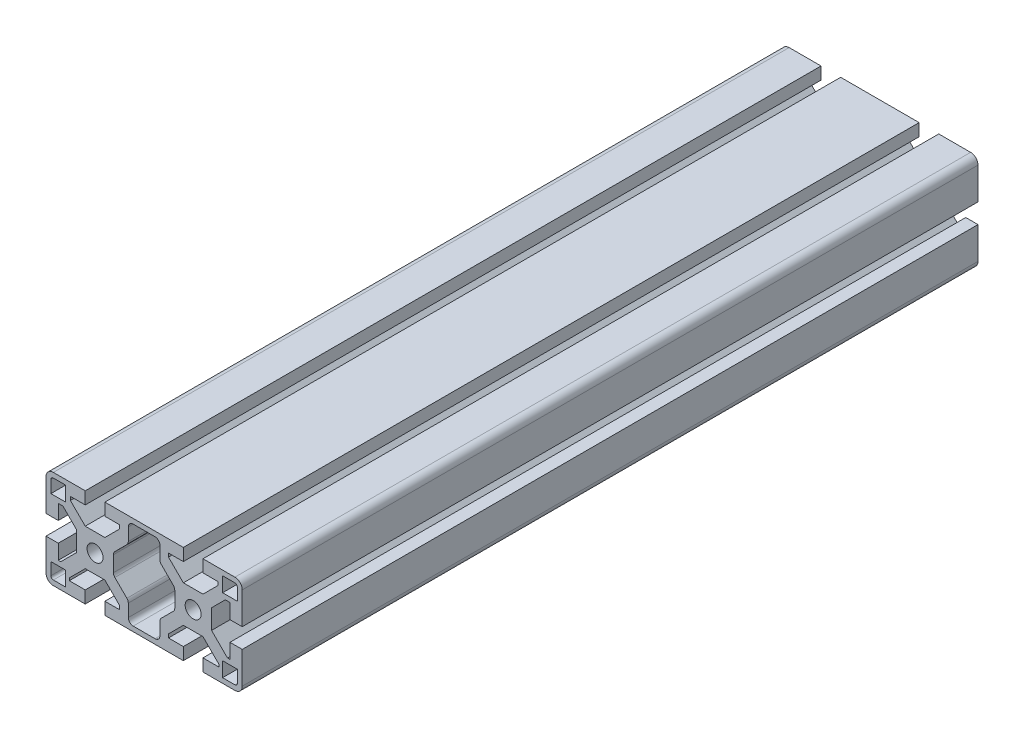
ISO-10303-21;
HEADER;
FILE_DESCRIPTION(('STEP AP214'),'2;1');
FILE_NAME('part.step','',(''),(''),'','','');
FILE_SCHEMA(('AUTOMOTIVE_DESIGN { 1 0 10303 214 1 1 1 1 }'));
ENDSEC;
DATA;
#1=APPLICATION_CONTEXT('core data for automotive mechanical design processes');
#2=APPLICATION_PROTOCOL_DEFINITION('international standard','automotive_design',2000,#1);
#3=PRODUCT_CONTEXT('',#1,'mechanical');
#4=PRODUCT('Part','Part','',(#3));
#5=PRODUCT_RELATED_PRODUCT_CATEGORY('part','',(#4));
#6=PRODUCT_DEFINITION_FORMATION('','',#4);
#7=PRODUCT_DEFINITION_CONTEXT('part definition',#1,'design');
#8=PRODUCT_DEFINITION('design','',#6,#7);
#9=PRODUCT_DEFINITION_SHAPE('','',#8);
#10=(LENGTH_UNIT() NAMED_UNIT(*) SI_UNIT(.MILLI.,.METRE.));
#11=(NAMED_UNIT(*) PLANE_ANGLE_UNIT() SI_UNIT($,.RADIAN.));
#12=(NAMED_UNIT(*) SI_UNIT($,.STERADIAN.) SOLID_ANGLE_UNIT());
#13=UNCERTAINTY_MEASURE_WITH_UNIT(LENGTH_MEASURE(1.E-05),#10,'distance_accuracy_value','');
#14=(GEOMETRIC_REPRESENTATION_CONTEXT(3) GLOBAL_UNCERTAINTY_ASSIGNED_CONTEXT((#13)) GLOBAL_UNIT_ASSIGNED_CONTEXT((#10,
#11,#12)) REPRESENTATION_CONTEXT('',''));
#15=CARTESIAN_POINT('',(0.,0.,0.));
#16=DIRECTION('',(0.,0.,1.));
#17=DIRECTION('',(1.,0.,0.));
#18=AXIS2_PLACEMENT_3D('',#15,#16,#17);
#19=CARTESIAN_POINT('',(57.,-17.,300.));
#20=DIRECTION('',(0.,0.,1.));
#21=DIRECTION('',(1.,0.,0.));
#22=AXIS2_PLACEMENT_3D('',#19,#20,#21);
#23=PLANE('',#22);
#24=DIRECTION('',(0.,-1.,0.));
#25=VECTOR('',#24,1.);
#26=CARTESIAN_POINT('',(13.5499999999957,10.8784271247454,300.));
#27=LINE('',#26,#25);
#28=CARTESIAN_POINT('',(13.5499999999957,16.,300.));
#29=VERTEX_POINT('',#28);
#30=CARTESIAN_POINT('',(13.5499999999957,10.8784271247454,300.));
#31=VERTEX_POINT('',#30);
#32=EDGE_CURVE('E727',#29,#31,#27,.T.);
#33=ORIENTED_EDGE('',*,*,#32,.F.);
#34=CARTESIAN_POINT('',(15.5499999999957,16.,300.));
#35=DIRECTION('',(0.,0.,1.));
#36=DIRECTION('',(-1.,0.,0.));
#37=AXIS2_PLACEMENT_3D('',#34,#35,#36);
#38=CIRCLE('',#37,2.);
#39=CARTESIAN_POINT('',(15.5499999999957,18.,300.));
#40=VERTEX_POINT('',#39);
#41=EDGE_CURVE('E719',#40,#29,#38,.T.);
#42=ORIENTED_EDGE('',*,*,#41,.F.);
#43=DIRECTION('',(-1.,0.,0.));
#44=VECTOR('',#43,1.);
#45=CARTESIAN_POINT('',(24.4500000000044,18.,300.));
#46=LINE('',#45,#44);
#47=CARTESIAN_POINT('',(24.4500000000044,18.,300.));
#48=VERTEX_POINT('',#47);
#49=EDGE_CURVE('E786',#48,#40,#46,.T.);
#50=ORIENTED_EDGE('',*,*,#49,.F.);
#51=CARTESIAN_POINT('',(24.4500000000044,16.,300.));
#52=DIRECTION('',(0.,0.,1.));
#53=DIRECTION('',(1.,0.,0.));
#54=AXIS2_PLACEMENT_3D('',#51,#52,#53);
#55=CIRCLE('',#54,2.);
#56=CARTESIAN_POINT('',(26.4500000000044,16.,300.));
#57=VERTEX_POINT('',#56);
#58=EDGE_CURVE('E784',#57,#48,#55,.T.);
#59=ORIENTED_EDGE('',*,*,#58,.F.);
#60=DIRECTION('',(0.,1.,0.));
#61=VECTOR('',#60,1.);
#62=CARTESIAN_POINT('',(26.4500000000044,10.8784271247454,300.));
#63=LINE('',#62,#61);
#64=CARTESIAN_POINT('',(26.4500000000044,10.8784271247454,300.));
#65=VERTEX_POINT('',#64);
#66=EDGE_CURVE('E782',#65,#57,#63,.T.);
#67=ORIENTED_EDGE('',*,*,#66,.F.);
#68=CARTESIAN_POINT('',(28.4500000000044,10.8784271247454,300.));
#69=DIRECTION('',(0.,0.,-1.));
#70=DIRECTION('',(1.,0.,0.));
#71=AXIS2_PLACEMENT_3D('',#68,#69,#70);
#72=CIRCLE('',#71,2.);
#73=CARTESIAN_POINT('',(27.0357864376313,9.46421356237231,300.));
#74=VERTEX_POINT('',#73);
#75=EDGE_CURVE('E780',#74,#65,#72,.T.);
#76=ORIENTED_EDGE('',*,*,#75,.F.);
#77=DIRECTION('',(-0.707106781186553,0.707106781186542,0.));
#78=VECTOR('',#77,1.);
#79=CARTESIAN_POINT('',(31.914213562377,4.58578643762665,300.));
#80=LINE('',#79,#78);
#81=CARTESIAN_POINT('',(31.914213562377,4.58578643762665,300.));
#82=VERTEX_POINT('',#81);
#83=EDGE_CURVE('E778',#82,#74,#80,.T.);
#84=ORIENTED_EDGE('',*,*,#83,.F.);
#85=CARTESIAN_POINT('',(30.500000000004,3.17157287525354,300.));
#86=DIRECTION('',(0.,0.,1.));
#87=DIRECTION('',(1.,0.,0.));
#88=AXIS2_PLACEMENT_3D('',#85,#86,#87);
#89=CIRCLE('',#88,2.);
#90=CARTESIAN_POINT('',(32.500000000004,3.17157287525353,300.));
#91=VERTEX_POINT('',#90);
#92=EDGE_CURVE('E776',#91,#82,#89,.T.);
#93=ORIENTED_EDGE('',*,*,#92,.F.);
#94=DIRECTION('',(0.,1.,0.));
#95=VECTOR('',#94,1.);
#96=CARTESIAN_POINT('',(32.500000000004,-3.17157287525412,300.));
#97=LINE('',#96,#95);
#98=CARTESIAN_POINT('',(32.500000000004,-3.17157287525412,300.));
#99=VERTEX_POINT('',#98);
#100=EDGE_CURVE('E774',#99,#91,#97,.T.);
#101=ORIENTED_EDGE('',*,*,#100,.F.);
#102=CARTESIAN_POINT('',(30.500000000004,-3.17157287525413,300.));
#103=DIRECTION('',(0.,0.,1.));
#104=DIRECTION('',(-1.,0.,0.));
#105=AXIS2_PLACEMENT_3D('',#102,#103,#104);
#106=CIRCLE('',#105,2.);
#107=CARTESIAN_POINT('',(31.9142135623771,-4.58578643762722,300.));
#108=VERTEX_POINT('',#107);
#109=EDGE_CURVE('E772',#108,#99,#106,.T.);
#110=ORIENTED_EDGE('',*,*,#109,.F.);
#111=DIRECTION('',(0.707106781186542,0.707106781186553,0.));
#112=VECTOR('',#111,1.);
#113=CARTESIAN_POINT('',(31.9142135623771,-4.58578643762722,300.));
#114=LINE('',#113,#112);
#115=CARTESIAN_POINT('',(27.0357864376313,-9.46421356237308,300.));
#116=VERTEX_POINT('',#115);
#117=EDGE_CURVE('E770',#116,#108,#114,.T.);
#118=ORIENTED_EDGE('',*,*,#117,.F.);
#119=CARTESIAN_POINT('',(28.4500000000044,-10.8784271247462,300.));
#120=DIRECTION('',(0.,0.,-1.));
#121=DIRECTION('',(-1.,0.,0.));
#122=AXIS2_PLACEMENT_3D('',#119,#120,#121);
#123=CIRCLE('',#122,2.);
#124=CARTESIAN_POINT('',(26.4500000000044,-10.8784271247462,300.));
#125=VERTEX_POINT('',#124);
#126=EDGE_CURVE('E768',#125,#116,#123,.T.);
#127=ORIENTED_EDGE('',*,*,#126,.F.);
#128=DIRECTION('',(0.,1.,0.));
#129=VECTOR('',#128,1.);
#130=CARTESIAN_POINT('',(26.4500000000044,-10.8784271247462,300.));
#131=LINE('',#130,#129);
#132=CARTESIAN_POINT('',(26.4500000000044,-16.,300.));
#133=VERTEX_POINT('',#132);
#134=EDGE_CURVE('E766',#133,#125,#131,.T.);
#135=ORIENTED_EDGE('',*,*,#134,.F.);
#136=CARTESIAN_POINT('',(24.4500000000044,-16.,300.));
#137=DIRECTION('',(0.,0.,1.));
#138=DIRECTION('',(-1.,0.,0.));
#139=AXIS2_PLACEMENT_3D('',#136,#137,#138);
#140=CIRCLE('',#139,2.);
#141=CARTESIAN_POINT('',(24.4500000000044,-18.,300.));
#142=VERTEX_POINT('',#141);
#143=EDGE_CURVE('E764',#142,#133,#140,.T.);
#144=ORIENTED_EDGE('',*,*,#143,.F.);
#145=DIRECTION('',(1.,0.,0.));
#146=VECTOR('',#145,1.);
#147=CARTESIAN_POINT('',(24.4500000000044,-18.,300.));
#148=LINE('',#147,#146);
#149=CARTESIAN_POINT('',(15.5499999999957,-18.,300.));
#150=VERTEX_POINT('',#149);
#151=EDGE_CURVE('E762',#150,#142,#148,.T.);
#152=ORIENTED_EDGE('',*,*,#151,.F.);
#153=CARTESIAN_POINT('',(15.5499999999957,-16.,300.));
#154=DIRECTION('',(0.,0.,1.));
#155=DIRECTION('',(-1.,0.,0.));
#156=AXIS2_PLACEMENT_3D('',#153,#154,#155);
#157=CIRCLE('',#156,2.);
#158=CARTESIAN_POINT('',(13.5499999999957,-16.,300.));
#159=VERTEX_POINT('',#158);
#160=EDGE_CURVE('E760',#159,#150,#157,.T.);
#161=ORIENTED_EDGE('',*,*,#160,.F.);
#162=DIRECTION('',(0.,-1.,0.));
#163=VECTOR('',#162,1.);
#164=CARTESIAN_POINT('',(13.5499999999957,-10.8784271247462,300.));
#165=LINE('',#164,#163);
#166=CARTESIAN_POINT('',(13.5499999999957,-10.8784271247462,300.));
#167=VERTEX_POINT('',#166);
#168=EDGE_CURVE('E758',#167,#159,#165,.T.);
#169=ORIENTED_EDGE('',*,*,#168,.F.);
#170=CARTESIAN_POINT('',(11.5499999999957,-10.8784271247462,300.));
#171=DIRECTION('',(0.,0.,-1.));
#172=DIRECTION('',(1.,0.,0.));
#173=AXIS2_PLACEMENT_3D('',#170,#171,#172);
#174=CIRCLE('',#173,2.);
#175=CARTESIAN_POINT('',(12.9642135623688,-9.4642135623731,300.));
#176=VERTEX_POINT('',#175);
#177=EDGE_CURVE('E756',#176,#167,#174,.T.);
#178=ORIENTED_EDGE('',*,*,#177,.F.);
#179=DIRECTION('',(0.707106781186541,-0.707106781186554,0.));
#180=VECTOR('',#179,1.);
#181=CARTESIAN_POINT('',(8.085786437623,-4.58578643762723,300.));
#182=LINE('',#181,#180);
#183=CARTESIAN_POINT('',(8.085786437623,-4.58578643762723,300.));
#184=VERTEX_POINT('',#183);
#185=EDGE_CURVE('E754',#184,#176,#182,.T.);
#186=ORIENTED_EDGE('',*,*,#185,.F.);
#187=CARTESIAN_POINT('',(9.4999999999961,-3.17157287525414,300.));
#188=DIRECTION('',(0.,0.,1.));
#189=DIRECTION('',(-1.,0.,0.));
#190=AXIS2_PLACEMENT_3D('',#187,#188,#189);
#191=CIRCLE('',#190,2.);
#192=CARTESIAN_POINT('',(7.49999999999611,-3.17157287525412,300.));
#193=VERTEX_POINT('',#192);
#194=EDGE_CURVE('E752',#193,#184,#191,.T.);
#195=ORIENTED_EDGE('',*,*,#194,.F.);
#196=DIRECTION('',(0.,-1.,0.));
#197=VECTOR('',#196,1.);
#198=CARTESIAN_POINT('',(7.49999999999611,-3.17157287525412,300.));
#199=LINE('',#198,#197);
#200=CARTESIAN_POINT('',(7.49999999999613,3.17157287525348,300.));
#201=VERTEX_POINT('',#200);
#202=EDGE_CURVE('E750',#201,#193,#199,.T.);
#203=ORIENTED_EDGE('',*,*,#202,.F.);
#204=CARTESIAN_POINT('',(9.4999999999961,3.17157287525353,300.));
#205=DIRECTION('',(0.,0.,1.));
#206=DIRECTION('',(-1.,0.,0.));
#207=AXIS2_PLACEMENT_3D('',#204,#205,#206);
#208=CIRCLE('',#207,1.99999999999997);
#209=CARTESIAN_POINT('',(8.08578643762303,4.58578643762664,300.));
#210=VERTEX_POINT('',#209);
#211=EDGE_CURVE('E748',#210,#201,#208,.T.);
#212=ORIENTED_EDGE('',*,*,#211,.F.);
#213=DIRECTION('',(-0.707106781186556,-0.707106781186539,0.));
#214=VECTOR('',#213,1.);
#215=CARTESIAN_POINT('',(8.08578643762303,4.58578643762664,300.));
#216=LINE('',#215,#214);
#217=CARTESIAN_POINT('',(12.9642135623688,9.46421356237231,300.));
#218=VERTEX_POINT('',#217);
#219=EDGE_CURVE('E743',#218,#210,#216,.T.);
#220=ORIENTED_EDGE('',*,*,#219,.F.);
#221=CARTESIAN_POINT('',(11.5499999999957,10.8784271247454,300.));
#222=DIRECTION('',(0.,0.,-1.));
#223=DIRECTION('',(1.,0.,0.));
#224=AXIS2_PLACEMENT_3D('',#221,#222,#223);
#225=CIRCLE('',#224,2.00000000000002);
#226=EDGE_CURVE('E741',#31,#218,#225,.T.);
#227=ORIENTED_EDGE('',*,*,#226,.F.);
#228=EDGE_LOOP('',(#33,#42,#50,#59,#67,#76,#84,#93,#101,#110,#118,#127,#135,#144,#152,#161,#169,
#178,#186,#195,#203,#212,#220,#227));
#229=FACE_BOUND('',#228,.T.);
#230=DIRECTION('',(0.,1.,0.));
#231=VECTOR('',#230,1.);
#232=CARTESIAN_POINT('',(58.,-17.,300.));
#233=LINE('',#232,#231);
#234=CARTESIAN_POINT('',(58.,-17.,300.));
#235=VERTEX_POINT('',#234);
#236=CARTESIAN_POINT('',(58.,-12.,300.));
#237=VERTEX_POINT('',#236);
#238=EDGE_CURVE('E939',#235,#237,#233,.T.);
#239=ORIENTED_EDGE('',*,*,#238,.F.);
#240=CARTESIAN_POINT('',(57.,-17.,300.));
#241=DIRECTION('',(0.,0.,1.));
#242=DIRECTION('',(-1.,0.,0.));
#243=AXIS2_PLACEMENT_3D('',#240,#241,#242);
#244=CIRCLE('',#243,0.999999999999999);
#245=CARTESIAN_POINT('',(57.,-18.,300.));
#246=VERTEX_POINT('',#245);
#247=EDGE_CURVE('E937',#246,#235,#244,.T.);
#248=ORIENTED_EDGE('',*,*,#247,.F.);
#249=DIRECTION('',(1.,0.,0.));
#250=VECTOR('',#249,1.);
#251=CARTESIAN_POINT('',(57.,-18.,300.));
#252=LINE('',#251,#250);
#253=CARTESIAN_POINT('',(52.0000000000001,-18.,300.));
#254=VERTEX_POINT('',#253);
#255=EDGE_CURVE('E947',#254,#246,#252,.T.);
#256=ORIENTED_EDGE('',*,*,#255,.F.);
#257=DIRECTION('',(0.,-1.,0.));
#258=VECTOR('',#257,1.);
#259=CARTESIAN_POINT('',(52.0000000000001,-18.,300.));
#260=LINE('',#259,#258);
#261=CARTESIAN_POINT('',(52.0000000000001,-12.,300.));
#262=VERTEX_POINT('',#261);
#263=EDGE_CURVE('E944',#262,#254,#260,.T.);
#264=ORIENTED_EDGE('',*,*,#263,.F.);
#265=DIRECTION('',(-1.,0.,0.));
#266=VECTOR('',#265,1.);
#267=CARTESIAN_POINT('',(58.,-12.,300.));
#268=LINE('',#267,#266);
#269=EDGE_CURVE('E942',#237,#262,#268,.T.);
#270=ORIENTED_EDGE('',*,*,#269,.F.);
#271=EDGE_LOOP('',(#239,#248,#256,#264,#270));
#272=FACE_BOUND('',#271,.T.);
#273=DIRECTION('',(-1.,0.,0.));
#274=VECTOR('',#273,1.);
#275=CARTESIAN_POINT('',(-18.,-12.,300.));
#276=LINE('',#275,#274);
#277=CARTESIAN_POINT('',(-12.,-12.,300.));
#278=VERTEX_POINT('',#277);
#279=CARTESIAN_POINT('',(-18.,-12.,300.));
#280=VERTEX_POINT('',#279);
#281=EDGE_CURVE('E983',#278,#280,#276,.T.);
#282=ORIENTED_EDGE('',*,*,#281,.F.);
#283=DIRECTION('',(0.,1.,0.));
#284=VECTOR('',#283,1.);
#285=CARTESIAN_POINT('',(-12.,-18.,300.));
#286=LINE('',#285,#284);
#287=CARTESIAN_POINT('',(-12.,-18.,300.));
#288=VERTEX_POINT('',#287);
#289=EDGE_CURVE('E981',#288,#278,#286,.T.);
#290=ORIENTED_EDGE('',*,*,#289,.F.);
#291=DIRECTION('',(1.,0.,0.));
#292=VECTOR('',#291,1.);
#293=CARTESIAN_POINT('',(-17.,-18.,300.));
#294=LINE('',#293,#292);
#295=CARTESIAN_POINT('',(-17.,-18.,300.));
#296=VERTEX_POINT('',#295);
#297=EDGE_CURVE('E991',#296,#288,#294,.T.);
#298=ORIENTED_EDGE('',*,*,#297,.F.);
#299=CARTESIAN_POINT('',(-17.,-17.,300.));
#300=DIRECTION('',(0.,0.,1.));
#301=DIRECTION('',(1.,0.,0.));
#302=AXIS2_PLACEMENT_3D('',#299,#300,#301);
#303=CIRCLE('',#302,1.);
#304=CARTESIAN_POINT('',(-18.,-17.,300.));
#305=VERTEX_POINT('',#304);
#306=EDGE_CURVE('E988',#305,#296,#303,.T.);
#307=ORIENTED_EDGE('',*,*,#306,.F.);
#308=DIRECTION('',(0.,-1.,0.));
#309=VECTOR('',#308,1.);
#310=CARTESIAN_POINT('',(-18.,-17.,300.));
#311=LINE('',#310,#309);
#312=EDGE_CURVE('E986',#280,#305,#311,.T.);
#313=ORIENTED_EDGE('',*,*,#312,.F.);
#314=EDGE_LOOP('',(#282,#290,#298,#307,#313));
#315=FACE_BOUND('',#314,.T.);
#316=CARTESIAN_POINT('',(57.,-17.,300.));
#317=DIRECTION('',(0.,0.,1.));
#318=DIRECTION('',(1.,0.,0.));
#319=AXIS2_PLACEMENT_3D('',#316,#317,#318);
#320=CIRCLE('',#319,3.);
#321=CARTESIAN_POINT('',(57.,-20.,300.));
#322=VERTEX_POINT('',#321);
#323=CARTESIAN_POINT('',(60.0000000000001,-17.,300.));
#324=VERTEX_POINT('',#323);
#325=EDGE_CURVE('E1057',#322,#324,#320,.T.);
#326=ORIENTED_EDGE('',*,*,#325,.T.);
#327=DIRECTION('',(0.,1.,0.));
#328=VECTOR('',#327,1.);
#329=CARTESIAN_POINT('',(60.0000000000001,-17.,300.));
#330=LINE('',#329,#328);
#331=CARTESIAN_POINT('',(60.0000000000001,-4.00000000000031,300.));
#332=VERTEX_POINT('',#331);
#333=EDGE_CURVE('E1060',#324,#332,#330,.T.);
#334=ORIENTED_EDGE('',*,*,#333,.T.);
#335=DIRECTION('',(-1.,0.,0.));
#336=VECTOR('',#335,1.);
#337=CARTESIAN_POINT('',(60.0000000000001,-4.00000000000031,300.));
#338=LINE('',#337,#336);
#339=CARTESIAN_POINT('',(55.0000000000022,-4.00000000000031,300.));
#340=VERTEX_POINT('',#339);
#341=EDGE_CURVE('E1063',#332,#340,#338,.T.);
#342=ORIENTED_EDGE('',*,*,#341,.T.);
#343=DIRECTION('',(0.,-1.,0.));
#344=VECTOR('',#343,1.);
#345=CARTESIAN_POINT('',(55.0000000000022,-10.05,300.));
#346=LINE('',#345,#344);
#347=CARTESIAN_POINT('',(55.0000000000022,-10.05,300.));
#348=VERTEX_POINT('',#347);
#349=EDGE_CURVE('E1065',#340,#348,#346,.T.);
#350=ORIENTED_EDGE('',*,*,#349,.T.);
#351=DIRECTION('',(-1.,0.,0.));
#352=VECTOR('',#351,1.);
#353=CARTESIAN_POINT('',(55.0000000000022,-10.05,300.));
#354=LINE('',#353,#352);
#355=CARTESIAN_POINT('',(53.9999999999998,-10.05,300.));
#356=VERTEX_POINT('',#355);
#357=EDGE_CURVE('E1067',#348,#356,#354,.T.);
#358=ORIENTED_EDGE('',*,*,#357,.T.);
#359=DIRECTION('',(-0.70710678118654,0.707106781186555,0.));
#360=VECTOR('',#359,1.);
#361=CARTESIAN_POINT('',(47.5,-3.55000000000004,300.));
#362=LINE('',#361,#360);
#363=CARTESIAN_POINT('',(47.5,-3.55000000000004,300.));
#364=VERTEX_POINT('',#363);
#365=EDGE_CURVE('E1069',#356,#364,#362,.T.);
#366=ORIENTED_EDGE('',*,*,#365,.T.);
#367=DIRECTION('',(0.,1.,0.));
#368=VECTOR('',#367,1.);
#369=CARTESIAN_POINT('',(47.5,-3.55000000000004,300.));
#370=LINE('',#369,#368);
#371=CARTESIAN_POINT('',(47.5,4.44999999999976,300.));
#372=VERTEX_POINT('',#371);
#373=EDGE_CURVE('E1071',#364,#372,#370,.T.);
#374=ORIENTED_EDGE('',*,*,#373,.T.);
#375=DIRECTION('',(0.707106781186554,0.707106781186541,0.));
#376=VECTOR('',#375,1.);
#377=CARTESIAN_POINT('',(47.5,4.44999999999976,300.));
#378=LINE('',#377,#376);
#379=CARTESIAN_POINT('',(53.0999999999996,10.0499999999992,300.));
#380=VERTEX_POINT('',#379);
#381=EDGE_CURVE('E1073',#372,#380,#378,.T.);
#382=ORIENTED_EDGE('',*,*,#381,.T.);
#383=DIRECTION('',(1.,0.,0.));
#384=VECTOR('',#383,1.);
#385=CARTESIAN_POINT('',(55.0000000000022,10.0499999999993,300.));
#386=LINE('',#385,#384);
#387=CARTESIAN_POINT('',(55.0000000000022,10.0499999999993,300.));
#388=VERTEX_POINT('',#387);
#389=EDGE_CURVE('E1075',#380,#388,#386,.T.);
#390=ORIENTED_EDGE('',*,*,#389,.T.);
#391=DIRECTION('',(0.,-1.,0.));
#392=VECTOR('',#391,1.);
#393=CARTESIAN_POINT('',(55.0000000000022,3.99999999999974,300.));
#394=LINE('',#393,#392);
#395=CARTESIAN_POINT('',(55.0000000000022,3.99999999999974,300.));
#396=VERTEX_POINT('',#395);
#397=EDGE_CURVE('E1077',#388,#396,#394,.T.);
#398=ORIENTED_EDGE('',*,*,#397,.T.);
#399=DIRECTION('',(1.,0.,0.));
#400=VECTOR('',#399,1.);
#401=CARTESIAN_POINT('',(60.0000000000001,3.99999999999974,300.));
#402=LINE('',#401,#400);
#403=CARTESIAN_POINT('',(60.0000000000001,3.99999999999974,300.));
#404=VERTEX_POINT('',#403);
#405=EDGE_CURVE('E1079',#396,#404,#402,.T.);
#406=ORIENTED_EDGE('',*,*,#405,.T.);
#407=DIRECTION('',(0.,1.,0.));
#408=VECTOR('',#407,1.);
#409=CARTESIAN_POINT('',(60.0000000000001,3.99999999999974,300.));
#410=LINE('',#409,#408);
#411=CARTESIAN_POINT('',(60.0000000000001,17.,300.));
#412=VERTEX_POINT('',#411);
#413=EDGE_CURVE('E1081',#404,#412,#410,.T.);
#414=ORIENTED_EDGE('',*,*,#413,.T.);
#415=CARTESIAN_POINT('',(57.,17.,300.));
#416=DIRECTION('',(0.,0.,1.));
#417=DIRECTION('',(1.,0.,0.));
#418=AXIS2_PLACEMENT_3D('',#415,#416,#417);
#419=CIRCLE('',#418,3.);
#420=CARTESIAN_POINT('',(57.,20.,300.));
#421=VERTEX_POINT('',#420);
#422=EDGE_CURVE('E1083',#412,#421,#419,.T.);
#423=ORIENTED_EDGE('',*,*,#422,.T.);
#424=DIRECTION('',(-1.,0.,0.));
#425=VECTOR('',#424,1.);
#426=CARTESIAN_POINT('',(57.,20.,300.));
#427=LINE('',#426,#425);
#428=CARTESIAN_POINT('',(44.,20.,300.));
#429=VERTEX_POINT('',#428);
#430=EDGE_CURVE('E1085',#421,#429,#427,.T.);
#431=ORIENTED_EDGE('',*,*,#430,.T.);
#432=DIRECTION('',(0.,-1.,0.));
#433=VECTOR('',#432,1.);
#434=CARTESIAN_POINT('',(44.,20.,300.));
#435=LINE('',#434,#433);
#436=CARTESIAN_POINT('',(44.,15.,300.));
#437=VERTEX_POINT('',#436);
#438=EDGE_CURVE('E1087',#429,#437,#435,.T.);
#439=ORIENTED_EDGE('',*,*,#438,.T.);
#440=DIRECTION('',(1.,0.,0.));
#441=VECTOR('',#440,1.);
#442=CARTESIAN_POINT('',(50.0628752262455,15.,300.));
#443=LINE('',#442,#441);
#444=CARTESIAN_POINT('',(50.0628752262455,15.,300.));
#445=VERTEX_POINT('',#444);
#446=EDGE_CURVE('E1089',#437,#445,#443,.T.);
#447=ORIENTED_EDGE('',*,*,#446,.T.);
#448=DIRECTION('',(0.,-1.,0.));
#449=VECTOR('',#448,1.);
#450=CARTESIAN_POINT('',(50.0628752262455,13.5499999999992,300.));
#451=LINE('',#450,#449);
#452=CARTESIAN_POINT('',(50.0628752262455,13.5499999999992,300.));
#453=VERTEX_POINT('',#452);
#454=EDGE_CURVE('E1091',#445,#453,#451,.T.);
#455=ORIENTED_EDGE('',*,*,#454,.T.);
#456=DIRECTION('',(-0.707857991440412,-0.706354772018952,0.));
#457=VECTOR('',#456,1.);
#458=CARTESIAN_POINT('',(50.0628752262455,13.5499999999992,300.));
#459=LINE('',#458,#457);
#460=CARTESIAN_POINT('',(44.,7.50000000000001,300.));
#461=VERTEX_POINT('',#460);
#462=EDGE_CURVE('E1093',#453,#461,#459,.T.);
#463=ORIENTED_EDGE('',*,*,#462,.T.);
#464=DIRECTION('',(-1.,0.,0.));
#465=VECTOR('',#464,1.);
#466=CARTESIAN_POINT('',(44.,7.50000000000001,300.));
#467=LINE('',#466,#465);
#468=CARTESIAN_POINT('',(36.,7.50000000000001,300.));
#469=VERTEX_POINT('',#468);
#470=EDGE_CURVE('E1095',#461,#469,#467,.T.);
#471=ORIENTED_EDGE('',*,*,#470,.T.);
#472=DIRECTION('',(-0.707106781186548,0.707106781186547,0.));
#473=VECTOR('',#472,1.);
#474=CARTESIAN_POINT('',(36.,7.50000000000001,300.));
#475=LINE('',#474,#473);
#476=CARTESIAN_POINT('',(29.9500000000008,13.5499999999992,300.));
#477=VERTEX_POINT('',#476);
#478=EDGE_CURVE('E1097',#469,#477,#475,.T.);
#479=ORIENTED_EDGE('',*,*,#478,.T.);
#480=DIRECTION('',(0.,1.,0.));
#481=VECTOR('',#480,1.);
#482=CARTESIAN_POINT('',(29.9500000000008,13.5499999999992,300.));
#483=LINE('',#482,#481);
#484=CARTESIAN_POINT('',(29.9500000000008,15.,300.));
#485=VERTEX_POINT('',#484);
#486=EDGE_CURVE('E1099',#477,#485,#483,.T.);
#487=ORIENTED_EDGE('',*,*,#486,.T.);
#488=DIRECTION('',(1.,0.,0.));
#489=VECTOR('',#488,1.);
#490=CARTESIAN_POINT('',(36.,15.,300.));
#491=LINE('',#490,#489);
#492=CARTESIAN_POINT('',(36.,15.,300.));
#493=VERTEX_POINT('',#492);
#494=EDGE_CURVE('E1101',#485,#493,#491,.T.);
#495=ORIENTED_EDGE('',*,*,#494,.T.);
#496=DIRECTION('',(0.,1.,0.));
#497=VECTOR('',#496,1.);
#498=CARTESIAN_POINT('',(36.,20.,300.));
#499=LINE('',#498,#497);
#500=CARTESIAN_POINT('',(36.,20.,300.));
#501=VERTEX_POINT('',#500);
#502=EDGE_CURVE('E1103',#493,#501,#499,.T.);
#503=ORIENTED_EDGE('',*,*,#502,.T.);
#504=DIRECTION('',(-1.,0.,0.));
#505=VECTOR('',#504,1.);
#506=CARTESIAN_POINT('',(4.00000000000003,20.,300.));
#507=LINE('',#506,#505);
#508=CARTESIAN_POINT('',(4.00000000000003,20.,300.));
#509=VERTEX_POINT('',#508);
#510=EDGE_CURVE('E1105',#501,#509,#507,.T.);
#511=ORIENTED_EDGE('',*,*,#510,.T.);
#512=DIRECTION('',(0.,-1.,0.));
#513=VECTOR('',#512,1.);
#514=CARTESIAN_POINT('',(4.00000000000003,20.,300.));
#515=LINE('',#514,#513);
#516=CARTESIAN_POINT('',(4.00000000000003,15.,300.));
#517=VERTEX_POINT('',#516);
#518=EDGE_CURVE('E1107',#509,#517,#515,.T.);
#519=ORIENTED_EDGE('',*,*,#518,.T.);
#520=DIRECTION('',(1.,0.,0.));
#521=VECTOR('',#520,1.);
#522=CARTESIAN_POINT('',(4.00000000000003,15.,300.));
#523=LINE('',#522,#521);
#524=CARTESIAN_POINT('',(10.0499999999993,15.,300.));
#525=VERTEX_POINT('',#524);
#526=EDGE_CURVE('E1109',#517,#525,#523,.T.);
#527=ORIENTED_EDGE('',*,*,#526,.T.);
#528=DIRECTION('',(0.,-1.,0.));
#529=VECTOR('',#528,1.);
#530=CARTESIAN_POINT('',(10.0499999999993,13.5499999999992,300.));
#531=LINE('',#530,#529);
#532=CARTESIAN_POINT('',(10.0499999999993,13.5499999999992,300.));
#533=VERTEX_POINT('',#532);
#534=EDGE_CURVE('E1111',#525,#533,#531,.T.);
#535=ORIENTED_EDGE('',*,*,#534,.T.);
#536=DIRECTION('',(-0.707106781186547,-0.707106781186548,0.));
#537=VECTOR('',#536,1.);
#538=CARTESIAN_POINT('',(4.00000000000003,7.5,300.));
#539=LINE('',#538,#537);
#540=CARTESIAN_POINT('',(4.00000000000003,7.5,300.));
#541=VERTEX_POINT('',#540);
#542=EDGE_CURVE('E1113',#533,#541,#539,.T.);
#543=ORIENTED_EDGE('',*,*,#542,.T.);
#544=DIRECTION('',(-1.,0.,0.));
#545=VECTOR('',#544,1.);
#546=CARTESIAN_POINT('',(-3.99999999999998,7.5,300.));
#547=LINE('',#546,#545);
#548=CARTESIAN_POINT('',(-3.99999999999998,7.5,300.));
#549=VERTEX_POINT('',#548);
#550=EDGE_CURVE('E1115',#541,#549,#547,.T.);
#551=ORIENTED_EDGE('',*,*,#550,.T.);
#552=DIRECTION('',(-0.707857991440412,0.706354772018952,0.));
#553=VECTOR('',#552,1.);
#554=CARTESIAN_POINT('',(-10.0628752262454,13.5499999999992,300.));
#555=LINE('',#554,#553);
#556=CARTESIAN_POINT('',(-10.0628752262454,13.5499999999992,300.));
#557=VERTEX_POINT('',#556);
#558=EDGE_CURVE('E1117',#549,#557,#555,.T.);
#559=ORIENTED_EDGE('',*,*,#558,.T.);
#560=DIRECTION('',(0.,1.,0.));
#561=VECTOR('',#560,1.);
#562=CARTESIAN_POINT('',(-10.0628752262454,13.5499999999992,300.));
#563=LINE('',#562,#561);
#564=CARTESIAN_POINT('',(-10.0628752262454,15.,300.));
#565=VERTEX_POINT('',#564);
#566=EDGE_CURVE('E1119',#557,#565,#563,.T.);
#567=ORIENTED_EDGE('',*,*,#566,.T.);
#568=DIRECTION('',(1.,0.,0.));
#569=VECTOR('',#568,1.);
#570=CARTESIAN_POINT('',(-10.0628752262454,15.,300.));
#571=LINE('',#570,#569);
#572=CARTESIAN_POINT('',(-3.99999999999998,15.,300.));
#573=VERTEX_POINT('',#572);
#574=EDGE_CURVE('E1121',#565,#573,#571,.T.);
#575=ORIENTED_EDGE('',*,*,#574,.T.);
#576=DIRECTION('',(0.,1.,0.));
#577=VECTOR('',#576,1.);
#578=CARTESIAN_POINT('',(-3.99999999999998,20.,300.));
#579=LINE('',#578,#577);
#580=CARTESIAN_POINT('',(-3.99999999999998,20.,300.));
#581=VERTEX_POINT('',#580);
#582=EDGE_CURVE('E1123',#573,#581,#579,.T.);
#583=ORIENTED_EDGE('',*,*,#582,.T.);
#584=DIRECTION('',(-1.,0.,0.));
#585=VECTOR('',#584,1.);
#586=CARTESIAN_POINT('',(-17.,20.,300.));
#587=LINE('',#586,#585);
#588=CARTESIAN_POINT('',(-17.,20.,300.));
#589=VERTEX_POINT('',#588);
#590=EDGE_CURVE('E1125',#581,#589,#587,.T.);
#591=ORIENTED_EDGE('',*,*,#590,.T.);
#592=CARTESIAN_POINT('',(-17.,17.,300.));
#593=DIRECTION('',(0.,0.,1.));
#594=DIRECTION('',(-1.,0.,0.));
#595=AXIS2_PLACEMENT_3D('',#592,#593,#594);
#596=CIRCLE('',#595,3.);
#597=CARTESIAN_POINT('',(-20.,17.,300.));
#598=VERTEX_POINT('',#597);
#599=EDGE_CURVE('E1127',#589,#598,#596,.T.);
#600=ORIENTED_EDGE('',*,*,#599,.T.);
#601=DIRECTION('',(0.,-1.,0.));
#602=VECTOR('',#601,1.);
#603=CARTESIAN_POINT('',(-20.,3.99999999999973,300.));
#604=LINE('',#603,#602);
#605=CARTESIAN_POINT('',(-20.,3.99999999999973,300.));
#606=VERTEX_POINT('',#605);
#607=EDGE_CURVE('E1129',#598,#606,#604,.T.);
#608=ORIENTED_EDGE('',*,*,#607,.T.);
#609=DIRECTION('',(1.,0.,0.));
#610=VECTOR('',#609,1.);
#611=CARTESIAN_POINT('',(-20.,3.99999999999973,300.));
#612=LINE('',#611,#610);
#613=CARTESIAN_POINT('',(-15.0000000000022,3.99999999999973,300.));
#614=VERTEX_POINT('',#613);
#615=EDGE_CURVE('E1131',#606,#614,#612,.T.);
#616=ORIENTED_EDGE('',*,*,#615,.T.);
#617=DIRECTION('',(0.,1.,0.));
#618=VECTOR('',#617,1.);
#619=CARTESIAN_POINT('',(-15.0000000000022,3.99999999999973,300.));
#620=LINE('',#619,#618);
#621=CARTESIAN_POINT('',(-15.0000000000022,10.0499999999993,300.));
#622=VERTEX_POINT('',#621);
#623=EDGE_CURVE('E1133',#614,#622,#620,.T.);
#624=ORIENTED_EDGE('',*,*,#623,.T.);
#625=DIRECTION('',(1.,0.,0.));
#626=VECTOR('',#625,1.);
#627=CARTESIAN_POINT('',(-15.0000000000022,10.0499999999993,300.));
#628=LINE('',#627,#626);
#629=CARTESIAN_POINT('',(-13.0999999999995,10.0499999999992,300.));
#630=VERTEX_POINT('',#629);
#631=EDGE_CURVE('E1135',#622,#630,#628,.T.);
#632=ORIENTED_EDGE('',*,*,#631,.T.);
#633=DIRECTION('',(0.707106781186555,-0.70710678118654,0.));
#634=VECTOR('',#633,1.);
#635=CARTESIAN_POINT('',(-7.49999999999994,4.44999999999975,300.));
#636=LINE('',#635,#634);
#637=CARTESIAN_POINT('',(-7.49999999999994,4.44999999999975,300.));
#638=VERTEX_POINT('',#637);
#639=EDGE_CURVE('E1137',#630,#638,#636,.T.);
#640=ORIENTED_EDGE('',*,*,#639,.T.);
#641=DIRECTION('',(0.,-1.,0.));
#642=VECTOR('',#641,1.);
#643=CARTESIAN_POINT('',(-7.49999999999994,-3.55000000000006,300.));
#644=LINE('',#643,#642);
#645=CARTESIAN_POINT('',(-7.49999999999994,-3.55000000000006,300.));
#646=VERTEX_POINT('',#645);
#647=EDGE_CURVE('E1139',#638,#646,#644,.T.);
#648=ORIENTED_EDGE('',*,*,#647,.T.);
#649=DIRECTION('',(-0.70710678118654,-0.707106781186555,0.));
#650=VECTOR('',#649,1.);
#651=CARTESIAN_POINT('',(-7.49999999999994,-3.55000000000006,300.));
#652=LINE('',#651,#650);
#653=CARTESIAN_POINT('',(-13.9999999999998,-10.05,300.));
#654=VERTEX_POINT('',#653);
#655=EDGE_CURVE('E1141',#646,#654,#652,.T.);
#656=ORIENTED_EDGE('',*,*,#655,.T.);
#657=DIRECTION('',(-1.,0.,0.));
#658=VECTOR('',#657,1.);
#659=CARTESIAN_POINT('',(-15.0000000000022,-10.05,300.));
#660=LINE('',#659,#658);
#661=CARTESIAN_POINT('',(-15.0000000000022,-10.05,300.));
#662=VERTEX_POINT('',#661);
#663=EDGE_CURVE('E1143',#654,#662,#660,.T.);
#664=ORIENTED_EDGE('',*,*,#663,.T.);
#665=DIRECTION('',(0.,1.,0.));
#666=VECTOR('',#665,1.);
#667=CARTESIAN_POINT('',(-15.0000000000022,-10.05,300.));
#668=LINE('',#667,#666);
#669=CARTESIAN_POINT('',(-15.0000000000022,-4.00000000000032,300.));
#670=VERTEX_POINT('',#669);
#671=EDGE_CURVE('E1145',#662,#670,#668,.T.);
#672=ORIENTED_EDGE('',*,*,#671,.T.);
#673=DIRECTION('',(-1.,0.,0.));
#674=VECTOR('',#673,1.);
#675=CARTESIAN_POINT('',(-20.,-4.00000000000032,300.));
#676=LINE('',#675,#674);
#677=CARTESIAN_POINT('',(-20.,-4.00000000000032,300.));
#678=VERTEX_POINT('',#677);
#679=EDGE_CURVE('E1147',#670,#678,#676,.T.);
#680=ORIENTED_EDGE('',*,*,#679,.T.);
#681=DIRECTION('',(0.,-1.,0.));
#682=VECTOR('',#681,1.);
#683=CARTESIAN_POINT('',(-20.,-17.,300.));
#684=LINE('',#683,#682);
#685=CARTESIAN_POINT('',(-20.,-17.,300.));
#686=VERTEX_POINT('',#685);
#687=EDGE_CURVE('E1149',#678,#686,#684,.T.);
#688=ORIENTED_EDGE('',*,*,#687,.T.);
#689=CARTESIAN_POINT('',(-17.,-17.,300.));
#690=DIRECTION('',(0.,0.,1.));
#691=DIRECTION('',(-1.,0.,0.));
#692=AXIS2_PLACEMENT_3D('',#689,#690,#691);
#693=CIRCLE('',#692,3.);
#694=CARTESIAN_POINT('',(-17.,-20.,300.));
#695=VERTEX_POINT('',#694);
#696=EDGE_CURVE('E1151',#686,#695,#693,.T.);
#697=ORIENTED_EDGE('',*,*,#696,.T.);
#698=DIRECTION('',(1.,0.,0.));
#699=VECTOR('',#698,1.);
#700=CARTESIAN_POINT('',(-17.,-20.,300.));
#701=LINE('',#700,#699);
#702=CARTESIAN_POINT('',(-4.,-20.,300.));
#703=VERTEX_POINT('',#702);
#704=EDGE_CURVE('E1153',#695,#703,#701,.T.);
#705=ORIENTED_EDGE('',*,*,#704,.T.);
#706=DIRECTION('',(0.,1.,0.));
#707=VECTOR('',#706,1.);
#708=CARTESIAN_POINT('',(-4.,-20.,300.));
#709=LINE('',#708,#707);
#710=CARTESIAN_POINT('',(-3.99999999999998,-14.9999999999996,300.));
#711=VERTEX_POINT('',#710);
#712=EDGE_CURVE('E1155',#703,#711,#709,.T.);
#713=ORIENTED_EDGE('',*,*,#712,.T.);
#714=DIRECTION('',(-1.,0.,0.));
#715=VECTOR('',#714,1.);
#716=CARTESIAN_POINT('',(-10.4999999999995,-14.9999999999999,300.));
#717=LINE('',#716,#715);
#718=CARTESIAN_POINT('',(-10.4999999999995,-14.9999999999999,300.));
#719=VERTEX_POINT('',#718);
#720=EDGE_CURVE('E1157',#711,#719,#717,.T.);
#721=ORIENTED_EDGE('',*,*,#720,.T.);
#722=DIRECTION('',(0.,1.,0.));
#723=VECTOR('',#722,1.);
#724=CARTESIAN_POINT('',(-10.4999999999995,-13.9999999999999,300.));
#725=LINE('',#724,#723);
#726=CARTESIAN_POINT('',(-10.4999999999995,-13.9999999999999,300.));
#727=VERTEX_POINT('',#726);
#728=EDGE_CURVE('E1159',#719,#727,#725,.T.);
#729=ORIENTED_EDGE('',*,*,#728,.T.);
#730=DIRECTION('',(0.707106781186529,0.707106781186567,0.));
#731=VECTOR('',#730,1.);
#732=CARTESIAN_POINT('',(-10.4999999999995,-13.9999999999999,300.));
#733=LINE('',#732,#731);
#734=CARTESIAN_POINT('',(-4.,-7.5,300.));
#735=VERTEX_POINT('',#734);
#736=EDGE_CURVE('E1161',#727,#735,#733,.T.);
#737=ORIENTED_EDGE('',*,*,#736,.T.);
#738=DIRECTION('',(1.,0.,0.));
#739=VECTOR('',#738,1.);
#740=CARTESIAN_POINT('',(-4.,-7.5,300.));
#741=LINE('',#740,#739);
#742=CARTESIAN_POINT('',(4.,-7.5,300.));
#743=VERTEX_POINT('',#742);
#744=EDGE_CURVE('E1163',#735,#743,#741,.T.);
#745=ORIENTED_EDGE('',*,*,#744,.T.);
#746=DIRECTION('',(0.70710678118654,-0.707106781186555,0.));
#747=VECTOR('',#746,1.);
#748=CARTESIAN_POINT('',(4.,-7.5,300.));
#749=LINE('',#748,#747);
#750=CARTESIAN_POINT('',(10.0499999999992,-13.5499999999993,300.));
#751=VERTEX_POINT('',#750);
#752=EDGE_CURVE('E1165',#743,#751,#749,.T.);
#753=ORIENTED_EDGE('',*,*,#752,.T.);
#754=DIRECTION('',(0.,-1.,0.));
#755=VECTOR('',#754,1.);
#756=CARTESIAN_POINT('',(10.0499999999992,-14.9999999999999,300.));
#757=LINE('',#756,#755);
#758=CARTESIAN_POINT('',(10.0499999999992,-14.9999999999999,300.));
#759=VERTEX_POINT('',#758);
#760=EDGE_CURVE('E1167',#751,#759,#757,.T.);
#761=ORIENTED_EDGE('',*,*,#760,.T.);
#762=DIRECTION('',(-1.,0.,0.));
#763=VECTOR('',#762,1.);
#764=CARTESIAN_POINT('',(4.00000000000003,-14.9999999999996,300.));
#765=LINE('',#764,#763);
#766=CARTESIAN_POINT('',(4.00000000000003,-14.9999999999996,300.));
#767=VERTEX_POINT('',#766);
#768=EDGE_CURVE('E1169',#759,#767,#765,.T.);
#769=ORIENTED_EDGE('',*,*,#768,.T.);
#770=DIRECTION('',(0.,-1.,0.));
#771=VECTOR('',#770,1.);
#772=CARTESIAN_POINT('',(4.,-20.,300.));
#773=LINE('',#772,#771);
#774=CARTESIAN_POINT('',(4.,-20.,300.));
#775=VERTEX_POINT('',#774);
#776=EDGE_CURVE('E1171',#767,#775,#773,.T.);
#777=ORIENTED_EDGE('',*,*,#776,.T.);
#778=DIRECTION('',(1.,0.,0.));
#779=VECTOR('',#778,1.);
#780=CARTESIAN_POINT('',(36.0000000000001,-20.,300.));
#781=LINE('',#780,#779);
#782=CARTESIAN_POINT('',(36.0000000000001,-20.,300.));
#783=VERTEX_POINT('',#782);
#784=EDGE_CURVE('E1173',#775,#783,#781,.T.);
#785=ORIENTED_EDGE('',*,*,#784,.T.);
#786=DIRECTION('',(0.,1.,0.));
#787=VECTOR('',#786,1.);
#788=CARTESIAN_POINT('',(36.0000000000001,-20.,300.));
#789=LINE('',#788,#787);
#790=CARTESIAN_POINT('',(36.,-14.9999999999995,300.));
#791=VERTEX_POINT('',#790);
#792=EDGE_CURVE('E1175',#783,#791,#789,.T.);
#793=ORIENTED_EDGE('',*,*,#792,.T.);
#794=DIRECTION('',(-1.,0.,0.));
#795=VECTOR('',#794,1.);
#796=CARTESIAN_POINT('',(36.,-14.9999999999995,300.));
#797=LINE('',#796,#795);
#798=CARTESIAN_POINT('',(29.9500000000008,-15.,300.));
#799=VERTEX_POINT('',#798);
#800=EDGE_CURVE('E1177',#791,#799,#797,.T.);
#801=ORIENTED_EDGE('',*,*,#800,.T.);
#802=DIRECTION('',(0.,1.,0.));
#803=VECTOR('',#802,1.);
#804=CARTESIAN_POINT('',(29.9500000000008,-15.,300.));
#805=LINE('',#804,#803);
#806=CARTESIAN_POINT('',(29.9500000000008,-13.5499999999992,300.));
#807=VERTEX_POINT('',#806);
#808=EDGE_CURVE('E1179',#799,#807,#805,.T.);
#809=ORIENTED_EDGE('',*,*,#808,.T.);
#810=DIRECTION('',(0.70710678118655,0.707106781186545,0.));
#811=VECTOR('',#810,1.);
#812=CARTESIAN_POINT('',(36.0000000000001,-7.49999999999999,300.));
#813=LINE('',#812,#811);
#814=CARTESIAN_POINT('',(36.0000000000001,-7.49999999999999,300.));
#815=VERTEX_POINT('',#814);
#816=EDGE_CURVE('E1181',#807,#815,#813,.T.);
#817=ORIENTED_EDGE('',*,*,#816,.T.);
#818=DIRECTION('',(1.,0.,0.));
#819=VECTOR('',#818,1.);
#820=CARTESIAN_POINT('',(44.,-7.49999999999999,300.));
#821=LINE('',#820,#819);
#822=CARTESIAN_POINT('',(44.,-7.49999999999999,300.));
#823=VERTEX_POINT('',#822);
#824=EDGE_CURVE('E1183',#815,#823,#821,.T.);
#825=ORIENTED_EDGE('',*,*,#824,.T.);
#826=DIRECTION('',(0.70710678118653,-0.707106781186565,0.));
#827=VECTOR('',#826,1.);
#828=CARTESIAN_POINT('',(50.4999999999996,-13.9999999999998,300.));
#829=LINE('',#828,#827);
#830=CARTESIAN_POINT('',(50.4999999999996,-13.9999999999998,300.));
#831=VERTEX_POINT('',#830);
#832=EDGE_CURVE('E1185',#823,#831,#829,.T.);
#833=ORIENTED_EDGE('',*,*,#832,.T.);
#834=DIRECTION('',(0.,-1.,0.));
#835=VECTOR('',#834,1.);
#836=CARTESIAN_POINT('',(50.4999999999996,-13.9999999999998,300.));
#837=LINE('',#836,#835);
#838=CARTESIAN_POINT('',(50.4999999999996,-14.9999999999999,300.));
#839=VERTEX_POINT('',#838);
#840=EDGE_CURVE('E1187',#831,#839,#837,.T.);
#841=ORIENTED_EDGE('',*,*,#840,.T.);
#842=DIRECTION('',(-1.,0.,0.));
#843=VECTOR('',#842,1.);
#844=CARTESIAN_POINT('',(50.4999999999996,-14.9999999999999,300.));
#845=LINE('',#844,#843);
#846=CARTESIAN_POINT('',(44.,-14.9999999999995,300.));
#847=VERTEX_POINT('',#846);
#848=EDGE_CURVE('E1189',#839,#847,#845,.T.);
#849=ORIENTED_EDGE('',*,*,#848,.T.);
#850=DIRECTION('',(0.,-1.,0.));
#851=VECTOR('',#850,1.);
#852=CARTESIAN_POINT('',(44.,-20.,300.));
#853=LINE('',#852,#851);
#854=CARTESIAN_POINT('',(44.,-20.,300.));
#855=VERTEX_POINT('',#854);
#856=EDGE_CURVE('E1191',#847,#855,#853,.T.);
#857=ORIENTED_EDGE('',*,*,#856,.T.);
#858=DIRECTION('',(1.,0.,0.));
#859=VECTOR('',#858,1.);
#860=CARTESIAN_POINT('',(57.,-20.,300.));
#861=LINE('',#860,#859);
#862=EDGE_CURVE('E1193',#855,#322,#861,.T.);
#863=ORIENTED_EDGE('',*,*,#862,.T.);
#864=EDGE_LOOP('',(#326,#334,#342,#350,#358,#366,#374,#382,#390,#398,#406,#414,#423,#431,#439,
#447,#455,#463,#471,#479,#487,#495,#503,#511,#519,#527,#535,#543,#551,#559,#567,#575,#583,#591,
#600,#608,#616,#624,#632,#640,#648,#656,#664,#672,#680,#688,#697,#705,#713,#721,#729,#737,#745,
#753,#761,#769,#777,#785,#793,#801,#809,#817,#825,#833,#841,#849,#857,#863));
#865=FACE_BOUND('',#864,.T.);
#866=DIRECTION('',(-1.,0.,0.));
#867=VECTOR('',#866,1.);
#868=CARTESIAN_POINT('',(-17.,18.,300.));
#869=LINE('',#868,#867);
#870=CARTESIAN_POINT('',(-12.,18.,300.));
#871=VERTEX_POINT('',#870);
#872=CARTESIAN_POINT('',(-17.,18.,300.));
#873=VERTEX_POINT('',#872);
#874=EDGE_CURVE('E1021',#871,#873,#869,.T.);
#875=ORIENTED_EDGE('',*,*,#874,.F.);
#876=DIRECTION('',(0.,1.,0.));
#877=VECTOR('',#876,1.);
#878=CARTESIAN_POINT('',(-12.,12.,300.));
#879=LINE('',#878,#877);
#880=CARTESIAN_POINT('',(-12.,12.,300.));
#881=VERTEX_POINT('',#880);
#882=EDGE_CURVE('E1019',#881,#871,#879,.T.);
#883=ORIENTED_EDGE('',*,*,#882,.F.);
#884=DIRECTION('',(1.,0.,0.));
#885=VECTOR('',#884,1.);
#886=CARTESIAN_POINT('',(-18.,12.,300.));
#887=LINE('',#886,#885);
#888=CARTESIAN_POINT('',(-18.,12.,300.));
#889=VERTEX_POINT('',#888);
#890=EDGE_CURVE('E1029',#889,#881,#887,.T.);
#891=ORIENTED_EDGE('',*,*,#890,.F.);
#892=DIRECTION('',(0.,-1.,0.));
#893=VECTOR('',#892,1.);
#894=CARTESIAN_POINT('',(-18.,12.,300.));
#895=LINE('',#894,#893);
#896=CARTESIAN_POINT('',(-18.,17.,300.));
#897=VERTEX_POINT('',#896);
#898=EDGE_CURVE('E1026',#897,#889,#895,.T.);
#899=ORIENTED_EDGE('',*,*,#898,.F.);
#900=CARTESIAN_POINT('',(-17.,17.,300.));
#901=DIRECTION('',(0.,0.,1.));
#902=DIRECTION('',(-1.,0.,0.));
#903=AXIS2_PLACEMENT_3D('',#900,#901,#902);
#904=CIRCLE('',#903,1.);
#905=EDGE_CURVE('E1024',#873,#897,#904,.T.);
#906=ORIENTED_EDGE('',*,*,#905,.F.);
#907=EDGE_LOOP('',(#875,#883,#891,#899,#906));
#908=FACE_BOUND('',#907,.T.);
#909=CARTESIAN_POINT('',(40.0000000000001,0.,300.));
#910=DIRECTION('',(0.,0.,1.));
#911=DIRECTION('',(-1.,0.,0.));
#912=AXIS2_PLACEMENT_3D('',#909,#910,#911);
#913=CIRCLE('',#912,3.25);
#914=CARTESIAN_POINT('',(36.7500000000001,0.,300.));
#915=VERTEX_POINT('',#914);
#916=EDGE_CURVE('E975',#915,#915,#913,.T.);
#917=ORIENTED_EDGE('',*,*,#916,.F.);
#918=EDGE_LOOP('',(#917));
#919=FACE_BOUND('',#918,.T.);
#920=DIRECTION('',(-1.,0.,0.));
#921=VECTOR('',#920,1.);
#922=CARTESIAN_POINT('',(57.,18.,300.));
#923=LINE('',#922,#921);
#924=CARTESIAN_POINT('',(57.,18.,300.));
#925=VERTEX_POINT('',#924);
#926=CARTESIAN_POINT('',(52.0000000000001,18.,300.));
#927=VERTEX_POINT('',#926);
#928=EDGE_CURVE('E901',#925,#927,#923,.T.);
#929=ORIENTED_EDGE('',*,*,#928,.F.);
#930=CARTESIAN_POINT('',(57.,17.,300.));
#931=DIRECTION('',(0.,0.,1.));
#932=DIRECTION('',(1.,0.,0.));
#933=AXIS2_PLACEMENT_3D('',#930,#931,#932);
#934=CIRCLE('',#933,1.);
#935=CARTESIAN_POINT('',(58.,17.,300.));
#936=VERTEX_POINT('',#935);
#937=EDGE_CURVE('E899',#936,#925,#934,.T.);
#938=ORIENTED_EDGE('',*,*,#937,.F.);
#939=DIRECTION('',(0.,1.,0.));
#940=VECTOR('',#939,1.);
#941=CARTESIAN_POINT('',(58.,12.,300.));
#942=LINE('',#941,#940);
#943=CARTESIAN_POINT('',(58.,12.,300.));
#944=VERTEX_POINT('',#943);
#945=EDGE_CURVE('E909',#944,#936,#942,.T.);
#946=ORIENTED_EDGE('',*,*,#945,.F.);
#947=DIRECTION('',(1.,0.,0.));
#948=VECTOR('',#947,1.);
#949=CARTESIAN_POINT('',(58.,12.,300.));
#950=LINE('',#949,#948);
#951=CARTESIAN_POINT('',(52.0000000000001,12.,300.));
#952=VERTEX_POINT('',#951);
#953=EDGE_CURVE('E906',#952,#944,#950,.T.);
#954=ORIENTED_EDGE('',*,*,#953,.F.);
#955=DIRECTION('',(0.,-1.,0.));
#956=VECTOR('',#955,1.);
#957=CARTESIAN_POINT('',(52.0000000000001,12.,300.));
#958=LINE('',#957,#956);
#959=EDGE_CURVE('E904',#927,#952,#958,.T.);
#960=ORIENTED_EDGE('',*,*,#959,.F.);
#961=EDGE_LOOP('',(#929,#938,#946,#954,#960));
#962=FACE_BOUND('',#961,.T.);
#963=CARTESIAN_POINT('',(0.,0.,300.));
#964=DIRECTION('',(0.,0.,1.));
#965=DIRECTION('',(1.,0.,0.));
#966=AXIS2_PLACEMENT_3D('',#963,#964,#965);
#967=CIRCLE('',#966,3.25);
#968=CARTESIAN_POINT('',(3.25,0.,300.));
#969=VERTEX_POINT('',#968);
#970=EDGE_CURVE('E789',#969,#969,#967,.T.);
#971=ORIENTED_EDGE('',*,*,#970,.F.);
#972=EDGE_LOOP('',(#971));
#973=FACE_BOUND('',#972,.T.);
#974=ADVANCED_FACE('F30',(#229,#272,#315,#865,#908,#919,#962,#973),#23,.T.);
#975=CARTESIAN_POINT('',(57.,-17.,0.));
#976=DIRECTION('',(0.,0.,1.));
#977=DIRECTION('',(1.,0.,0.));
#978=AXIS2_PLACEMENT_3D('',#975,#976,#977);
#979=PLANE('',#978);
#980=CARTESIAN_POINT('',(15.5499999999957,16.,0.));
#981=DIRECTION('',(0.,0.,1.));
#982=DIRECTION('',(-1.,0.,0.));
#983=AXIS2_PLACEMENT_3D('',#980,#981,#982);
#984=CIRCLE('',#983,2.);
#985=CARTESIAN_POINT('',(15.5499999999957,18.,0.));
#986=VERTEX_POINT('',#985);
#987=CARTESIAN_POINT('',(13.5499999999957,16.,0.));
#988=VERTEX_POINT('',#987);
#989=EDGE_CURVE('E53',#986,#988,#984,.T.);
#990=ORIENTED_EDGE('',*,*,#989,.T.);
#991=DIRECTION('',(0.,-1.,0.));
#992=VECTOR('',#991,1.);
#993=CARTESIAN_POINT('',(13.5499999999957,10.8784271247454,0.));
#994=LINE('',#993,#992);
#995=CARTESIAN_POINT('',(13.5499999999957,10.8784271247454,0.));
#996=VERTEX_POINT('',#995);
#997=EDGE_CURVE('E734',#988,#996,#994,.T.);
#998=ORIENTED_EDGE('',*,*,#997,.T.);
#999=CARTESIAN_POINT('',(11.5499999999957,10.8784271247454,0.));
#1000=DIRECTION('',(0.,0.,-1.));
#1001=DIRECTION('',(1.,0.,0.));
#1002=AXIS2_PLACEMENT_3D('',#999,#1000,#1001);
#1003=CIRCLE('',#1002,2.00000000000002);
#1004=CARTESIAN_POINT('',(12.9642135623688,9.46421356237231,0.));
#1005=VERTEX_POINT('',#1004);
#1006=EDGE_CURVE('E791',#996,#1005,#1003,.T.);
#1007=ORIENTED_EDGE('',*,*,#1006,.T.);
#1008=DIRECTION('',(-0.707106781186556,-0.707106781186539,0.));
#1009=VECTOR('',#1008,1.);
#1010=CARTESIAN_POINT('',(8.08578643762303,4.58578643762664,0.));
#1011=LINE('',#1010,#1009);
#1012=CARTESIAN_POINT('',(8.08578643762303,4.58578643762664,0.));
#1013=VERTEX_POINT('',#1012);
#1014=EDGE_CURVE('E794',#1005,#1013,#1011,.T.);
#1015=ORIENTED_EDGE('',*,*,#1014,.T.);
#1016=CARTESIAN_POINT('',(9.4999999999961,3.17157287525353,0.));
#1017=DIRECTION('',(0.,0.,1.));
#1018=DIRECTION('',(-1.,0.,0.));
#1019=AXIS2_PLACEMENT_3D('',#1016,#1017,#1018);
#1020=CIRCLE('',#1019,1.99999999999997);
#1021=CARTESIAN_POINT('',(7.49999999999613,3.17157287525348,0.));
#1022=VERTEX_POINT('',#1021);
#1023=EDGE_CURVE('E797',#1013,#1022,#1020,.T.);
#1024=ORIENTED_EDGE('',*,*,#1023,.T.);
#1025=DIRECTION('',(0.,-1.,0.));
#1026=VECTOR('',#1025,1.);
#1027=CARTESIAN_POINT('',(7.49999999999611,-3.17157287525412,0.));
#1028=LINE('',#1027,#1026);
#1029=CARTESIAN_POINT('',(7.49999999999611,-3.17157287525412,0.));
#1030=VERTEX_POINT('',#1029);
#1031=EDGE_CURVE('E800',#1022,#1030,#1028,.T.);
#1032=ORIENTED_EDGE('',*,*,#1031,.T.);
#1033=CARTESIAN_POINT('',(9.4999999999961,-3.17157287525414,0.));
#1034=DIRECTION('',(0.,0.,1.));
#1035=DIRECTION('',(-1.,0.,0.));
#1036=AXIS2_PLACEMENT_3D('',#1033,#1034,#1035);
#1037=CIRCLE('',#1036,2.);
#1038=CARTESIAN_POINT('',(8.085786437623,-4.58578643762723,0.));
#1039=VERTEX_POINT('',#1038);
#1040=EDGE_CURVE('E803',#1030,#1039,#1037,.T.);
#1041=ORIENTED_EDGE('',*,*,#1040,.T.);
#1042=DIRECTION('',(0.707106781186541,-0.707106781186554,0.));
#1043=VECTOR('',#1042,1.);
#1044=CARTESIAN_POINT('',(8.085786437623,-4.58578643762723,0.));
#1045=LINE('',#1044,#1043);
#1046=CARTESIAN_POINT('',(12.9642135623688,-9.4642135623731,0.));
#1047=VERTEX_POINT('',#1046);
#1048=EDGE_CURVE('E806',#1039,#1047,#1045,.T.);
#1049=ORIENTED_EDGE('',*,*,#1048,.T.);
#1050=CARTESIAN_POINT('',(11.5499999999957,-10.8784271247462,0.));
#1051=DIRECTION('',(0.,0.,-1.));
#1052=DIRECTION('',(1.,0.,0.));
#1053=AXIS2_PLACEMENT_3D('',#1050,#1051,#1052);
#1054=CIRCLE('',#1053,2.);
#1055=CARTESIAN_POINT('',(13.5499999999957,-10.8784271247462,0.));
#1056=VERTEX_POINT('',#1055);
#1057=EDGE_CURVE('E809',#1047,#1056,#1054,.T.);
#1058=ORIENTED_EDGE('',*,*,#1057,.T.);
#1059=DIRECTION('',(0.,-1.,0.));
#1060=VECTOR('',#1059,1.);
#1061=CARTESIAN_POINT('',(13.5499999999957,-10.8784271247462,0.));
#1062=LINE('',#1061,#1060);
#1063=CARTESIAN_POINT('',(13.5499999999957,-16.,0.));
#1064=VERTEX_POINT('',#1063);
#1065=EDGE_CURVE('E812',#1056,#1064,#1062,.T.);
#1066=ORIENTED_EDGE('',*,*,#1065,.T.);
#1067=CARTESIAN_POINT('',(15.5499999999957,-16.,0.));
#1068=DIRECTION('',(0.,0.,1.));
#1069=DIRECTION('',(-1.,0.,0.));
#1070=AXIS2_PLACEMENT_3D('',#1067,#1068,#1069);
#1071=CIRCLE('',#1070,2.);
#1072=CARTESIAN_POINT('',(15.5499999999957,-18.,0.));
#1073=VERTEX_POINT('',#1072);
#1074=EDGE_CURVE('E815',#1064,#1073,#1071,.T.);
#1075=ORIENTED_EDGE('',*,*,#1074,.T.);
#1076=DIRECTION('',(1.,0.,0.));
#1077=VECTOR('',#1076,1.);
#1078=CARTESIAN_POINT('',(24.4500000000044,-18.,0.));
#1079=LINE('',#1078,#1077);
#1080=CARTESIAN_POINT('',(24.4500000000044,-18.,0.));
#1081=VERTEX_POINT('',#1080);
#1082=EDGE_CURVE('E818',#1073,#1081,#1079,.T.);
#1083=ORIENTED_EDGE('',*,*,#1082,.T.);
#1084=CARTESIAN_POINT('',(24.4500000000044,-16.,0.));
#1085=DIRECTION('',(0.,0.,1.));
#1086=DIRECTION('',(-1.,0.,0.));
#1087=AXIS2_PLACEMENT_3D('',#1084,#1085,#1086);
#1088=CIRCLE('',#1087,2.);
#1089=CARTESIAN_POINT('',(26.4500000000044,-16.,0.));
#1090=VERTEX_POINT('',#1089);
#1091=EDGE_CURVE('E821',#1081,#1090,#1088,.T.);
#1092=ORIENTED_EDGE('',*,*,#1091,.T.);
#1093=DIRECTION('',(0.,1.,0.));
#1094=VECTOR('',#1093,1.);
#1095=CARTESIAN_POINT('',(26.4500000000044,-10.8784271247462,0.));
#1096=LINE('',#1095,#1094);
#1097=CARTESIAN_POINT('',(26.4500000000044,-10.8784271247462,0.));
#1098=VERTEX_POINT('',#1097);
#1099=EDGE_CURVE('E824',#1090,#1098,#1096,.T.);
#1100=ORIENTED_EDGE('',*,*,#1099,.T.);
#1101=CARTESIAN_POINT('',(28.4500000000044,-10.8784271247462,0.));
#1102=DIRECTION('',(0.,0.,-1.));
#1103=DIRECTION('',(-1.,0.,0.));
#1104=AXIS2_PLACEMENT_3D('',#1101,#1102,#1103);
#1105=CIRCLE('',#1104,2.);
#1106=CARTESIAN_POINT('',(27.0357864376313,-9.46421356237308,0.));
#1107=VERTEX_POINT('',#1106);
#1108=EDGE_CURVE('E827',#1098,#1107,#1105,.T.);
#1109=ORIENTED_EDGE('',*,*,#1108,.T.);
#1110=DIRECTION('',(0.707106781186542,0.707106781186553,0.));
#1111=VECTOR('',#1110,1.);
#1112=CARTESIAN_POINT('',(31.9142135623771,-4.58578643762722,0.));
#1113=LINE('',#1112,#1111);
#1114=CARTESIAN_POINT('',(31.9142135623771,-4.58578643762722,0.));
#1115=VERTEX_POINT('',#1114);
#1116=EDGE_CURVE('E830',#1107,#1115,#1113,.T.);
#1117=ORIENTED_EDGE('',*,*,#1116,.T.);
#1118=CARTESIAN_POINT('',(30.500000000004,-3.17157287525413,0.));
#1119=DIRECTION('',(0.,0.,1.));
#1120=DIRECTION('',(-1.,0.,0.));
#1121=AXIS2_PLACEMENT_3D('',#1118,#1119,#1120);
#1122=CIRCLE('',#1121,2.);
#1123=CARTESIAN_POINT('',(32.500000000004,-3.17157287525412,0.));
#1124=VERTEX_POINT('',#1123);
#1125=EDGE_CURVE('E833',#1115,#1124,#1122,.T.);
#1126=ORIENTED_EDGE('',*,*,#1125,.T.);
#1127=DIRECTION('',(0.,1.,0.));
#1128=VECTOR('',#1127,1.);
#1129=CARTESIAN_POINT('',(32.500000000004,-3.17157287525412,0.));
#1130=LINE('',#1129,#1128);
#1131=CARTESIAN_POINT('',(32.500000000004,3.17157287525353,0.));
#1132=VERTEX_POINT('',#1131);
#1133=EDGE_CURVE('E836',#1124,#1132,#1130,.T.);
#1134=ORIENTED_EDGE('',*,*,#1133,.T.);
#1135=CARTESIAN_POINT('',(30.500000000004,3.17157287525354,0.));
#1136=DIRECTION('',(0.,0.,1.));
#1137=DIRECTION('',(1.,0.,0.));
#1138=AXIS2_PLACEMENT_3D('',#1135,#1136,#1137);
#1139=CIRCLE('',#1138,2.);
#1140=CARTESIAN_POINT('',(31.914213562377,4.58578643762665,0.));
#1141=VERTEX_POINT('',#1140);
#1142=EDGE_CURVE('E839',#1132,#1141,#1139,.T.);
#1143=ORIENTED_EDGE('',*,*,#1142,.T.);
#1144=DIRECTION('',(-0.707106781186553,0.707106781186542,0.));
#1145=VECTOR('',#1144,1.);
#1146=CARTESIAN_POINT('',(31.914213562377,4.58578643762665,0.));
#1147=LINE('',#1146,#1145);
#1148=CARTESIAN_POINT('',(27.0357864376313,9.46421356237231,0.));
#1149=VERTEX_POINT('',#1148);
#1150=EDGE_CURVE('E842',#1141,#1149,#1147,.T.);
#1151=ORIENTED_EDGE('',*,*,#1150,.T.);
#1152=CARTESIAN_POINT('',(28.4500000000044,10.8784271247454,0.));
#1153=DIRECTION('',(0.,0.,-1.));
#1154=DIRECTION('',(1.,0.,0.));
#1155=AXIS2_PLACEMENT_3D('',#1152,#1153,#1154);
#1156=CIRCLE('',#1155,2.);
#1157=CARTESIAN_POINT('',(26.4500000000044,10.8784271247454,0.));
#1158=VERTEX_POINT('',#1157);
#1159=EDGE_CURVE('E845',#1149,#1158,#1156,.T.);
#1160=ORIENTED_EDGE('',*,*,#1159,.T.);
#1161=DIRECTION('',(0.,1.,0.));
#1162=VECTOR('',#1161,1.);
#1163=CARTESIAN_POINT('',(26.4500000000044,10.8784271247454,0.));
#1164=LINE('',#1163,#1162);
#1165=CARTESIAN_POINT('',(26.4500000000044,16.,0.));
#1166=VERTEX_POINT('',#1165);
#1167=EDGE_CURVE('E848',#1158,#1166,#1164,.T.);
#1168=ORIENTED_EDGE('',*,*,#1167,.T.);
#1169=CARTESIAN_POINT('',(24.4500000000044,16.,0.));
#1170=DIRECTION('',(0.,0.,1.));
#1171=DIRECTION('',(1.,0.,0.));
#1172=AXIS2_PLACEMENT_3D('',#1169,#1170,#1171);
#1173=CIRCLE('',#1172,2.);
#1174=CARTESIAN_POINT('',(24.4500000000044,18.,0.));
#1175=VERTEX_POINT('',#1174);
#1176=EDGE_CURVE('E851',#1166,#1175,#1173,.T.);
#1177=ORIENTED_EDGE('',*,*,#1176,.T.);
#1178=DIRECTION('',(-1.,0.,0.));
#1179=VECTOR('',#1178,1.);
#1180=CARTESIAN_POINT('',(24.4500000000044,18.,0.));
#1181=LINE('',#1180,#1179);
#1182=EDGE_CURVE('E728',#1175,#986,#1181,.T.);
#1183=ORIENTED_EDGE('',*,*,#1182,.T.);
#1184=EDGE_LOOP('',(#990,#998,#1007,#1015,#1024,#1032,#1041,#1049,#1058,#1066,#1075,#1083,#1092,
#1100,#1109,#1117,#1126,#1134,#1143,#1151,#1160,#1168,#1177,#1183));
#1185=FACE_BOUND('',#1184,.T.);
#1186=CARTESIAN_POINT('',(57.,-17.,0.));
#1187=DIRECTION('',(0.,0.,1.));
#1188=DIRECTION('',(-1.,0.,0.));
#1189=AXIS2_PLACEMENT_3D('',#1186,#1187,#1188);
#1190=CIRCLE('',#1189,0.999999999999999);
#1191=CARTESIAN_POINT('',(57.,-18.,0.));
#1192=VERTEX_POINT('',#1191);
#1193=CARTESIAN_POINT('',(58.,-17.,0.));
#1194=VERTEX_POINT('',#1193);
#1195=EDGE_CURVE('E936',#1192,#1194,#1190,.T.);
#1196=ORIENTED_EDGE('',*,*,#1195,.T.);
#1197=DIRECTION('',(0.,1.,0.));
#1198=VECTOR('',#1197,1.);
#1199=CARTESIAN_POINT('',(58.,-17.,0.));
#1200=LINE('',#1199,#1198);
#1201=CARTESIAN_POINT('',(58.,-12.,0.));
#1202=VERTEX_POINT('',#1201);
#1203=EDGE_CURVE('E952',#1194,#1202,#1200,.T.);
#1204=ORIENTED_EDGE('',*,*,#1203,.T.);
#1205=DIRECTION('',(-1.,0.,0.));
#1206=VECTOR('',#1205,1.);
#1207=CARTESIAN_POINT('',(58.,-12.,0.));
#1208=LINE('',#1207,#1206);
#1209=CARTESIAN_POINT('',(52.0000000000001,-12.,0.));
#1210=VERTEX_POINT('',#1209);
#1211=EDGE_CURVE('E955',#1202,#1210,#1208,.T.);
#1212=ORIENTED_EDGE('',*,*,#1211,.T.);
#1213=DIRECTION('',(0.,-1.,0.));
#1214=VECTOR('',#1213,1.);
#1215=CARTESIAN_POINT('',(52.0000000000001,-18.,0.));
#1216=LINE('',#1215,#1214);
#1217=CARTESIAN_POINT('',(52.0000000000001,-18.,0.));
#1218=VERTEX_POINT('',#1217);
#1219=EDGE_CURVE('E958',#1210,#1218,#1216,.T.);
#1220=ORIENTED_EDGE('',*,*,#1219,.T.);
#1221=DIRECTION('',(1.,0.,0.));
#1222=VECTOR('',#1221,1.);
#1223=CARTESIAN_POINT('',(57.,-18.,0.));
#1224=LINE('',#1223,#1222);
#1225=EDGE_CURVE('E940',#1218,#1192,#1224,.T.);
#1226=ORIENTED_EDGE('',*,*,#1225,.T.);
#1227=EDGE_LOOP('',(#1196,#1204,#1212,#1220,#1226));
#1228=FACE_BOUND('',#1227,.T.);
#1229=DIRECTION('',(0.,1.,0.));
#1230=VECTOR('',#1229,1.);
#1231=CARTESIAN_POINT('',(-12.,-18.,0.));
#1232=LINE('',#1231,#1230);
#1233=CARTESIAN_POINT('',(-12.,-18.,0.));
#1234=VERTEX_POINT('',#1233);
#1235=CARTESIAN_POINT('',(-12.,-12.,0.));
#1236=VERTEX_POINT('',#1235);
#1237=EDGE_CURVE('E978',#1234,#1236,#1232,.T.);
#1238=ORIENTED_EDGE('',*,*,#1237,.T.);
#1239=DIRECTION('',(-1.,0.,0.));
#1240=VECTOR('',#1239,1.);
#1241=CARTESIAN_POINT('',(-18.,-12.,0.));
#1242=LINE('',#1241,#1240);
#1243=CARTESIAN_POINT('',(-18.,-12.,0.));
#1244=VERTEX_POINT('',#1243);
#1245=EDGE_CURVE('E996',#1236,#1244,#1242,.T.);
#1246=ORIENTED_EDGE('',*,*,#1245,.T.);
#1247=DIRECTION('',(0.,-1.,0.));
#1248=VECTOR('',#1247,1.);
#1249=CARTESIAN_POINT('',(-18.,-17.,0.));
#1250=LINE('',#1249,#1248);
#1251=CARTESIAN_POINT('',(-18.,-17.,0.));
#1252=VERTEX_POINT('',#1251);
#1253=EDGE_CURVE('E999',#1244,#1252,#1250,.T.);
#1254=ORIENTED_EDGE('',*,*,#1253,.T.);
#1255=CARTESIAN_POINT('',(-17.,-17.,0.));
#1256=DIRECTION('',(0.,0.,1.));
#1257=DIRECTION('',(1.,0.,0.));
#1258=AXIS2_PLACEMENT_3D('',#1255,#1256,#1257);
#1259=CIRCLE('',#1258,1.);
#1260=CARTESIAN_POINT('',(-17.,-18.,0.));
#1261=VERTEX_POINT('',#1260);
#1262=EDGE_CURVE('E1002',#1252,#1261,#1259,.T.);
#1263=ORIENTED_EDGE('',*,*,#1262,.T.);
#1264=DIRECTION('',(1.,0.,0.));
#1265=VECTOR('',#1264,1.);
#1266=CARTESIAN_POINT('',(-17.,-18.,0.));
#1267=LINE('',#1266,#1265);
#1268=EDGE_CURVE('E984',#1261,#1234,#1267,.T.);
#1269=ORIENTED_EDGE('',*,*,#1268,.T.);
#1270=EDGE_LOOP('',(#1238,#1246,#1254,#1263,#1269));
#1271=FACE_BOUND('',#1270,.T.);
#1272=CARTESIAN_POINT('',(57.,-17.,0.));
#1273=DIRECTION('',(0.,0.,1.));
#1274=DIRECTION('',(1.,0.,0.));
#1275=AXIS2_PLACEMENT_3D('',#1272,#1273,#1274);
#1276=CIRCLE('',#1275,3.);
#1277=CARTESIAN_POINT('',(57.,-20.,0.));
#1278=VERTEX_POINT('',#1277);
#1279=CARTESIAN_POINT('',(60.0000000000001,-17.,0.));
#1280=VERTEX_POINT('',#1279);
#1281=EDGE_CURVE('E1056',#1278,#1280,#1276,.T.);
#1282=ORIENTED_EDGE('',*,*,#1281,.F.);
#1283=DIRECTION('',(1.,0.,0.));
#1284=VECTOR('',#1283,1.);
#1285=CARTESIAN_POINT('',(57.,-20.,0.));
#1286=LINE('',#1285,#1284);
#1287=CARTESIAN_POINT('',(44.,-20.,0.));
#1288=VERTEX_POINT('',#1287);
#1289=EDGE_CURVE('E1061',#1288,#1278,#1286,.T.);
#1290=ORIENTED_EDGE('',*,*,#1289,.F.);
#1291=DIRECTION('',(0.,-1.,0.));
#1292=VECTOR('',#1291,1.);
#1293=CARTESIAN_POINT('',(44.,-20.,0.));
#1294=LINE('',#1293,#1292);
#1295=CARTESIAN_POINT('',(44.,-14.9999999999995,0.));
#1296=VERTEX_POINT('',#1295);
#1297=EDGE_CURVE('E1328',#1296,#1288,#1294,.T.);
#1298=ORIENTED_EDGE('',*,*,#1297,.F.);
#1299=DIRECTION('',(-1.,0.,0.));
#1300=VECTOR('',#1299,1.);
#1301=CARTESIAN_POINT('',(50.4999999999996,-14.9999999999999,0.));
#1302=LINE('',#1301,#1300);
#1303=CARTESIAN_POINT('',(50.4999999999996,-14.9999999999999,0.));
#1304=VERTEX_POINT('',#1303);
#1305=EDGE_CURVE('E1326',#1304,#1296,#1302,.T.);
#1306=ORIENTED_EDGE('',*,*,#1305,.F.);
#1307=DIRECTION('',(0.,-1.,0.));
#1308=VECTOR('',#1307,1.);
#1309=CARTESIAN_POINT('',(50.4999999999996,-13.9999999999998,0.));
#1310=LINE('',#1309,#1308);
#1311=CARTESIAN_POINT('',(50.4999999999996,-13.9999999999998,0.));
#1312=VERTEX_POINT('',#1311);
#1313=EDGE_CURVE('E1324',#1312,#1304,#1310,.T.);
#1314=ORIENTED_EDGE('',*,*,#1313,.F.);
#1315=DIRECTION('',(0.70710678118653,-0.707106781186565,0.));
#1316=VECTOR('',#1315,1.);
#1317=CARTESIAN_POINT('',(50.4999999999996,-13.9999999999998,0.));
#1318=LINE('',#1317,#1316);
#1319=CARTESIAN_POINT('',(44.,-7.49999999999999,0.));
#1320=VERTEX_POINT('',#1319);
#1321=EDGE_CURVE('E1322',#1320,#1312,#1318,.T.);
#1322=ORIENTED_EDGE('',*,*,#1321,.F.);
#1323=DIRECTION('',(1.,0.,0.));
#1324=VECTOR('',#1323,1.);
#1325=CARTESIAN_POINT('',(44.,-7.49999999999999,0.));
#1326=LINE('',#1325,#1324);
#1327=CARTESIAN_POINT('',(36.0000000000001,-7.49999999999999,0.));
#1328=VERTEX_POINT('',#1327);
#1329=EDGE_CURVE('E1320',#1328,#1320,#1326,.T.);
#1330=ORIENTED_EDGE('',*,*,#1329,.F.);
#1331=DIRECTION('',(0.70710678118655,0.707106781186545,0.));
#1332=VECTOR('',#1331,1.);
#1333=CARTESIAN_POINT('',(36.0000000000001,-7.49999999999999,0.));
#1334=LINE('',#1333,#1332);
#1335=CARTESIAN_POINT('',(29.9500000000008,-13.5499999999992,0.));
#1336=VERTEX_POINT('',#1335);
#1337=EDGE_CURVE('E1318',#1336,#1328,#1334,.T.);
#1338=ORIENTED_EDGE('',*,*,#1337,.F.);
#1339=DIRECTION('',(0.,1.,0.));
#1340=VECTOR('',#1339,1.);
#1341=CARTESIAN_POINT('',(29.9500000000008,-15.,0.));
#1342=LINE('',#1341,#1340);
#1343=CARTESIAN_POINT('',(29.9500000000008,-15.,0.));
#1344=VERTEX_POINT('',#1343);
#1345=EDGE_CURVE('E1316',#1344,#1336,#1342,.T.);
#1346=ORIENTED_EDGE('',*,*,#1345,.F.);
#1347=DIRECTION('',(-1.,0.,0.));
#1348=VECTOR('',#1347,1.);
#1349=CARTESIAN_POINT('',(36.,-14.9999999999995,0.));
#1350=LINE('',#1349,#1348);
#1351=CARTESIAN_POINT('',(36.,-14.9999999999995,0.));
#1352=VERTEX_POINT('',#1351);
#1353=EDGE_CURVE('E1314',#1352,#1344,#1350,.T.);
#1354=ORIENTED_EDGE('',*,*,#1353,.F.);
#1355=DIRECTION('',(0.,1.,0.));
#1356=VECTOR('',#1355,1.);
#1357=CARTESIAN_POINT('',(36.0000000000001,-20.,0.));
#1358=LINE('',#1357,#1356);
#1359=CARTESIAN_POINT('',(36.0000000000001,-20.,0.));
#1360=VERTEX_POINT('',#1359);
#1361=EDGE_CURVE('E1312',#1360,#1352,#1358,.T.);
#1362=ORIENTED_EDGE('',*,*,#1361,.F.);
#1363=DIRECTION('',(1.,0.,0.));
#1364=VECTOR('',#1363,1.);
#1365=CARTESIAN_POINT('',(36.0000000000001,-20.,0.));
#1366=LINE('',#1365,#1364);
#1367=CARTESIAN_POINT('',(4.,-20.,0.));
#1368=VERTEX_POINT('',#1367);
#1369=EDGE_CURVE('E1310',#1368,#1360,#1366,.T.);
#1370=ORIENTED_EDGE('',*,*,#1369,.F.);
#1371=DIRECTION('',(0.,-1.,0.));
#1372=VECTOR('',#1371,1.);
#1373=CARTESIAN_POINT('',(4.,-20.,0.));
#1374=LINE('',#1373,#1372);
#1375=CARTESIAN_POINT('',(4.00000000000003,-14.9999999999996,0.));
#1376=VERTEX_POINT('',#1375);
#1377=EDGE_CURVE('E1308',#1376,#1368,#1374,.T.);
#1378=ORIENTED_EDGE('',*,*,#1377,.F.);
#1379=DIRECTION('',(-1.,0.,0.));
#1380=VECTOR('',#1379,1.);
#1381=CARTESIAN_POINT('',(4.00000000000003,-14.9999999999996,0.));
#1382=LINE('',#1381,#1380);
#1383=CARTESIAN_POINT('',(10.0499999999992,-14.9999999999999,0.));
#1384=VERTEX_POINT('',#1383);
#1385=EDGE_CURVE('E1306',#1384,#1376,#1382,.T.);
#1386=ORIENTED_EDGE('',*,*,#1385,.F.);
#1387=DIRECTION('',(0.,-1.,0.));
#1388=VECTOR('',#1387,1.);
#1389=CARTESIAN_POINT('',(10.0499999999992,-14.9999999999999,0.));
#1390=LINE('',#1389,#1388);
#1391=CARTESIAN_POINT('',(10.0499999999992,-13.5499999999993,0.));
#1392=VERTEX_POINT('',#1391);
#1393=EDGE_CURVE('E1304',#1392,#1384,#1390,.T.);
#1394=ORIENTED_EDGE('',*,*,#1393,.F.);
#1395=DIRECTION('',(0.70710678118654,-0.707106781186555,0.));
#1396=VECTOR('',#1395,1.);
#1397=CARTESIAN_POINT('',(4.,-7.5,0.));
#1398=LINE('',#1397,#1396);
#1399=CARTESIAN_POINT('',(4.,-7.5,0.));
#1400=VERTEX_POINT('',#1399);
#1401=EDGE_CURVE('E1302',#1400,#1392,#1398,.T.);
#1402=ORIENTED_EDGE('',*,*,#1401,.F.);
#1403=DIRECTION('',(1.,0.,0.));
#1404=VECTOR('',#1403,1.);
#1405=CARTESIAN_POINT('',(-4.,-7.5,0.));
#1406=LINE('',#1405,#1404);
#1407=CARTESIAN_POINT('',(-4.,-7.5,0.));
#1408=VERTEX_POINT('',#1407);
#1409=EDGE_CURVE('E1300',#1408,#1400,#1406,.T.);
#1410=ORIENTED_EDGE('',*,*,#1409,.F.);
#1411=DIRECTION('',(0.707106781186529,0.707106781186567,0.));
#1412=VECTOR('',#1411,1.);
#1413=CARTESIAN_POINT('',(-10.4999999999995,-13.9999999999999,0.));
#1414=LINE('',#1413,#1412);
#1415=CARTESIAN_POINT('',(-10.4999999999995,-13.9999999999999,0.));
#1416=VERTEX_POINT('',#1415);
#1417=EDGE_CURVE('E1298',#1416,#1408,#1414,.T.);
#1418=ORIENTED_EDGE('',*,*,#1417,.F.);
#1419=DIRECTION('',(0.,1.,0.));
#1420=VECTOR('',#1419,1.);
#1421=CARTESIAN_POINT('',(-10.4999999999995,-13.9999999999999,0.));
#1422=LINE('',#1421,#1420);
#1423=CARTESIAN_POINT('',(-10.4999999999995,-14.9999999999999,0.));
#1424=VERTEX_POINT('',#1423);
#1425=EDGE_CURVE('E1296',#1424,#1416,#1422,.T.);
#1426=ORIENTED_EDGE('',*,*,#1425,.F.);
#1427=DIRECTION('',(-1.,0.,0.));
#1428=VECTOR('',#1427,1.);
#1429=CARTESIAN_POINT('',(-10.4999999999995,-14.9999999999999,0.));
#1430=LINE('',#1429,#1428);
#1431=CARTESIAN_POINT('',(-3.99999999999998,-14.9999999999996,0.));
#1432=VERTEX_POINT('',#1431);
#1433=EDGE_CURVE('E1294',#1432,#1424,#1430,.T.);
#1434=ORIENTED_EDGE('',*,*,#1433,.F.);
#1435=DIRECTION('',(0.,1.,0.));
#1436=VECTOR('',#1435,1.);
#1437=CARTESIAN_POINT('',(-4.,-20.,0.));
#1438=LINE('',#1437,#1436);
#1439=CARTESIAN_POINT('',(-4.,-20.,0.));
#1440=VERTEX_POINT('',#1439);
#1441=EDGE_CURVE('E1292',#1440,#1432,#1438,.T.);
#1442=ORIENTED_EDGE('',*,*,#1441,.F.);
#1443=DIRECTION('',(1.,0.,0.));
#1444=VECTOR('',#1443,1.);
#1445=CARTESIAN_POINT('',(-17.,-20.,0.));
#1446=LINE('',#1445,#1444);
#1447=CARTESIAN_POINT('',(-17.,-20.,0.));
#1448=VERTEX_POINT('',#1447);
#1449=EDGE_CURVE('E1290',#1448,#1440,#1446,.T.);
#1450=ORIENTED_EDGE('',*,*,#1449,.F.);
#1451=CARTESIAN_POINT('',(-17.,-17.,0.));
#1452=DIRECTION('',(0.,0.,1.));
#1453=DIRECTION('',(-1.,0.,0.));
#1454=AXIS2_PLACEMENT_3D('',#1451,#1452,#1453);
#1455=CIRCLE('',#1454,3.);
#1456=CARTESIAN_POINT('',(-20.,-17.,0.));
#1457=VERTEX_POINT('',#1456);
#1458=EDGE_CURVE('E1288',#1457,#1448,#1455,.T.);
#1459=ORIENTED_EDGE('',*,*,#1458,.F.);
#1460=DIRECTION('',(0.,-1.,0.));
#1461=VECTOR('',#1460,1.);
#1462=CARTESIAN_POINT('',(-20.,-17.,0.));
#1463=LINE('',#1462,#1461);
#1464=CARTESIAN_POINT('',(-20.,-4.00000000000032,0.));
#1465=VERTEX_POINT('',#1464);
#1466=EDGE_CURVE('E1286',#1465,#1457,#1463,.T.);
#1467=ORIENTED_EDGE('',*,*,#1466,.F.);
#1468=DIRECTION('',(-1.,0.,0.));
#1469=VECTOR('',#1468,1.);
#1470=CARTESIAN_POINT('',(-20.,-4.00000000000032,0.));
#1471=LINE('',#1470,#1469);
#1472=CARTESIAN_POINT('',(-15.0000000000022,-4.00000000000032,0.));
#1473=VERTEX_POINT('',#1472);
#1474=EDGE_CURVE('E1284',#1473,#1465,#1471,.T.);
#1475=ORIENTED_EDGE('',*,*,#1474,.F.);
#1476=DIRECTION('',(0.,1.,0.));
#1477=VECTOR('',#1476,1.);
#1478=CARTESIAN_POINT('',(-15.0000000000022,-10.05,0.));
#1479=LINE('',#1478,#1477);
#1480=CARTESIAN_POINT('',(-15.0000000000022,-10.05,0.));
#1481=VERTEX_POINT('',#1480);
#1482=EDGE_CURVE('E1282',#1481,#1473,#1479,.T.);
#1483=ORIENTED_EDGE('',*,*,#1482,.F.);
#1484=DIRECTION('',(-1.,0.,0.));
#1485=VECTOR('',#1484,1.);
#1486=CARTESIAN_POINT('',(-15.0000000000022,-10.05,0.));
#1487=LINE('',#1486,#1485);
#1488=CARTESIAN_POINT('',(-13.9999999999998,-10.05,0.));
#1489=VERTEX_POINT('',#1488);
#1490=EDGE_CURVE('E1280',#1489,#1481,#1487,.T.);
#1491=ORIENTED_EDGE('',*,*,#1490,.F.);
#1492=DIRECTION('',(-0.70710678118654,-0.707106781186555,0.));
#1493=VECTOR('',#1492,1.);
#1494=CARTESIAN_POINT('',(-7.49999999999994,-3.55000000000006,0.));
#1495=LINE('',#1494,#1493);
#1496=CARTESIAN_POINT('',(-7.49999999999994,-3.55000000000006,0.));
#1497=VERTEX_POINT('',#1496);
#1498=EDGE_CURVE('E1278',#1497,#1489,#1495,.T.);
#1499=ORIENTED_EDGE('',*,*,#1498,.F.);
#1500=DIRECTION('',(0.,-1.,0.));
#1501=VECTOR('',#1500,1.);
#1502=CARTESIAN_POINT('',(-7.49999999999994,-3.55000000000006,0.));
#1503=LINE('',#1502,#1501);
#1504=CARTESIAN_POINT('',(-7.49999999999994,4.44999999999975,0.));
#1505=VERTEX_POINT('',#1504);
#1506=EDGE_CURVE('E1276',#1505,#1497,#1503,.T.);
#1507=ORIENTED_EDGE('',*,*,#1506,.F.);
#1508=DIRECTION('',(0.707106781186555,-0.70710678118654,0.));
#1509=VECTOR('',#1508,1.);
#1510=CARTESIAN_POINT('',(-7.49999999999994,4.44999999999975,0.));
#1511=LINE('',#1510,#1509);
#1512=CARTESIAN_POINT('',(-13.0999999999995,10.0499999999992,0.));
#1513=VERTEX_POINT('',#1512);
#1514=EDGE_CURVE('E1274',#1513,#1505,#1511,.T.);
#1515=ORIENTED_EDGE('',*,*,#1514,.F.);
#1516=DIRECTION('',(1.,0.,0.));
#1517=VECTOR('',#1516,1.);
#1518=CARTESIAN_POINT('',(-15.0000000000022,10.0499999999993,0.));
#1519=LINE('',#1518,#1517);
#1520=CARTESIAN_POINT('',(-15.0000000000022,10.0499999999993,0.));
#1521=VERTEX_POINT('',#1520);
#1522=EDGE_CURVE('E1272',#1521,#1513,#1519,.T.);
#1523=ORIENTED_EDGE('',*,*,#1522,.F.);
#1524=DIRECTION('',(0.,1.,0.));
#1525=VECTOR('',#1524,1.);
#1526=CARTESIAN_POINT('',(-15.0000000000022,3.99999999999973,0.));
#1527=LINE('',#1526,#1525);
#1528=CARTESIAN_POINT('',(-15.0000000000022,3.99999999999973,0.));
#1529=VERTEX_POINT('',#1528);
#1530=EDGE_CURVE('E1270',#1529,#1521,#1527,.T.);
#1531=ORIENTED_EDGE('',*,*,#1530,.F.);
#1532=DIRECTION('',(1.,0.,0.));
#1533=VECTOR('',#1532,1.);
#1534=CARTESIAN_POINT('',(-20.,3.99999999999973,0.));
#1535=LINE('',#1534,#1533);
#1536=CARTESIAN_POINT('',(-20.,3.99999999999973,0.));
#1537=VERTEX_POINT('',#1536);
#1538=EDGE_CURVE('E1268',#1537,#1529,#1535,.T.);
#1539=ORIENTED_EDGE('',*,*,#1538,.F.);
#1540=DIRECTION('',(0.,-1.,0.));
#1541=VECTOR('',#1540,1.);
#1542=CARTESIAN_POINT('',(-20.,3.99999999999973,0.));
#1543=LINE('',#1542,#1541);
#1544=CARTESIAN_POINT('',(-20.,17.,0.));
#1545=VERTEX_POINT('',#1544);
#1546=EDGE_CURVE('E1266',#1545,#1537,#1543,.T.);
#1547=ORIENTED_EDGE('',*,*,#1546,.F.);
#1548=CARTESIAN_POINT('',(-17.,17.,0.));
#1549=DIRECTION('',(0.,0.,1.));
#1550=DIRECTION('',(-1.,0.,0.));
#1551=AXIS2_PLACEMENT_3D('',#1548,#1549,#1550);
#1552=CIRCLE('',#1551,3.);
#1553=CARTESIAN_POINT('',(-17.,20.,0.));
#1554=VERTEX_POINT('',#1553);
#1555=EDGE_CURVE('E1264',#1554,#1545,#1552,.T.);
#1556=ORIENTED_EDGE('',*,*,#1555,.F.);
#1557=DIRECTION('',(-1.,0.,0.));
#1558=VECTOR('',#1557,1.);
#1559=CARTESIAN_POINT('',(-17.,20.,0.));
#1560=LINE('',#1559,#1558);
#1561=CARTESIAN_POINT('',(-3.99999999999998,20.,0.));
#1562=VERTEX_POINT('',#1561);
#1563=EDGE_CURVE('E1262',#1562,#1554,#1560,.T.);
#1564=ORIENTED_EDGE('',*,*,#1563,.F.);
#1565=DIRECTION('',(0.,1.,0.));
#1566=VECTOR('',#1565,1.);
#1567=CARTESIAN_POINT('',(-3.99999999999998,20.,0.));
#1568=LINE('',#1567,#1566);
#1569=CARTESIAN_POINT('',(-3.99999999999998,15.,0.));
#1570=VERTEX_POINT('',#1569);
#1571=EDGE_CURVE('E1260',#1570,#1562,#1568,.T.);
#1572=ORIENTED_EDGE('',*,*,#1571,.F.);
#1573=DIRECTION('',(1.,0.,0.));
#1574=VECTOR('',#1573,1.);
#1575=CARTESIAN_POINT('',(-10.0628752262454,15.,0.));
#1576=LINE('',#1575,#1574);
#1577=CARTESIAN_POINT('',(-10.0628752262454,15.,0.));
#1578=VERTEX_POINT('',#1577);
#1579=EDGE_CURVE('E1258',#1578,#1570,#1576,.T.);
#1580=ORIENTED_EDGE('',*,*,#1579,.F.);
#1581=DIRECTION('',(0.,1.,0.));
#1582=VECTOR('',#1581,1.);
#1583=CARTESIAN_POINT('',(-10.0628752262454,13.5499999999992,0.));
#1584=LINE('',#1583,#1582);
#1585=CARTESIAN_POINT('',(-10.0628752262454,13.5499999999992,0.));
#1586=VERTEX_POINT('',#1585);
#1587=EDGE_CURVE('E1256',#1586,#1578,#1584,.T.);
#1588=ORIENTED_EDGE('',*,*,#1587,.F.);
#1589=DIRECTION('',(-0.707857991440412,0.706354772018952,0.));
#1590=VECTOR('',#1589,1.);
#1591=CARTESIAN_POINT('',(-10.0628752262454,13.5499999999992,0.));
#1592=LINE('',#1591,#1590);
#1593=CARTESIAN_POINT('',(-3.99999999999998,7.5,0.));
#1594=VERTEX_POINT('',#1593);
#1595=EDGE_CURVE('E1254',#1594,#1586,#1592,.T.);
#1596=ORIENTED_EDGE('',*,*,#1595,.F.);
#1597=DIRECTION('',(-1.,0.,0.));
#1598=VECTOR('',#1597,1.);
#1599=CARTESIAN_POINT('',(-3.99999999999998,7.5,0.));
#1600=LINE('',#1599,#1598);
#1601=CARTESIAN_POINT('',(4.00000000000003,7.5,0.));
#1602=VERTEX_POINT('',#1601);
#1603=EDGE_CURVE('E1252',#1602,#1594,#1600,.T.);
#1604=ORIENTED_EDGE('',*,*,#1603,.F.);
#1605=DIRECTION('',(-0.707106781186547,-0.707106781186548,0.));
#1606=VECTOR('',#1605,1.);
#1607=CARTESIAN_POINT('',(4.00000000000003,7.5,0.));
#1608=LINE('',#1607,#1606);
#1609=CARTESIAN_POINT('',(10.0499999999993,13.5499999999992,0.));
#1610=VERTEX_POINT('',#1609);
#1611=EDGE_CURVE('E1250',#1610,#1602,#1608,.T.);
#1612=ORIENTED_EDGE('',*,*,#1611,.F.);
#1613=DIRECTION('',(0.,-1.,0.));
#1614=VECTOR('',#1613,1.);
#1615=CARTESIAN_POINT('',(10.0499999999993,13.5499999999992,0.));
#1616=LINE('',#1615,#1614);
#1617=CARTESIAN_POINT('',(10.0499999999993,15.,0.));
#1618=VERTEX_POINT('',#1617);
#1619=EDGE_CURVE('E1248',#1618,#1610,#1616,.T.);
#1620=ORIENTED_EDGE('',*,*,#1619,.F.);
#1621=DIRECTION('',(1.,0.,0.));
#1622=VECTOR('',#1621,1.);
#1623=CARTESIAN_POINT('',(4.00000000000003,15.,0.));
#1624=LINE('',#1623,#1622);
#1625=CARTESIAN_POINT('',(4.00000000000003,15.,0.));
#1626=VERTEX_POINT('',#1625);
#1627=EDGE_CURVE('E1246',#1626,#1618,#1624,.T.);
#1628=ORIENTED_EDGE('',*,*,#1627,.F.);
#1629=DIRECTION('',(0.,-1.,0.));
#1630=VECTOR('',#1629,1.);
#1631=CARTESIAN_POINT('',(4.00000000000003,20.,0.));
#1632=LINE('',#1631,#1630);
#1633=CARTESIAN_POINT('',(4.00000000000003,20.,0.));
#1634=VERTEX_POINT('',#1633);
#1635=EDGE_CURVE('E1244',#1634,#1626,#1632,.T.);
#1636=ORIENTED_EDGE('',*,*,#1635,.F.);
#1637=DIRECTION('',(-1.,0.,0.));
#1638=VECTOR('',#1637,1.);
#1639=CARTESIAN_POINT('',(4.00000000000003,20.,0.));
#1640=LINE('',#1639,#1638);
#1641=CARTESIAN_POINT('',(36.,20.,0.));
#1642=VERTEX_POINT('',#1641);
#1643=EDGE_CURVE('E1242',#1642,#1634,#1640,.T.);
#1644=ORIENTED_EDGE('',*,*,#1643,.F.);
#1645=DIRECTION('',(0.,1.,0.));
#1646=VECTOR('',#1645,1.);
#1647=CARTESIAN_POINT('',(36.,20.,0.));
#1648=LINE('',#1647,#1646);
#1649=CARTESIAN_POINT('',(36.,15.,0.));
#1650=VERTEX_POINT('',#1649);
#1651=EDGE_CURVE('E1240',#1650,#1642,#1648,.T.);
#1652=ORIENTED_EDGE('',*,*,#1651,.F.);
#1653=DIRECTION('',(1.,0.,0.));
#1654=VECTOR('',#1653,1.);
#1655=CARTESIAN_POINT('',(36.,15.,0.));
#1656=LINE('',#1655,#1654);
#1657=CARTESIAN_POINT('',(29.9500000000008,15.,0.));
#1658=VERTEX_POINT('',#1657);
#1659=EDGE_CURVE('E1238',#1658,#1650,#1656,.T.);
#1660=ORIENTED_EDGE('',*,*,#1659,.F.);
#1661=DIRECTION('',(0.,1.,0.));
#1662=VECTOR('',#1661,1.);
#1663=CARTESIAN_POINT('',(29.9500000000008,13.5499999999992,0.));
#1664=LINE('',#1663,#1662);
#1665=CARTESIAN_POINT('',(29.9500000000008,13.5499999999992,0.));
#1666=VERTEX_POINT('',#1665);
#1667=EDGE_CURVE('E1236',#1666,#1658,#1664,.T.);
#1668=ORIENTED_EDGE('',*,*,#1667,.F.);
#1669=DIRECTION('',(-0.707106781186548,0.707106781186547,0.));
#1670=VECTOR('',#1669,1.);
#1671=CARTESIAN_POINT('',(36.,7.50000000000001,0.));
#1672=LINE('',#1671,#1670);
#1673=CARTESIAN_POINT('',(36.,7.50000000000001,0.));
#1674=VERTEX_POINT('',#1673);
#1675=EDGE_CURVE('E1234',#1674,#1666,#1672,.T.);
#1676=ORIENTED_EDGE('',*,*,#1675,.F.);
#1677=DIRECTION('',(-1.,0.,0.));
#1678=VECTOR('',#1677,1.);
#1679=CARTESIAN_POINT('',(44.,7.50000000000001,0.));
#1680=LINE('',#1679,#1678);
#1681=CARTESIAN_POINT('',(44.,7.50000000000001,0.));
#1682=VERTEX_POINT('',#1681);
#1683=EDGE_CURVE('E1232',#1682,#1674,#1680,.T.);
#1684=ORIENTED_EDGE('',*,*,#1683,.F.);
#1685=DIRECTION('',(-0.707857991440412,-0.706354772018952,0.));
#1686=VECTOR('',#1685,1.);
#1687=CARTESIAN_POINT('',(50.0628752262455,13.5499999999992,0.));
#1688=LINE('',#1687,#1686);
#1689=CARTESIAN_POINT('',(50.0628752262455,13.5499999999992,0.));
#1690=VERTEX_POINT('',#1689);
#1691=EDGE_CURVE('E1230',#1690,#1682,#1688,.T.);
#1692=ORIENTED_EDGE('',*,*,#1691,.F.);
#1693=DIRECTION('',(0.,-1.,0.));
#1694=VECTOR('',#1693,1.);
#1695=CARTESIAN_POINT('',(50.0628752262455,13.5499999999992,0.));
#1696=LINE('',#1695,#1694);
#1697=CARTESIAN_POINT('',(50.0628752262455,15.,0.));
#1698=VERTEX_POINT('',#1697);
#1699=EDGE_CURVE('E1228',#1698,#1690,#1696,.T.);
#1700=ORIENTED_EDGE('',*,*,#1699,.F.);
#1701=DIRECTION('',(1.,0.,0.));
#1702=VECTOR('',#1701,1.);
#1703=CARTESIAN_POINT('',(50.0628752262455,15.,0.));
#1704=LINE('',#1703,#1702);
#1705=CARTESIAN_POINT('',(44.,15.,0.));
#1706=VERTEX_POINT('',#1705);
#1707=EDGE_CURVE('E1226',#1706,#1698,#1704,.T.);
#1708=ORIENTED_EDGE('',*,*,#1707,.F.);
#1709=DIRECTION('',(0.,-1.,0.));
#1710=VECTOR('',#1709,1.);
#1711=CARTESIAN_POINT('',(44.,20.,0.));
#1712=LINE('',#1711,#1710);
#1713=CARTESIAN_POINT('',(44.,20.,0.));
#1714=VERTEX_POINT('',#1713);
#1715=EDGE_CURVE('E1224',#1714,#1706,#1712,.T.);
#1716=ORIENTED_EDGE('',*,*,#1715,.F.);
#1717=DIRECTION('',(-1.,0.,0.));
#1718=VECTOR('',#1717,1.);
#1719=CARTESIAN_POINT('',(57.,20.,0.));
#1720=LINE('',#1719,#1718);
#1721=CARTESIAN_POINT('',(57.,20.,0.));
#1722=VERTEX_POINT('',#1721);
#1723=EDGE_CURVE('E1222',#1722,#1714,#1720,.T.);
#1724=ORIENTED_EDGE('',*,*,#1723,.F.);
#1725=CARTESIAN_POINT('',(57.,17.,0.));
#1726=DIRECTION('',(0.,0.,1.));
#1727=DIRECTION('',(1.,0.,0.));
#1728=AXIS2_PLACEMENT_3D('',#1725,#1726,#1727);
#1729=CIRCLE('',#1728,3.);
#1730=CARTESIAN_POINT('',(60.0000000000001,17.,0.));
#1731=VERTEX_POINT('',#1730);
#1732=EDGE_CURVE('E1220',#1731,#1722,#1729,.T.);
#1733=ORIENTED_EDGE('',*,*,#1732,.F.);
#1734=DIRECTION('',(0.,1.,0.));
#1735=VECTOR('',#1734,1.);
#1736=CARTESIAN_POINT('',(60.0000000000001,3.99999999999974,0.));
#1737=LINE('',#1736,#1735);
#1738=CARTESIAN_POINT('',(60.0000000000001,3.99999999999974,0.));
#1739=VERTEX_POINT('',#1738);
#1740=EDGE_CURVE('E1218',#1739,#1731,#1737,.T.);
#1741=ORIENTED_EDGE('',*,*,#1740,.F.);
#1742=DIRECTION('',(1.,0.,0.));
#1743=VECTOR('',#1742,1.);
#1744=CARTESIAN_POINT('',(60.0000000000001,3.99999999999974,0.));
#1745=LINE('',#1744,#1743);
#1746=CARTESIAN_POINT('',(55.0000000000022,3.99999999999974,0.));
#1747=VERTEX_POINT('',#1746);
#1748=EDGE_CURVE('E1216',#1747,#1739,#1745,.T.);
#1749=ORIENTED_EDGE('',*,*,#1748,.F.);
#1750=DIRECTION('',(0.,-1.,0.));
#1751=VECTOR('',#1750,1.);
#1752=CARTESIAN_POINT('',(55.0000000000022,3.99999999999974,0.));
#1753=LINE('',#1752,#1751);
#1754=CARTESIAN_POINT('',(55.0000000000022,10.0499999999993,0.));
#1755=VERTEX_POINT('',#1754);
#1756=EDGE_CURVE('E1214',#1755,#1747,#1753,.T.);
#1757=ORIENTED_EDGE('',*,*,#1756,.F.);
#1758=DIRECTION('',(1.,0.,0.));
#1759=VECTOR('',#1758,1.);
#1760=CARTESIAN_POINT('',(55.0000000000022,10.0499999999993,0.));
#1761=LINE('',#1760,#1759);
#1762=CARTESIAN_POINT('',(53.0999999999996,10.0499999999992,0.));
#1763=VERTEX_POINT('',#1762);
#1764=EDGE_CURVE('E1212',#1763,#1755,#1761,.T.);
#1765=ORIENTED_EDGE('',*,*,#1764,.F.);
#1766=DIRECTION('',(0.707106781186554,0.707106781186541,0.));
#1767=VECTOR('',#1766,1.);
#1768=CARTESIAN_POINT('',(47.5,4.44999999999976,0.));
#1769=LINE('',#1768,#1767);
#1770=CARTESIAN_POINT('',(47.5,4.44999999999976,0.));
#1771=VERTEX_POINT('',#1770);
#1772=EDGE_CURVE('E1210',#1771,#1763,#1769,.T.);
#1773=ORIENTED_EDGE('',*,*,#1772,.F.);
#1774=DIRECTION('',(0.,1.,0.));
#1775=VECTOR('',#1774,1.);
#1776=CARTESIAN_POINT('',(47.5,-3.55000000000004,0.));
#1777=LINE('',#1776,#1775);
#1778=CARTESIAN_POINT('',(47.5,-3.55000000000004,0.));
#1779=VERTEX_POINT('',#1778);
#1780=EDGE_CURVE('E1208',#1779,#1771,#1777,.T.);
#1781=ORIENTED_EDGE('',*,*,#1780,.F.);
#1782=DIRECTION('',(-0.70710678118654,0.707106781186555,0.));
#1783=VECTOR('',#1782,1.);
#1784=CARTESIAN_POINT('',(47.5,-3.55000000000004,0.));
#1785=LINE('',#1784,#1783);
#1786=CARTESIAN_POINT('',(53.9999999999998,-10.05,0.));
#1787=VERTEX_POINT('',#1786);
#1788=EDGE_CURVE('E1206',#1787,#1779,#1785,.T.);
#1789=ORIENTED_EDGE('',*,*,#1788,.F.);
#1790=DIRECTION('',(-1.,0.,0.));
#1791=VECTOR('',#1790,1.);
#1792=CARTESIAN_POINT('',(55.0000000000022,-10.05,0.));
#1793=LINE('',#1792,#1791);
#1794=CARTESIAN_POINT('',(55.0000000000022,-10.05,0.));
#1795=VERTEX_POINT('',#1794);
#1796=EDGE_CURVE('E1204',#1795,#1787,#1793,.T.);
#1797=ORIENTED_EDGE('',*,*,#1796,.F.);
#1798=DIRECTION('',(0.,-1.,0.));
#1799=VECTOR('',#1798,1.);
#1800=CARTESIAN_POINT('',(55.0000000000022,-10.05,0.));
#1801=LINE('',#1800,#1799);
#1802=CARTESIAN_POINT('',(55.0000000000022,-4.00000000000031,0.));
#1803=VERTEX_POINT('',#1802);
#1804=EDGE_CURVE('E1202',#1803,#1795,#1801,.T.);
#1805=ORIENTED_EDGE('',*,*,#1804,.F.);
#1806=DIRECTION('',(-1.,0.,0.));
#1807=VECTOR('',#1806,1.);
#1808=CARTESIAN_POINT('',(60.0000000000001,-4.00000000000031,0.));
#1809=LINE('',#1808,#1807);
#1810=CARTESIAN_POINT('',(60.0000000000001,-4.00000000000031,0.));
#1811=VERTEX_POINT('',#1810);
#1812=EDGE_CURVE('E1200',#1811,#1803,#1809,.T.);
#1813=ORIENTED_EDGE('',*,*,#1812,.F.);
#1814=DIRECTION('',(0.,1.,0.));
#1815=VECTOR('',#1814,1.);
#1816=CARTESIAN_POINT('',(60.0000000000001,-17.,0.));
#1817=LINE('',#1816,#1815);
#1818=EDGE_CURVE('E1198',#1280,#1811,#1817,.T.);
#1819=ORIENTED_EDGE('',*,*,#1818,.F.);
#1820=EDGE_LOOP('',(#1282,#1290,#1298,#1306,#1314,#1322,#1330,#1338,#1346,#1354,#1362,#1370,
#1378,#1386,#1394,#1402,#1410,#1418,#1426,#1434,#1442,#1450,#1459,#1467,#1475,#1483,#1491,#1499,
#1507,#1515,#1523,#1531,#1539,#1547,#1556,#1564,#1572,#1580,#1588,#1596,#1604,#1612,#1620,#1628,
#1636,#1644,#1652,#1660,#1668,#1676,#1684,#1692,#1700,#1708,#1716,#1724,#1733,#1741,#1749,#1757,
#1765,#1773,#1781,#1789,#1797,#1805,#1813,#1819));
#1821=FACE_BOUND('',#1820,.T.);
#1822=DIRECTION('',(0.,1.,0.));
#1823=VECTOR('',#1822,1.);
#1824=CARTESIAN_POINT('',(-12.,12.,0.));
#1825=LINE('',#1824,#1823);
#1826=CARTESIAN_POINT('',(-12.,12.,0.));
#1827=VERTEX_POINT('',#1826);
#1828=CARTESIAN_POINT('',(-12.,18.,0.));
#1829=VERTEX_POINT('',#1828);
#1830=EDGE_CURVE('E1018',#1827,#1829,#1825,.T.);
#1831=ORIENTED_EDGE('',*,*,#1830,.T.);
#1832=DIRECTION('',(-1.,0.,0.));
#1833=VECTOR('',#1832,1.);
#1834=CARTESIAN_POINT('',(-17.,18.,0.));
#1835=LINE('',#1834,#1833);
#1836=CARTESIAN_POINT('',(-17.,18.,0.));
#1837=VERTEX_POINT('',#1836);
#1838=EDGE_CURVE('E1034',#1829,#1837,#1835,.T.);
#1839=ORIENTED_EDGE('',*,*,#1838,.T.);
#1840=CARTESIAN_POINT('',(-17.,17.,0.));
#1841=DIRECTION('',(0.,0.,1.));
#1842=DIRECTION('',(-1.,0.,0.));
#1843=AXIS2_PLACEMENT_3D('',#1840,#1841,#1842);
#1844=CIRCLE('',#1843,1.);
#1845=CARTESIAN_POINT('',(-18.,17.,0.));
#1846=VERTEX_POINT('',#1845);
#1847=EDGE_CURVE('E1037',#1837,#1846,#1844,.T.);
#1848=ORIENTED_EDGE('',*,*,#1847,.T.);
#1849=DIRECTION('',(0.,-1.,0.));
#1850=VECTOR('',#1849,1.);
#1851=CARTESIAN_POINT('',(-18.,12.,0.));
#1852=LINE('',#1851,#1850);
#1853=CARTESIAN_POINT('',(-18.,12.,0.));
#1854=VERTEX_POINT('',#1853);
#1855=EDGE_CURVE('E1040',#1846,#1854,#1852,.T.);
#1856=ORIENTED_EDGE('',*,*,#1855,.T.);
#1857=DIRECTION('',(1.,0.,0.));
#1858=VECTOR('',#1857,1.);
#1859=CARTESIAN_POINT('',(-18.,12.,0.));
#1860=LINE('',#1859,#1858);
#1861=EDGE_CURVE('E1022',#1854,#1827,#1860,.T.);
#1862=ORIENTED_EDGE('',*,*,#1861,.T.);
#1863=EDGE_LOOP('',(#1831,#1839,#1848,#1856,#1862));
#1864=FACE_BOUND('',#1863,.T.);
#1865=CARTESIAN_POINT('',(40.0000000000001,0.,0.));
#1866=DIRECTION('',(0.,0.,1.));
#1867=DIRECTION('',(-1.,0.,0.));
#1868=AXIS2_PLACEMENT_3D('',#1865,#1866,#1867);
#1869=CIRCLE('',#1868,3.25);
#1870=CARTESIAN_POINT('',(36.7500000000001,0.,0.));
#1871=VERTEX_POINT('',#1870);
#1872=EDGE_CURVE('E974',#1871,#1871,#1869,.T.);
#1873=ORIENTED_EDGE('',*,*,#1872,.T.);
#1874=EDGE_LOOP('',(#1873));
#1875=FACE_BOUND('',#1874,.T.);
#1876=CARTESIAN_POINT('',(57.,17.,0.));
#1877=DIRECTION('',(0.,0.,1.));
#1878=DIRECTION('',(1.,0.,0.));
#1879=AXIS2_PLACEMENT_3D('',#1876,#1877,#1878);
#1880=CIRCLE('',#1879,1.);
#1881=CARTESIAN_POINT('',(58.,17.,0.));
#1882=VERTEX_POINT('',#1881);
#1883=CARTESIAN_POINT('',(57.,18.,0.));
#1884=VERTEX_POINT('',#1883);
#1885=EDGE_CURVE('E735',#1882,#1884,#1880,.T.);
#1886=ORIENTED_EDGE('',*,*,#1885,.T.);
#1887=DIRECTION('',(-1.,0.,0.));
#1888=VECTOR('',#1887,1.);
#1889=CARTESIAN_POINT('',(57.,18.,0.));
#1890=LINE('',#1889,#1888);
#1891=CARTESIAN_POINT('',(52.0000000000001,18.,0.));
#1892=VERTEX_POINT('',#1891);
#1893=EDGE_CURVE('E914',#1884,#1892,#1890,.T.);
#1894=ORIENTED_EDGE('',*,*,#1893,.T.);
#1895=DIRECTION('',(0.,-1.,0.));
#1896=VECTOR('',#1895,1.);
#1897=CARTESIAN_POINT('',(52.0000000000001,12.,0.));
#1898=LINE('',#1897,#1896);
#1899=CARTESIAN_POINT('',(52.0000000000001,12.,0.));
#1900=VERTEX_POINT('',#1899);
#1901=EDGE_CURVE('E917',#1892,#1900,#1898,.T.);
#1902=ORIENTED_EDGE('',*,*,#1901,.T.);
#1903=DIRECTION('',(1.,0.,0.));
#1904=VECTOR('',#1903,1.);
#1905=CARTESIAN_POINT('',(58.,12.,0.));
#1906=LINE('',#1905,#1904);
#1907=CARTESIAN_POINT('',(58.,12.,0.));
#1908=VERTEX_POINT('',#1907);
#1909=EDGE_CURVE('E920',#1900,#1908,#1906,.T.);
#1910=ORIENTED_EDGE('',*,*,#1909,.T.);
#1911=DIRECTION('',(0.,1.,0.));
#1912=VECTOR('',#1911,1.);
#1913=CARTESIAN_POINT('',(58.,12.,0.));
#1914=LINE('',#1913,#1912);
#1915=EDGE_CURVE('E902',#1908,#1882,#1914,.T.);
#1916=ORIENTED_EDGE('',*,*,#1915,.T.);
#1917=EDGE_LOOP('',(#1886,#1894,#1902,#1910,#1916));
#1918=FACE_BOUND('',#1917,.T.);
#1919=CARTESIAN_POINT('',(0.,0.,0.));
#1920=DIRECTION('',(0.,0.,1.));
#1921=DIRECTION('',(1.,0.,0.));
#1922=AXIS2_PLACEMENT_3D('',#1919,#1920,#1921);
#1923=CIRCLE('',#1922,3.25);
#1924=CARTESIAN_POINT('',(3.25,0.,0.));
#1925=VERTEX_POINT('',#1924);
#1926=EDGE_CURVE('E2895',#1925,#1925,#1923,.T.);
#1927=ORIENTED_EDGE('',*,*,#1926,.T.);
#1928=EDGE_LOOP('',(#1927));
#1929=FACE_BOUND('',#1928,.T.);
#1930=ADVANCED_FACE('F1538',(#1185,#1228,#1271,#1821,#1864,#1875,#1918,#1929),#979,.F.);
#1931=CARTESIAN_POINT('',(57.,-17.,300.));
#1932=DIRECTION('',(0.,0.,-1.));
#1933=DIRECTION('',(-1.,0.,0.));
#1934=AXIS2_PLACEMENT_3D('',#1931,#1932,#1933);
#1935=CYLINDRICAL_SURFACE('',#1934,3.);
#1936=ORIENTED_EDGE('',*,*,#1281,.T.);
#1937=DIRECTION('',(0.,0.,-1.));
#1938=VECTOR('',#1937,1.);
#1939=CARTESIAN_POINT('',(60.0000000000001,-17.,300.));
#1940=LINE('',#1939,#1938);
#1941=EDGE_CURVE('E11',#324,#1280,#1940,.T.);
#1942=ORIENTED_EDGE('',*,*,#1941,.F.);
#1943=ORIENTED_EDGE('',*,*,#325,.F.);
#1944=DIRECTION('',(0.,0.,-1.));
#1945=VECTOR('',#1944,1.);
#1946=CARTESIAN_POINT('',(57.,-20.,300.));
#1947=LINE('',#1946,#1945);
#1948=EDGE_CURVE('E1195',#322,#1278,#1947,.T.);
#1949=ORIENTED_EDGE('',*,*,#1948,.T.);
#1950=EDGE_LOOP('',(#1936,#1942,#1943,#1949));
#1951=FACE_BOUND('',#1950,.T.);
#1952=ADVANCED_FACE('F32',(#1951),#1935,.T.);
#1953=CARTESIAN_POINT('',(60.0000000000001,-17.,300.));
#1954=DIRECTION('',(-1.,0.,0.));
#1955=DIRECTION('',(0.,0.,1.));
#1956=AXIS2_PLACEMENT_3D('',#1953,#1954,#1955);
#1957=PLANE('',#1956);
#1958=ORIENTED_EDGE('',*,*,#1818,.T.);
#1959=DIRECTION('',(0.,0.,-1.));
#1960=VECTOR('',#1959,1.);
#1961=CARTESIAN_POINT('',(60.0000000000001,-4.00000000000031,300.));
#1962=LINE('',#1961,#1960);
#1963=EDGE_CURVE('E38',#332,#1811,#1962,.T.);
#1964=ORIENTED_EDGE('',*,*,#1963,.F.);
#1965=ORIENTED_EDGE('',*,*,#333,.F.);
#1966=ORIENTED_EDGE('',*,*,#1941,.T.);
#1967=EDGE_LOOP('',(#1958,#1964,#1965,#1966));
#1968=FACE_BOUND('',#1967,.T.);
#1969=ADVANCED_FACE('F1556',(#1968),#1957,.F.);
#1970=CARTESIAN_POINT('',(60.0000000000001,-4.00000000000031,300.));
#1971=DIRECTION('',(0.,-1.,0.));
#1972=DIRECTION('',(0.,0.,-1.));
#1973=AXIS2_PLACEMENT_3D('',#1970,#1971,#1972);
#1974=PLANE('',#1973);
#1975=ORIENTED_EDGE('',*,*,#1812,.T.);
#1976=DIRECTION('',(0.,0.,-1.));
#1977=VECTOR('',#1976,1.);
#1978=CARTESIAN_POINT('',(55.0000000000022,-4.00000000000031,300.));
#1979=LINE('',#1978,#1977);
#1980=EDGE_CURVE('E1525',#340,#1803,#1979,.T.);
#1981=ORIENTED_EDGE('',*,*,#1980,.F.);
#1982=ORIENTED_EDGE('',*,*,#341,.F.);
#1983=ORIENTED_EDGE('',*,*,#1963,.T.);
#1984=EDGE_LOOP('',(#1975,#1981,#1982,#1983));
#1985=FACE_BOUND('',#1984,.T.);
#1986=ADVANCED_FACE('F1532',(#1985),#1974,.F.);
#1987=CARTESIAN_POINT('',(55.0000000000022,-10.05,300.));
#1988=DIRECTION('',(1.,0.,0.));
#1989=DIRECTION('',(0.,0.,-1.));
#1990=AXIS2_PLACEMENT_3D('',#1987,#1988,#1989);
#1991=PLANE('',#1990);
#1992=ORIENTED_EDGE('',*,*,#1804,.T.);
#1993=DIRECTION('',(0.,0.,-1.));
#1994=VECTOR('',#1993,1.);
#1995=CARTESIAN_POINT('',(55.0000000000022,-10.05,300.));
#1996=LINE('',#1995,#1994);
#1997=EDGE_CURVE('E1522',#348,#1795,#1996,.T.);
#1998=ORIENTED_EDGE('',*,*,#1997,.F.);
#1999=ORIENTED_EDGE('',*,*,#349,.F.);
#2000=ORIENTED_EDGE('',*,*,#1980,.T.);
#2001=EDGE_LOOP('',(#1992,#1998,#1999,#2000));
#2002=FACE_BOUND('',#2001,.T.);
#2003=ADVANCED_FACE('F1544',(#2002),#1991,.F.);
#2004=CARTESIAN_POINT('',(55.0000000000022,-10.05,300.));
#2005=DIRECTION('',(0.,-1.,0.));
#2006=DIRECTION('',(0.,0.,-1.));
#2007=AXIS2_PLACEMENT_3D('',#2004,#2005,#2006);
#2008=PLANE('',#2007);
#2009=ORIENTED_EDGE('',*,*,#1796,.T.);
#2010=DIRECTION('',(0.,0.,-1.));
#2011=VECTOR('',#2010,1.);
#2012=CARTESIAN_POINT('',(53.9999999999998,-10.05,300.));
#2013=LINE('',#2012,#2011);
#2014=EDGE_CURVE('E1519',#356,#1787,#2013,.T.);
#2015=ORIENTED_EDGE('',*,*,#2014,.F.);
#2016=ORIENTED_EDGE('',*,*,#357,.F.);
#2017=ORIENTED_EDGE('',*,*,#1997,.T.);
#2018=EDGE_LOOP('',(#2009,#2015,#2016,#2017));
#2019=FACE_BOUND('',#2018,.T.);
#2020=ADVANCED_FACE('F1548',(#2019),#2008,.F.);
#2021=CARTESIAN_POINT('',(47.5,-3.55000000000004,300.));
#2022=DIRECTION('',(-0.707106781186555,-0.70710678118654,0.));
#2023=DIRECTION('',(0.70710678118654,-0.707106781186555,0.));
#2024=AXIS2_PLACEMENT_3D('',#2021,#2022,#2023);
#2025=PLANE('',#2024);
#2026=ORIENTED_EDGE('',*,*,#1788,.T.);
#2027=DIRECTION('',(0.,0.,-1.));
#2028=VECTOR('',#2027,1.);
#2029=CARTESIAN_POINT('',(47.5,-3.55000000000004,300.));
#2030=LINE('',#2029,#2028);
#2031=EDGE_CURVE('E1516',#364,#1779,#2030,.T.);
#2032=ORIENTED_EDGE('',*,*,#2031,.F.);
#2033=ORIENTED_EDGE('',*,*,#365,.F.);
#2034=ORIENTED_EDGE('',*,*,#2014,.T.);
#2035=EDGE_LOOP('',(#2026,#2032,#2033,#2034));
#2036=FACE_BOUND('',#2035,.T.);
#2037=ADVANCED_FACE('F1869',(#2036),#2025,.F.);
#2038=CARTESIAN_POINT('',(47.5,-3.55000000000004,300.));
#2039=DIRECTION('',(-1.,0.,0.));
#2040=DIRECTION('',(0.,-1.,0.));
#2041=AXIS2_PLACEMENT_3D('',#2038,#2039,#2040);
#2042=PLANE('',#2041);
#2043=ORIENTED_EDGE('',*,*,#1780,.T.);
#2044=DIRECTION('',(0.,0.,-1.));
#2045=VECTOR('',#2044,1.);
#2046=CARTESIAN_POINT('',(47.5,4.44999999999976,300.));
#2047=LINE('',#2046,#2045);
#2048=EDGE_CURVE('E1513',#372,#1771,#2047,.T.);
#2049=ORIENTED_EDGE('',*,*,#2048,.F.);
#2050=ORIENTED_EDGE('',*,*,#373,.F.);
#2051=ORIENTED_EDGE('',*,*,#2031,.T.);
#2052=EDGE_LOOP('',(#2043,#2049,#2050,#2051));
#2053=FACE_BOUND('',#2052,.T.);
#2054=ADVANCED_FACE('F1867',(#2053),#2042,.F.);
#2055=CARTESIAN_POINT('',(47.5,4.44999999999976,300.));
#2056=DIRECTION('',(-0.707106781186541,0.707106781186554,0.));
#2057=DIRECTION('',(-0.707106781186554,-0.707106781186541,0.));
#2058=AXIS2_PLACEMENT_3D('',#2055,#2056,#2057);
#2059=PLANE('',#2058);
#2060=ORIENTED_EDGE('',*,*,#1772,.T.);
#2061=DIRECTION('',(0.,0.,-1.));
#2062=VECTOR('',#2061,1.);
#2063=CARTESIAN_POINT('',(53.0999999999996,10.0499999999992,300.));
#2064=LINE('',#2063,#2062);
#2065=EDGE_CURVE('E1510',#380,#1763,#2064,.T.);
#2066=ORIENTED_EDGE('',*,*,#2065,.F.);
#2067=ORIENTED_EDGE('',*,*,#381,.F.);
#2068=ORIENTED_EDGE('',*,*,#2048,.T.);
#2069=EDGE_LOOP('',(#2060,#2066,#2067,#2068));
#2070=FACE_BOUND('',#2069,.T.);
#2071=ADVANCED_FACE('F1862',(#2070),#2059,.F.);
#2072=CARTESIAN_POINT('',(55.0000000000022,10.0499999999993,300.));
#2073=DIRECTION('',(0.,1.,0.));
#2074=DIRECTION('',(-1.,0.,0.));
#2075=AXIS2_PLACEMENT_3D('',#2072,#2073,#2074);
#2076=PLANE('',#2075);
#2077=ORIENTED_EDGE('',*,*,#1764,.T.);
#2078=DIRECTION('',(0.,0.,-1.));
#2079=VECTOR('',#2078,1.);
#2080=CARTESIAN_POINT('',(55.0000000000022,10.0499999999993,300.));
#2081=LINE('',#2080,#2079);
#2082=EDGE_CURVE('E1507',#388,#1755,#2081,.T.);
#2083=ORIENTED_EDGE('',*,*,#2082,.F.);
#2084=ORIENTED_EDGE('',*,*,#389,.F.);
#2085=ORIENTED_EDGE('',*,*,#2065,.T.);
#2086=EDGE_LOOP('',(#2077,#2083,#2084,#2085));
#2087=FACE_BOUND('',#2086,.T.);
#2088=ADVANCED_FACE('F1857',(#2087),#2076,.F.);
#2089=CARTESIAN_POINT('',(55.0000000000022,3.99999999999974,300.));
#2090=DIRECTION('',(1.,0.,0.));
#2091=DIRECTION('',(0.,0.,-1.));
#2092=AXIS2_PLACEMENT_3D('',#2089,#2090,#2091);
#2093=PLANE('',#2092);
#2094=ORIENTED_EDGE('',*,*,#1756,.T.);
#2095=DIRECTION('',(0.,0.,-1.));
#2096=VECTOR('',#2095,1.);
#2097=CARTESIAN_POINT('',(55.0000000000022,3.99999999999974,300.));
#2098=LINE('',#2097,#2096);
#2099=EDGE_CURVE('E1504',#396,#1747,#2098,.T.);
#2100=ORIENTED_EDGE('',*,*,#2099,.F.);
#2101=ORIENTED_EDGE('',*,*,#397,.F.);
#2102=ORIENTED_EDGE('',*,*,#2082,.T.);
#2103=EDGE_LOOP('',(#2094,#2100,#2101,#2102));
#2104=FACE_BOUND('',#2103,.T.);
#2105=ADVANCED_FACE('F1853',(#2104),#2093,.F.);
#2106=CARTESIAN_POINT('',(60.0000000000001,3.99999999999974,300.));
#2107=DIRECTION('',(0.,1.,0.));
#2108=DIRECTION('',(0.,0.,1.));
#2109=AXIS2_PLACEMENT_3D('',#2106,#2107,#2108);
#2110=PLANE('',#2109);
#2111=ORIENTED_EDGE('',*,*,#1748,.T.);
#2112=DIRECTION('',(0.,0.,-1.));
#2113=VECTOR('',#2112,1.);
#2114=CARTESIAN_POINT('',(60.0000000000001,3.99999999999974,300.));
#2115=LINE('',#2114,#2113);
#2116=EDGE_CURVE('E1501',#404,#1739,#2115,.T.);
#2117=ORIENTED_EDGE('',*,*,#2116,.F.);
#2118=ORIENTED_EDGE('',*,*,#405,.F.);
#2119=ORIENTED_EDGE('',*,*,#2099,.T.);
#2120=EDGE_LOOP('',(#2111,#2117,#2118,#2119));
#2121=FACE_BOUND('',#2120,.T.);
#2122=ADVANCED_FACE('F1848',(#2121),#2110,.F.);
#2123=CARTESIAN_POINT('',(60.0000000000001,3.99999999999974,300.));
#2124=DIRECTION('',(-1.,0.,0.));
#2125=DIRECTION('',(0.,0.,1.));
#2126=AXIS2_PLACEMENT_3D('',#2123,#2124,#2125);
#2127=PLANE('',#2126);
#2128=ORIENTED_EDGE('',*,*,#1740,.T.);
#2129=DIRECTION('',(0.,0.,-1.));
#2130=VECTOR('',#2129,1.);
#2131=CARTESIAN_POINT('',(60.0000000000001,17.,300.));
#2132=LINE('',#2131,#2130);
#2133=EDGE_CURVE('E1498',#412,#1731,#2132,.T.);
#2134=ORIENTED_EDGE('',*,*,#2133,.F.);
#2135=ORIENTED_EDGE('',*,*,#413,.F.);
#2136=ORIENTED_EDGE('',*,*,#2116,.T.);
#2137=EDGE_LOOP('',(#2128,#2134,#2135,#2136));
#2138=FACE_BOUND('',#2137,.T.);
#2139=ADVANCED_FACE('F1842',(#2138),#2127,.F.);
#2140=CARTESIAN_POINT('',(57.,17.,300.));
#2141=DIRECTION('',(0.,0.,-1.));
#2142=DIRECTION('',(-1.,0.,0.));
#2143=AXIS2_PLACEMENT_3D('',#2140,#2141,#2142);
#2144=CYLINDRICAL_SURFACE('',#2143,3.);
#2145=ORIENTED_EDGE('',*,*,#1732,.T.);
#2146=DIRECTION('',(0.,0.,-1.));
#2147=VECTOR('',#2146,1.);
#2148=CARTESIAN_POINT('',(57.,20.,300.));
#2149=LINE('',#2148,#2147);
#2150=EDGE_CURVE('E1495',#421,#1722,#2149,.T.);
#2151=ORIENTED_EDGE('',*,*,#2150,.F.);
#2152=ORIENTED_EDGE('',*,*,#422,.F.);
#2153=ORIENTED_EDGE('',*,*,#2133,.T.);
#2154=EDGE_LOOP('',(#2145,#2151,#2152,#2153));
#2155=FACE_BOUND('',#2154,.T.);
#2156=ADVANCED_FACE('F1838',(#2155),#2144,.T.);
#2157=CARTESIAN_POINT('',(57.,20.,300.));
#2158=DIRECTION('',(0.,-1.,0.));
#2159=DIRECTION('',(1.,0.,0.));
#2160=AXIS2_PLACEMENT_3D('',#2157,#2158,#2159);
#2161=PLANE('',#2160);
#2162=ORIENTED_EDGE('',*,*,#1723,.T.);
#2163=DIRECTION('',(0.,0.,-1.));
#2164=VECTOR('',#2163,1.);
#2165=CARTESIAN_POINT('',(44.,20.,300.));
#2166=LINE('',#2165,#2164);
#2167=EDGE_CURVE('E1492',#429,#1714,#2166,.T.);
#2168=ORIENTED_EDGE('',*,*,#2167,.F.);
#2169=ORIENTED_EDGE('',*,*,#430,.F.);
#2170=ORIENTED_EDGE('',*,*,#2150,.T.);
#2171=EDGE_LOOP('',(#2162,#2168,#2169,#2170));
#2172=FACE_BOUND('',#2171,.T.);
#2173=ADVANCED_FACE('F1833',(#2172),#2161,.F.);
#2174=CARTESIAN_POINT('',(44.,20.,300.));
#2175=DIRECTION('',(1.,0.,0.));
#2176=DIRECTION('',(0.,1.,0.));
#2177=AXIS2_PLACEMENT_3D('',#2174,#2175,#2176);
#2178=PLANE('',#2177);
#2179=ORIENTED_EDGE('',*,*,#1715,.T.);
#2180=DIRECTION('',(0.,0.,-1.));
#2181=VECTOR('',#2180,1.);
#2182=CARTESIAN_POINT('',(44.,15.,300.));
#2183=LINE('',#2182,#2181);
#2184=EDGE_CURVE('E1489',#437,#1706,#2183,.T.);
#2185=ORIENTED_EDGE('',*,*,#2184,.F.);
#2186=ORIENTED_EDGE('',*,*,#438,.F.);
#2187=ORIENTED_EDGE('',*,*,#2167,.T.);
#2188=EDGE_LOOP('',(#2179,#2185,#2186,#2187));
#2189=FACE_BOUND('',#2188,.T.);
#2190=ADVANCED_FACE('F1827',(#2189),#2178,.F.);
#2191=CARTESIAN_POINT('',(50.0628752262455,15.,300.));
#2192=DIRECTION('',(0.,1.,0.));
#2193=DIRECTION('',(0.,0.,1.));
#2194=AXIS2_PLACEMENT_3D('',#2191,#2192,#2193);
#2195=PLANE('',#2194);
#2196=ORIENTED_EDGE('',*,*,#1707,.T.);
#2197=DIRECTION('',(0.,0.,-1.));
#2198=VECTOR('',#2197,1.);
#2199=CARTESIAN_POINT('',(50.0628752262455,15.,300.));
#2200=LINE('',#2199,#2198);
#2201=EDGE_CURVE('E1486',#445,#1698,#2200,.T.);
#2202=ORIENTED_EDGE('',*,*,#2201,.F.);
#2203=ORIENTED_EDGE('',*,*,#446,.F.);
#2204=ORIENTED_EDGE('',*,*,#2184,.T.);
#2205=EDGE_LOOP('',(#2196,#2202,#2203,#2204));
#2206=FACE_BOUND('',#2205,.T.);
#2207=ADVANCED_FACE('F1823',(#2206),#2195,.F.);
#2208=CARTESIAN_POINT('',(50.0628752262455,13.5499999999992,300.));
#2209=DIRECTION('',(1.,0.,0.));
#2210=DIRECTION('',(0.,0.,-1.));
#2211=AXIS2_PLACEMENT_3D('',#2208,#2209,#2210);
#2212=PLANE('',#2211);
#2213=ORIENTED_EDGE('',*,*,#1699,.T.);
#2214=DIRECTION('',(0.,0.,-1.));
#2215=VECTOR('',#2214,1.);
#2216=CARTESIAN_POINT('',(50.0628752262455,13.5499999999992,300.));
#2217=LINE('',#2216,#2215);
#2218=EDGE_CURVE('E1483',#453,#1690,#2217,.T.);
#2219=ORIENTED_EDGE('',*,*,#2218,.F.);
#2220=ORIENTED_EDGE('',*,*,#454,.F.);
#2221=ORIENTED_EDGE('',*,*,#2201,.T.);
#2222=EDGE_LOOP('',(#2213,#2219,#2220,#2221));
#2223=FACE_BOUND('',#2222,.T.);
#2224=ADVANCED_FACE('F1818',(#2223),#2212,.F.);
#2225=CARTESIAN_POINT('',(50.0628752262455,13.5499999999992,300.));
#2226=DIRECTION('',(0.706354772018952,-0.707857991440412,0.));
#2227=DIRECTION('',(0.707857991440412,0.706354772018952,0.));
#2228=AXIS2_PLACEMENT_3D('',#2225,#2226,#2227);
#2229=PLANE('',#2228);
#2230=ORIENTED_EDGE('',*,*,#1691,.T.);
#2231=DIRECTION('',(0.,0.,-1.));
#2232=VECTOR('',#2231,1.);
#2233=CARTESIAN_POINT('',(44.,7.50000000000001,300.));
#2234=LINE('',#2233,#2232);
#2235=EDGE_CURVE('E1480',#461,#1682,#2234,.T.);
#2236=ORIENTED_EDGE('',*,*,#2235,.F.);
#2237=ORIENTED_EDGE('',*,*,#462,.F.);
#2238=ORIENTED_EDGE('',*,*,#2218,.T.);
#2239=EDGE_LOOP('',(#2230,#2236,#2237,#2238));
#2240=FACE_BOUND('',#2239,.T.);
#2241=ADVANCED_FACE('F1812',(#2240),#2229,.F.);
#2242=CARTESIAN_POINT('',(44.,7.50000000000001,300.));
#2243=DIRECTION('',(0.,-1.,0.));
#2244=DIRECTION('',(0.,0.,-1.));
#2245=AXIS2_PLACEMENT_3D('',#2242,#2243,#2244);
#2246=PLANE('',#2245);
#2247=ORIENTED_EDGE('',*,*,#1683,.T.);
#2248=DIRECTION('',(0.,0.,-1.));
#2249=VECTOR('',#2248,1.);
#2250=CARTESIAN_POINT('',(36.,7.50000000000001,300.));
#2251=LINE('',#2250,#2249);
#2252=EDGE_CURVE('E1477',#469,#1674,#2251,.T.);
#2253=ORIENTED_EDGE('',*,*,#2252,.F.);
#2254=ORIENTED_EDGE('',*,*,#470,.F.);
#2255=ORIENTED_EDGE('',*,*,#2235,.T.);
#2256=EDGE_LOOP('',(#2247,#2253,#2254,#2255));
#2257=FACE_BOUND('',#2256,.T.);
#2258=ADVANCED_FACE('F1808',(#2257),#2246,.F.);
#2259=CARTESIAN_POINT('',(36.,7.50000000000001,300.));
#2260=DIRECTION('',(-0.707106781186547,-0.707106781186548,0.));
#2261=DIRECTION('',(0.707106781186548,-0.707106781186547,0.));
#2262=AXIS2_PLACEMENT_3D('',#2259,#2260,#2261);
#2263=PLANE('',#2262);
#2264=ORIENTED_EDGE('',*,*,#1675,.T.);
#2265=DIRECTION('',(0.,0.,-1.));
#2266=VECTOR('',#2265,1.);
#2267=CARTESIAN_POINT('',(29.9500000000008,13.5499999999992,300.));
#2268=LINE('',#2267,#2266);
#2269=EDGE_CURVE('E1474',#477,#1666,#2268,.T.);
#2270=ORIENTED_EDGE('',*,*,#2269,.F.);
#2271=ORIENTED_EDGE('',*,*,#478,.F.);
#2272=ORIENTED_EDGE('',*,*,#2252,.T.);
#2273=EDGE_LOOP('',(#2264,#2270,#2271,#2272));
#2274=FACE_BOUND('',#2273,.T.);
#2275=ADVANCED_FACE('F1803',(#2274),#2263,.F.);
#2276=CARTESIAN_POINT('',(29.9500000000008,13.5499999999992,300.));
#2277=DIRECTION('',(-1.,0.,0.));
#2278=DIRECTION('',(0.,0.,1.));
#2279=AXIS2_PLACEMENT_3D('',#2276,#2277,#2278);
#2280=PLANE('',#2279);
#2281=ORIENTED_EDGE('',*,*,#1667,.T.);
#2282=DIRECTION('',(0.,0.,-1.));
#2283=VECTOR('',#2282,1.);
#2284=CARTESIAN_POINT('',(29.9500000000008,15.,300.));
#2285=LINE('',#2284,#2283);
#2286=EDGE_CURVE('E1471',#485,#1658,#2285,.T.);
#2287=ORIENTED_EDGE('',*,*,#2286,.F.);
#2288=ORIENTED_EDGE('',*,*,#486,.F.);
#2289=ORIENTED_EDGE('',*,*,#2269,.T.);
#2290=EDGE_LOOP('',(#2281,#2287,#2288,#2289));
#2291=FACE_BOUND('',#2290,.T.);
#2292=ADVANCED_FACE('F1797',(#2291),#2280,.F.);
#2293=CARTESIAN_POINT('',(36.,15.,300.));
#2294=DIRECTION('',(0.,1.,0.));
#2295=DIRECTION('',(0.,0.,1.));
#2296=AXIS2_PLACEMENT_3D('',#2293,#2294,#2295);
#2297=PLANE('',#2296);
#2298=ORIENTED_EDGE('',*,*,#1659,.T.);
#2299=DIRECTION('',(0.,0.,-1.));
#2300=VECTOR('',#2299,1.);
#2301=CARTESIAN_POINT('',(36.,15.,300.));
#2302=LINE('',#2301,#2300);
#2303=EDGE_CURVE('E1468',#493,#1650,#2302,.T.);
#2304=ORIENTED_EDGE('',*,*,#2303,.F.);
#2305=ORIENTED_EDGE('',*,*,#494,.F.);
#2306=ORIENTED_EDGE('',*,*,#2286,.T.);
#2307=EDGE_LOOP('',(#2298,#2304,#2305,#2306));
#2308=FACE_BOUND('',#2307,.T.);
#2309=ADVANCED_FACE('F1793',(#2308),#2297,.F.);
#2310=CARTESIAN_POINT('',(36.,20.,300.));
#2311=DIRECTION('',(-1.,0.,0.));
#2312=DIRECTION('',(0.,0.,1.));
#2313=AXIS2_PLACEMENT_3D('',#2310,#2311,#2312);
#2314=PLANE('',#2313);
#2315=ORIENTED_EDGE('',*,*,#1651,.T.);
#2316=DIRECTION('',(0.,0.,-1.));
#2317=VECTOR('',#2316,1.);
#2318=CARTESIAN_POINT('',(36.,20.,300.));
#2319=LINE('',#2318,#2317);
#2320=EDGE_CURVE('E1465',#501,#1642,#2319,.T.);
#2321=ORIENTED_EDGE('',*,*,#2320,.F.);
#2322=ORIENTED_EDGE('',*,*,#502,.F.);
#2323=ORIENTED_EDGE('',*,*,#2303,.T.);
#2324=EDGE_LOOP('',(#2315,#2321,#2322,#2323));
#2325=FACE_BOUND('',#2324,.T.);
#2326=ADVANCED_FACE('F1788',(#2325),#2314,.F.);
#2327=CARTESIAN_POINT('',(4.00000000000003,20.,300.));
#2328=DIRECTION('',(0.,-1.,0.));
#2329=DIRECTION('',(0.,0.,-1.));
#2330=AXIS2_PLACEMENT_3D('',#2327,#2328,#2329);
#2331=PLANE('',#2330);
#2332=ORIENTED_EDGE('',*,*,#1643,.T.);
#2333=DIRECTION('',(0.,0.,-1.));
#2334=VECTOR('',#2333,1.);
#2335=CARTESIAN_POINT('',(4.00000000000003,20.,300.));
#2336=LINE('',#2335,#2334);
#2337=EDGE_CURVE('E1462',#509,#1634,#2336,.T.);
#2338=ORIENTED_EDGE('',*,*,#2337,.F.);
#2339=ORIENTED_EDGE('',*,*,#510,.F.);
#2340=ORIENTED_EDGE('',*,*,#2320,.T.);
#2341=EDGE_LOOP('',(#2332,#2338,#2339,#2340));
#2342=FACE_BOUND('',#2341,.T.);
#2343=ADVANCED_FACE('F1782',(#2342),#2331,.F.);
#2344=CARTESIAN_POINT('',(4.00000000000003,20.,300.));
#2345=DIRECTION('',(1.,0.,0.));
#2346=DIRECTION('',(0.,1.,0.));
#2347=AXIS2_PLACEMENT_3D('',#2344,#2345,#2346);
#2348=PLANE('',#2347);
#2349=ORIENTED_EDGE('',*,*,#1635,.T.);
#2350=DIRECTION('',(0.,0.,-1.));
#2351=VECTOR('',#2350,1.);
#2352=CARTESIAN_POINT('',(4.00000000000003,15.,300.));
#2353=LINE('',#2352,#2351);
#2354=EDGE_CURVE('E1459',#517,#1626,#2353,.T.);
#2355=ORIENTED_EDGE('',*,*,#2354,.F.);
#2356=ORIENTED_EDGE('',*,*,#518,.F.);
#2357=ORIENTED_EDGE('',*,*,#2337,.T.);
#2358=EDGE_LOOP('',(#2349,#2355,#2356,#2357));
#2359=FACE_BOUND('',#2358,.T.);
#2360=ADVANCED_FACE('F1778',(#2359),#2348,.F.);
#2361=CARTESIAN_POINT('',(4.00000000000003,15.,300.));
#2362=DIRECTION('',(0.,1.,0.));
#2363=DIRECTION('',(0.,0.,1.));
#2364=AXIS2_PLACEMENT_3D('',#2361,#2362,#2363);
#2365=PLANE('',#2364);
#2366=ORIENTED_EDGE('',*,*,#1627,.T.);
#2367=DIRECTION('',(0.,0.,-1.));
#2368=VECTOR('',#2367,1.);
#2369=CARTESIAN_POINT('',(10.0499999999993,15.,300.));
#2370=LINE('',#2369,#2368);
#2371=EDGE_CURVE('E1456',#525,#1618,#2370,.T.);
#2372=ORIENTED_EDGE('',*,*,#2371,.F.);
#2373=ORIENTED_EDGE('',*,*,#526,.F.);
#2374=ORIENTED_EDGE('',*,*,#2354,.T.);
#2375=EDGE_LOOP('',(#2366,#2372,#2373,#2374));
#2376=FACE_BOUND('',#2375,.T.);
#2377=ADVANCED_FACE('F1773',(#2376),#2365,.F.);
#2378=CARTESIAN_POINT('',(10.0499999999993,13.5499999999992,300.));
#2379=DIRECTION('',(1.,0.,0.));
#2380=DIRECTION('',(0.,0.,-1.));
#2381=AXIS2_PLACEMENT_3D('',#2378,#2379,#2380);
#2382=PLANE('',#2381);
#2383=ORIENTED_EDGE('',*,*,#1619,.T.);
#2384=DIRECTION('',(0.,0.,-1.));
#2385=VECTOR('',#2384,1.);
#2386=CARTESIAN_POINT('',(10.0499999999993,13.5499999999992,300.));
#2387=LINE('',#2386,#2385);
#2388=EDGE_CURVE('E1453',#533,#1610,#2387,.T.);
#2389=ORIENTED_EDGE('',*,*,#2388,.F.);
#2390=ORIENTED_EDGE('',*,*,#534,.F.);
#2391=ORIENTED_EDGE('',*,*,#2371,.T.);
#2392=EDGE_LOOP('',(#2383,#2389,#2390,#2391));
#2393=FACE_BOUND('',#2392,.T.);
#2394=ADVANCED_FACE('F1767',(#2393),#2382,.F.);
#2395=CARTESIAN_POINT('',(4.00000000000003,7.5,300.));
#2396=DIRECTION('',(0.707106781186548,-0.707106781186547,0.));
#2397=DIRECTION('',(0.707106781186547,0.707106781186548,0.));
#2398=AXIS2_PLACEMENT_3D('',#2395,#2396,#2397);
#2399=PLANE('',#2398);
#2400=ORIENTED_EDGE('',*,*,#1611,.T.);
#2401=DIRECTION('',(0.,0.,-1.));
#2402=VECTOR('',#2401,1.);
#2403=CARTESIAN_POINT('',(4.00000000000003,7.5,300.));
#2404=LINE('',#2403,#2402);
#2405=EDGE_CURVE('E1450',#541,#1602,#2404,.T.);
#2406=ORIENTED_EDGE('',*,*,#2405,.F.);
#2407=ORIENTED_EDGE('',*,*,#542,.F.);
#2408=ORIENTED_EDGE('',*,*,#2388,.T.);
#2409=EDGE_LOOP('',(#2400,#2406,#2407,#2408));
#2410=FACE_BOUND('',#2409,.T.);
#2411=ADVANCED_FACE('F1763',(#2410),#2399,.F.);
#2412=CARTESIAN_POINT('',(-3.99999999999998,7.5,300.));
#2413=DIRECTION('',(0.,-1.,0.));
#2414=DIRECTION('',(0.,0.,-1.));
#2415=AXIS2_PLACEMENT_3D('',#2412,#2413,#2414);
#2416=PLANE('',#2415);
#2417=ORIENTED_EDGE('',*,*,#1603,.T.);
#2418=DIRECTION('',(0.,0.,-1.));
#2419=VECTOR('',#2418,1.);
#2420=CARTESIAN_POINT('',(-3.99999999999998,7.5,300.));
#2421=LINE('',#2420,#2419);
#2422=EDGE_CURVE('E1447',#549,#1594,#2421,.T.);
#2423=ORIENTED_EDGE('',*,*,#2422,.F.);
#2424=ORIENTED_EDGE('',*,*,#550,.F.);
#2425=ORIENTED_EDGE('',*,*,#2405,.T.);
#2426=EDGE_LOOP('',(#2417,#2423,#2424,#2425));
#2427=FACE_BOUND('',#2426,.T.);
#2428=ADVANCED_FACE('F1758',(#2427),#2416,.F.);
#2429=CARTESIAN_POINT('',(-10.0628752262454,13.5499999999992,300.));
#2430=DIRECTION('',(-0.706354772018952,-0.707857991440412,0.));
#2431=DIRECTION('',(0.707857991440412,-0.706354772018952,0.));
#2432=AXIS2_PLACEMENT_3D('',#2429,#2430,#2431);
#2433=PLANE('',#2432);
#2434=ORIENTED_EDGE('',*,*,#1595,.T.);
#2435=DIRECTION('',(0.,0.,-1.));
#2436=VECTOR('',#2435,1.);
#2437=CARTESIAN_POINT('',(-10.0628752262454,13.5499999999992,300.));
#2438=LINE('',#2437,#2436);
#2439=EDGE_CURVE('E1444',#557,#1586,#2438,.T.);
#2440=ORIENTED_EDGE('',*,*,#2439,.F.);
#2441=ORIENTED_EDGE('',*,*,#558,.F.);
#2442=ORIENTED_EDGE('',*,*,#2422,.T.);
#2443=EDGE_LOOP('',(#2434,#2440,#2441,#2442));
#2444=FACE_BOUND('',#2443,.T.);
#2445=ADVANCED_FACE('F1752',(#2444),#2433,.F.);
#2446=CARTESIAN_POINT('',(-10.0628752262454,13.5499999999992,300.));
#2447=DIRECTION('',(-1.,0.,0.));
#2448=DIRECTION('',(0.,0.,1.));
#2449=AXIS2_PLACEMENT_3D('',#2446,#2447,#2448);
#2450=PLANE('',#2449);
#2451=ORIENTED_EDGE('',*,*,#1587,.T.);
#2452=DIRECTION('',(0.,0.,-1.));
#2453=VECTOR('',#2452,1.);
#2454=CARTESIAN_POINT('',(-10.0628752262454,15.,300.));
#2455=LINE('',#2454,#2453);
#2456=EDGE_CURVE('E1441',#565,#1578,#2455,.T.);
#2457=ORIENTED_EDGE('',*,*,#2456,.F.);
#2458=ORIENTED_EDGE('',*,*,#566,.F.);
#2459=ORIENTED_EDGE('',*,*,#2439,.T.);
#2460=EDGE_LOOP('',(#2451,#2457,#2458,#2459));
#2461=FACE_BOUND('',#2460,.T.);
#2462=ADVANCED_FACE('F1748',(#2461),#2450,.F.);
#2463=CARTESIAN_POINT('',(-10.0628752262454,15.,300.));
#2464=DIRECTION('',(0.,1.,0.));
#2465=DIRECTION('',(0.,0.,1.));
#2466=AXIS2_PLACEMENT_3D('',#2463,#2464,#2465);
#2467=PLANE('',#2466);
#2468=ORIENTED_EDGE('',*,*,#1579,.T.);
#2469=DIRECTION('',(0.,0.,-1.));
#2470=VECTOR('',#2469,1.);
#2471=CARTESIAN_POINT('',(-3.99999999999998,15.,300.));
#2472=LINE('',#2471,#2470);
#2473=EDGE_CURVE('E1438',#573,#1570,#2472,.T.);
#2474=ORIENTED_EDGE('',*,*,#2473,.F.);
#2475=ORIENTED_EDGE('',*,*,#574,.F.);
#2476=ORIENTED_EDGE('',*,*,#2456,.T.);
#2477=EDGE_LOOP('',(#2468,#2474,#2475,#2476));
#2478=FACE_BOUND('',#2477,.T.);
#2479=ADVANCED_FACE('F1743',(#2478),#2467,.F.);
#2480=CARTESIAN_POINT('',(-3.99999999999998,20.,300.));
#2481=DIRECTION('',(-1.,0.,0.));
#2482=DIRECTION('',(0.,-1.,0.));
#2483=AXIS2_PLACEMENT_3D('',#2480,#2481,#2482);
#2484=PLANE('',#2483);
#2485=ORIENTED_EDGE('',*,*,#1571,.T.);
#2486=DIRECTION('',(0.,0.,-1.));
#2487=VECTOR('',#2486,1.);
#2488=CARTESIAN_POINT('',(-3.99999999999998,20.,300.));
#2489=LINE('',#2488,#2487);
#2490=EDGE_CURVE('E1435',#581,#1562,#2489,.T.);
#2491=ORIENTED_EDGE('',*,*,#2490,.F.);
#2492=ORIENTED_EDGE('',*,*,#582,.F.);
#2493=ORIENTED_EDGE('',*,*,#2473,.T.);
#2494=EDGE_LOOP('',(#2485,#2491,#2492,#2493));
#2495=FACE_BOUND('',#2494,.T.);
#2496=ADVANCED_FACE('F1737',(#2495),#2484,.F.);
#2497=CARTESIAN_POINT('',(-17.,20.,300.));
#2498=DIRECTION('',(0.,-1.,0.));
#2499=DIRECTION('',(1.,0.,0.));
#2500=AXIS2_PLACEMENT_3D('',#2497,#2498,#2499);
#2501=PLANE('',#2500);
#2502=ORIENTED_EDGE('',*,*,#1563,.T.);
#2503=DIRECTION('',(0.,0.,-1.));
#2504=VECTOR('',#2503,1.);
#2505=CARTESIAN_POINT('',(-17.,20.,300.));
#2506=LINE('',#2505,#2504);
#2507=EDGE_CURVE('E1432',#589,#1554,#2506,.T.);
#2508=ORIENTED_EDGE('',*,*,#2507,.F.);
#2509=ORIENTED_EDGE('',*,*,#590,.F.);
#2510=ORIENTED_EDGE('',*,*,#2490,.T.);
#2511=EDGE_LOOP('',(#2502,#2508,#2509,#2510));
#2512=FACE_BOUND('',#2511,.T.);
#2513=ADVANCED_FACE('F1733',(#2512),#2501,.F.);
#2514=CARTESIAN_POINT('',(-17.,17.,300.));
#2515=DIRECTION('',(0.,0.,-1.));
#2516=DIRECTION('',(-1.,0.,0.));
#2517=AXIS2_PLACEMENT_3D('',#2514,#2515,#2516);
#2518=CYLINDRICAL_SURFACE('',#2517,3.);
#2519=ORIENTED_EDGE('',*,*,#1555,.T.);
#2520=DIRECTION('',(0.,0.,-1.));
#2521=VECTOR('',#2520,1.);
#2522=CARTESIAN_POINT('',(-20.,17.,300.));
#2523=LINE('',#2522,#2521);
#2524=EDGE_CURVE('E1429',#598,#1545,#2523,.T.);
#2525=ORIENTED_EDGE('',*,*,#2524,.F.);
#2526=ORIENTED_EDGE('',*,*,#599,.F.);
#2527=ORIENTED_EDGE('',*,*,#2507,.T.);
#2528=EDGE_LOOP('',(#2519,#2525,#2526,#2527));
#2529=FACE_BOUND('',#2528,.T.);
#2530=ADVANCED_FACE('F1728',(#2529),#2518,.T.);
#2531=CARTESIAN_POINT('',(-20.,3.99999999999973,300.));
#2532=DIRECTION('',(1.,0.,0.));
#2533=DIRECTION('',(0.,0.,-1.));
#2534=AXIS2_PLACEMENT_3D('',#2531,#2532,#2533);
#2535=PLANE('',#2534);
#2536=ORIENTED_EDGE('',*,*,#1546,.T.);
#2537=DIRECTION('',(0.,0.,-1.));
#2538=VECTOR('',#2537,1.);
#2539=CARTESIAN_POINT('',(-20.,3.99999999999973,300.));
#2540=LINE('',#2539,#2538);
#2541=EDGE_CURVE('E1426',#606,#1537,#2540,.T.);
#2542=ORIENTED_EDGE('',*,*,#2541,.F.);
#2543=ORIENTED_EDGE('',*,*,#607,.F.);
#2544=ORIENTED_EDGE('',*,*,#2524,.T.);
#2545=EDGE_LOOP('',(#2536,#2542,#2543,#2544));
#2546=FACE_BOUND('',#2545,.T.);
#2547=ADVANCED_FACE('F1722',(#2546),#2535,.F.);
#2548=CARTESIAN_POINT('',(-20.,3.99999999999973,300.));
#2549=DIRECTION('',(0.,1.,0.));
#2550=DIRECTION('',(0.,0.,1.));
#2551=AXIS2_PLACEMENT_3D('',#2548,#2549,#2550);
#2552=PLANE('',#2551);
#2553=ORIENTED_EDGE('',*,*,#1538,.T.);
#2554=DIRECTION('',(0.,0.,-1.));
#2555=VECTOR('',#2554,1.);
#2556=CARTESIAN_POINT('',(-15.0000000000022,3.99999999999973,300.));
#2557=LINE('',#2556,#2555);
#2558=EDGE_CURVE('E1423',#614,#1529,#2557,.T.);
#2559=ORIENTED_EDGE('',*,*,#2558,.F.);
#2560=ORIENTED_EDGE('',*,*,#615,.F.);
#2561=ORIENTED_EDGE('',*,*,#2541,.T.);
#2562=EDGE_LOOP('',(#2553,#2559,#2560,#2561));
#2563=FACE_BOUND('',#2562,.T.);
#2564=ADVANCED_FACE('F1718',(#2563),#2552,.F.);
#2565=CARTESIAN_POINT('',(-15.0000000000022,3.99999999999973,300.));
#2566=DIRECTION('',(-1.,0.,0.));
#2567=DIRECTION('',(0.,0.,1.));
#2568=AXIS2_PLACEMENT_3D('',#2565,#2566,#2567);
#2569=PLANE('',#2568);
#2570=ORIENTED_EDGE('',*,*,#1530,.T.);
#2571=DIRECTION('',(0.,0.,-1.));
#2572=VECTOR('',#2571,1.);
#2573=CARTESIAN_POINT('',(-15.0000000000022,10.0499999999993,300.));
#2574=LINE('',#2573,#2572);
#2575=EDGE_CURVE('E1420',#622,#1521,#2574,.T.);
#2576=ORIENTED_EDGE('',*,*,#2575,.F.);
#2577=ORIENTED_EDGE('',*,*,#623,.F.);
#2578=ORIENTED_EDGE('',*,*,#2558,.T.);
#2579=EDGE_LOOP('',(#2570,#2576,#2577,#2578));
#2580=FACE_BOUND('',#2579,.T.);
#2581=ADVANCED_FACE('F1713',(#2580),#2569,.F.);
#2582=CARTESIAN_POINT('',(-15.0000000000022,10.0499999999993,300.));
#2583=DIRECTION('',(0.,1.,0.));
#2584=DIRECTION('',(-1.,0.,0.));
#2585=AXIS2_PLACEMENT_3D('',#2582,#2583,#2584);
#2586=PLANE('',#2585);
#2587=ORIENTED_EDGE('',*,*,#1522,.T.);
#2588=DIRECTION('',(0.,0.,-1.));
#2589=VECTOR('',#2588,1.);
#2590=CARTESIAN_POINT('',(-13.0999999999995,10.0499999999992,300.));
#2591=LINE('',#2590,#2589);
#2592=EDGE_CURVE('E1417',#630,#1513,#2591,.T.);
#2593=ORIENTED_EDGE('',*,*,#2592,.F.);
#2594=ORIENTED_EDGE('',*,*,#631,.F.);
#2595=ORIENTED_EDGE('',*,*,#2575,.T.);
#2596=EDGE_LOOP('',(#2587,#2593,#2594,#2595));
#2597=FACE_BOUND('',#2596,.T.);
#2598=ADVANCED_FACE('F1707',(#2597),#2586,.F.);
#2599=CARTESIAN_POINT('',(-7.49999999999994,4.44999999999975,300.));
#2600=DIRECTION('',(0.70710678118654,0.707106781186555,0.));
#2601=DIRECTION('',(-0.707106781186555,0.70710678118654,0.));
#2602=AXIS2_PLACEMENT_3D('',#2599,#2600,#2601);
#2603=PLANE('',#2602);
#2604=ORIENTED_EDGE('',*,*,#1514,.T.);
#2605=DIRECTION('',(0.,0.,-1.));
#2606=VECTOR('',#2605,1.);
#2607=CARTESIAN_POINT('',(-7.49999999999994,4.44999999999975,300.));
#2608=LINE('',#2607,#2606);
#2609=EDGE_CURVE('E1414',#638,#1505,#2608,.T.);
#2610=ORIENTED_EDGE('',*,*,#2609,.F.);
#2611=ORIENTED_EDGE('',*,*,#639,.F.);
#2612=ORIENTED_EDGE('',*,*,#2592,.T.);
#2613=EDGE_LOOP('',(#2604,#2610,#2611,#2612));
#2614=FACE_BOUND('',#2613,.T.);
#2615=ADVANCED_FACE('F1703',(#2614),#2603,.F.);
#2616=CARTESIAN_POINT('',(-7.49999999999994,-3.55000000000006,300.));
#2617=DIRECTION('',(1.,0.,0.));
#2618=DIRECTION('',(0.,1.,0.));
#2619=AXIS2_PLACEMENT_3D('',#2616,#2617,#2618);
#2620=PLANE('',#2619);
#2621=ORIENTED_EDGE('',*,*,#1506,.T.);
#2622=DIRECTION('',(0.,0.,-1.));
#2623=VECTOR('',#2622,1.);
#2624=CARTESIAN_POINT('',(-7.49999999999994,-3.55000000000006,300.));
#2625=LINE('',#2624,#2623);
#2626=EDGE_CURVE('E1411',#646,#1497,#2625,.T.);
#2627=ORIENTED_EDGE('',*,*,#2626,.F.);
#2628=ORIENTED_EDGE('',*,*,#647,.F.);
#2629=ORIENTED_EDGE('',*,*,#2609,.T.);
#2630=EDGE_LOOP('',(#2621,#2627,#2628,#2629));
#2631=FACE_BOUND('',#2630,.T.);
#2632=ADVANCED_FACE('F1698',(#2631),#2620,.F.);
#2633=CARTESIAN_POINT('',(-7.49999999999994,-3.55000000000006,300.));
#2634=DIRECTION('',(0.707106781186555,-0.70710678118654,0.));
#2635=DIRECTION('',(0.70710678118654,0.707106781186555,0.));
#2636=AXIS2_PLACEMENT_3D('',#2633,#2634,#2635);
#2637=PLANE('',#2636);
#2638=ORIENTED_EDGE('',*,*,#1498,.T.);
#2639=DIRECTION('',(0.,0.,-1.));
#2640=VECTOR('',#2639,1.);
#2641=CARTESIAN_POINT('',(-13.9999999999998,-10.05,300.));
#2642=LINE('',#2641,#2640);
#2643=EDGE_CURVE('E1408',#654,#1489,#2642,.T.);
#2644=ORIENTED_EDGE('',*,*,#2643,.F.);
#2645=ORIENTED_EDGE('',*,*,#655,.F.);
#2646=ORIENTED_EDGE('',*,*,#2626,.T.);
#2647=EDGE_LOOP('',(#2638,#2644,#2645,#2646));
#2648=FACE_BOUND('',#2647,.T.);
#2649=ADVANCED_FACE('F1692',(#2648),#2637,.F.);
#2650=CARTESIAN_POINT('',(-15.0000000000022,-10.05,300.));
#2651=DIRECTION('',(0.,-1.,0.));
#2652=DIRECTION('',(0.,0.,-1.));
#2653=AXIS2_PLACEMENT_3D('',#2650,#2651,#2652);
#2654=PLANE('',#2653);
#2655=ORIENTED_EDGE('',*,*,#1490,.T.);
#2656=DIRECTION('',(0.,0.,-1.));
#2657=VECTOR('',#2656,1.);
#2658=CARTESIAN_POINT('',(-15.0000000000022,-10.05,300.));
#2659=LINE('',#2658,#2657);
#2660=EDGE_CURVE('E1405',#662,#1481,#2659,.T.);
#2661=ORIENTED_EDGE('',*,*,#2660,.F.);
#2662=ORIENTED_EDGE('',*,*,#663,.F.);
#2663=ORIENTED_EDGE('',*,*,#2643,.T.);
#2664=EDGE_LOOP('',(#2655,#2661,#2662,#2663));
#2665=FACE_BOUND('',#2664,.T.);
#2666=ADVANCED_FACE('F1688',(#2665),#2654,.F.);
#2667=CARTESIAN_POINT('',(-15.0000000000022,-10.05,300.));
#2668=DIRECTION('',(-1.,0.,0.));
#2669=DIRECTION('',(0.,0.,1.));
#2670=AXIS2_PLACEMENT_3D('',#2667,#2668,#2669);
#2671=PLANE('',#2670);
#2672=ORIENTED_EDGE('',*,*,#1482,.T.);
#2673=DIRECTION('',(0.,0.,-1.));
#2674=VECTOR('',#2673,1.);
#2675=CARTESIAN_POINT('',(-15.0000000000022,-4.00000000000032,300.));
#2676=LINE('',#2675,#2674);
#2677=EDGE_CURVE('E1402',#670,#1473,#2676,.T.);
#2678=ORIENTED_EDGE('',*,*,#2677,.F.);
#2679=ORIENTED_EDGE('',*,*,#671,.F.);
#2680=ORIENTED_EDGE('',*,*,#2660,.T.);
#2681=EDGE_LOOP('',(#2672,#2678,#2679,#2680));
#2682=FACE_BOUND('',#2681,.T.);
#2683=ADVANCED_FACE('F1683',(#2682),#2671,.F.);
#2684=CARTESIAN_POINT('',(-20.,-4.00000000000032,300.));
#2685=DIRECTION('',(0.,-1.,0.));
#2686=DIRECTION('',(0.,0.,-1.));
#2687=AXIS2_PLACEMENT_3D('',#2684,#2685,#2686);
#2688=PLANE('',#2687);
#2689=ORIENTED_EDGE('',*,*,#1474,.T.);
#2690=DIRECTION('',(0.,0.,-1.));
#2691=VECTOR('',#2690,1.);
#2692=CARTESIAN_POINT('',(-20.,-4.00000000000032,300.));
#2693=LINE('',#2692,#2691);
#2694=EDGE_CURVE('E1399',#678,#1465,#2693,.T.);
#2695=ORIENTED_EDGE('',*,*,#2694,.F.);
#2696=ORIENTED_EDGE('',*,*,#679,.F.);
#2697=ORIENTED_EDGE('',*,*,#2677,.T.);
#2698=EDGE_LOOP('',(#2689,#2695,#2696,#2697));
#2699=FACE_BOUND('',#2698,.T.);
#2700=ADVANCED_FACE('F1677',(#2699),#2688,.F.);
#2701=CARTESIAN_POINT('',(-20.,-17.,300.));
#2702=DIRECTION('',(1.,0.,0.));
#2703=DIRECTION('',(0.,0.,-1.));
#2704=AXIS2_PLACEMENT_3D('',#2701,#2702,#2703);
#2705=PLANE('',#2704);
#2706=ORIENTED_EDGE('',*,*,#1466,.T.);
#2707=DIRECTION('',(0.,0.,-1.));
#2708=VECTOR('',#2707,1.);
#2709=CARTESIAN_POINT('',(-20.,-17.,300.));
#2710=LINE('',#2709,#2708);
#2711=EDGE_CURVE('E1396',#686,#1457,#2710,.T.);
#2712=ORIENTED_EDGE('',*,*,#2711,.F.);
#2713=ORIENTED_EDGE('',*,*,#687,.F.);
#2714=ORIENTED_EDGE('',*,*,#2694,.T.);
#2715=EDGE_LOOP('',(#2706,#2712,#2713,#2714));
#2716=FACE_BOUND('',#2715,.T.);
#2717=ADVANCED_FACE('F1673',(#2716),#2705,.F.);
#2718=CARTESIAN_POINT('',(-17.,-17.,300.));
#2719=DIRECTION('',(0.,0.,-1.));
#2720=DIRECTION('',(-1.,0.,0.));
#2721=AXIS2_PLACEMENT_3D('',#2718,#2719,#2720);
#2722=CYLINDRICAL_SURFACE('',#2721,3.);
#2723=ORIENTED_EDGE('',*,*,#1458,.T.);
#2724=DIRECTION('',(0.,0.,-1.));
#2725=VECTOR('',#2724,1.);
#2726=CARTESIAN_POINT('',(-17.,-20.,300.));
#2727=LINE('',#2726,#2725);
#2728=EDGE_CURVE('E1393',#695,#1448,#2727,.T.);
#2729=ORIENTED_EDGE('',*,*,#2728,.F.);
#2730=ORIENTED_EDGE('',*,*,#696,.F.);
#2731=ORIENTED_EDGE('',*,*,#2711,.T.);
#2732=EDGE_LOOP('',(#2723,#2729,#2730,#2731));
#2733=FACE_BOUND('',#2732,.T.);
#2734=ADVANCED_FACE('F1668',(#2733),#2722,.T.);
#2735=CARTESIAN_POINT('',(-17.,-20.,300.));
#2736=DIRECTION('',(0.,1.,0.));
#2737=DIRECTION('',(0.,0.,1.));
#2738=AXIS2_PLACEMENT_3D('',#2735,#2736,#2737);
#2739=PLANE('',#2738);
#2740=ORIENTED_EDGE('',*,*,#1449,.T.);
#2741=DIRECTION('',(0.,0.,-1.));
#2742=VECTOR('',#2741,1.);
#2743=CARTESIAN_POINT('',(-4.,-20.,300.));
#2744=LINE('',#2743,#2742);
#2745=EDGE_CURVE('E1390',#703,#1440,#2744,.T.);
#2746=ORIENTED_EDGE('',*,*,#2745,.F.);
#2747=ORIENTED_EDGE('',*,*,#704,.F.);
#2748=ORIENTED_EDGE('',*,*,#2728,.T.);
#2749=EDGE_LOOP('',(#2740,#2746,#2747,#2748));
#2750=FACE_BOUND('',#2749,.T.);
#2751=ADVANCED_FACE('F1662',(#2750),#2739,.F.);
#2752=CARTESIAN_POINT('',(-4.,-20.,300.));
#2753=DIRECTION('',(-1.,0.,0.));
#2754=DIRECTION('',(0.,-1.,0.));
#2755=AXIS2_PLACEMENT_3D('',#2752,#2753,#2754);
#2756=PLANE('',#2755);
#2757=ORIENTED_EDGE('',*,*,#1441,.T.);
#2758=DIRECTION('',(0.,0.,-1.));
#2759=VECTOR('',#2758,1.);
#2760=CARTESIAN_POINT('',(-3.99999999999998,-14.9999999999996,300.));
#2761=LINE('',#2760,#2759);
#2762=EDGE_CURVE('E1387',#711,#1432,#2761,.T.);
#2763=ORIENTED_EDGE('',*,*,#2762,.F.);
#2764=ORIENTED_EDGE('',*,*,#712,.F.);
#2765=ORIENTED_EDGE('',*,*,#2745,.T.);
#2766=EDGE_LOOP('',(#2757,#2763,#2764,#2765));
#2767=FACE_BOUND('',#2766,.T.);
#2768=ADVANCED_FACE('F1658',(#2767),#2756,.F.);
#2769=CARTESIAN_POINT('',(-10.4999999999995,-14.9999999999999,300.));
#2770=DIRECTION('',(0.,-1.,0.));
#2771=DIRECTION('',(1.,0.,0.));
#2772=AXIS2_PLACEMENT_3D('',#2769,#2770,#2771);
#2773=PLANE('',#2772);
#2774=ORIENTED_EDGE('',*,*,#1433,.T.);
#2775=DIRECTION('',(0.,0.,-1.));
#2776=VECTOR('',#2775,1.);
#2777=CARTESIAN_POINT('',(-10.4999999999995,-14.9999999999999,300.));
#2778=LINE('',#2777,#2776);
#2779=EDGE_CURVE('E1384',#719,#1424,#2778,.T.);
#2780=ORIENTED_EDGE('',*,*,#2779,.F.);
#2781=ORIENTED_EDGE('',*,*,#720,.F.);
#2782=ORIENTED_EDGE('',*,*,#2762,.T.);
#2783=EDGE_LOOP('',(#2774,#2780,#2781,#2782));
#2784=FACE_BOUND('',#2783,.T.);
#2785=ADVANCED_FACE('F1653',(#2784),#2773,.F.);
#2786=CARTESIAN_POINT('',(-10.4999999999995,-13.9999999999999,300.));
#2787=DIRECTION('',(-1.,0.,0.));
#2788=DIRECTION('',(0.,0.,1.));
#2789=AXIS2_PLACEMENT_3D('',#2786,#2787,#2788);
#2790=PLANE('',#2789);
#2791=ORIENTED_EDGE('',*,*,#1425,.T.);
#2792=DIRECTION('',(0.,0.,-1.));
#2793=VECTOR('',#2792,1.);
#2794=CARTESIAN_POINT('',(-10.4999999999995,-13.9999999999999,300.));
#2795=LINE('',#2794,#2793);
#2796=EDGE_CURVE('E1381',#727,#1416,#2795,.T.);
#2797=ORIENTED_EDGE('',*,*,#2796,.F.);
#2798=ORIENTED_EDGE('',*,*,#728,.F.);
#2799=ORIENTED_EDGE('',*,*,#2779,.T.);
#2800=EDGE_LOOP('',(#2791,#2797,#2798,#2799));
#2801=FACE_BOUND('',#2800,.T.);
#2802=ADVANCED_FACE('F1647',(#2801),#2790,.F.);
#2803=CARTESIAN_POINT('',(-10.4999999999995,-13.9999999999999,300.));
#2804=DIRECTION('',(-0.707106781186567,0.707106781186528,0.));
#2805=DIRECTION('',(-0.707106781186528,-0.707106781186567,0.));
#2806=AXIS2_PLACEMENT_3D('',#2803,#2804,#2805);
#2807=PLANE('',#2806);
#2808=ORIENTED_EDGE('',*,*,#1417,.T.);
#2809=DIRECTION('',(0.,0.,-1.));
#2810=VECTOR('',#2809,1.);
#2811=CARTESIAN_POINT('',(-4.,-7.5,300.));
#2812=LINE('',#2811,#2810);
#2813=EDGE_CURVE('E1378',#735,#1408,#2812,.T.);
#2814=ORIENTED_EDGE('',*,*,#2813,.F.);
#2815=ORIENTED_EDGE('',*,*,#736,.F.);
#2816=ORIENTED_EDGE('',*,*,#2796,.T.);
#2817=EDGE_LOOP('',(#2808,#2814,#2815,#2816));
#2818=FACE_BOUND('',#2817,.T.);
#2819=ADVANCED_FACE('F1643',(#2818),#2807,.F.);
#2820=CARTESIAN_POINT('',(-4.,-7.5,300.));
#2821=DIRECTION('',(0.,1.,0.));
#2822=DIRECTION('',(0.,0.,1.));
#2823=AXIS2_PLACEMENT_3D('',#2820,#2821,#2822);
#2824=PLANE('',#2823);
#2825=ORIENTED_EDGE('',*,*,#1409,.T.);
#2826=DIRECTION('',(0.,0.,-1.));
#2827=VECTOR('',#2826,1.);
#2828=CARTESIAN_POINT('',(4.,-7.5,300.));
#2829=LINE('',#2828,#2827);
#2830=EDGE_CURVE('E1375',#743,#1400,#2829,.T.);
#2831=ORIENTED_EDGE('',*,*,#2830,.F.);
#2832=ORIENTED_EDGE('',*,*,#744,.F.);
#2833=ORIENTED_EDGE('',*,*,#2813,.T.);
#2834=EDGE_LOOP('',(#2825,#2831,#2832,#2833));
#2835=FACE_BOUND('',#2834,.T.);
#2836=ADVANCED_FACE('F1638',(#2835),#2824,.F.);
#2837=CARTESIAN_POINT('',(4.,-7.5,300.));
#2838=DIRECTION('',(0.707106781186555,0.70710678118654,0.));
#2839=DIRECTION('',(-0.70710678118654,0.707106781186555,0.));
#2840=AXIS2_PLACEMENT_3D('',#2837,#2838,#2839);
#2841=PLANE('',#2840);
#2842=ORIENTED_EDGE('',*,*,#1401,.T.);
#2843=DIRECTION('',(0.,0.,-1.));
#2844=VECTOR('',#2843,1.);
#2845=CARTESIAN_POINT('',(10.0499999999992,-13.5499999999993,300.));
#2846=LINE('',#2845,#2844);
#2847=EDGE_CURVE('E1372',#751,#1392,#2846,.T.);
#2848=ORIENTED_EDGE('',*,*,#2847,.F.);
#2849=ORIENTED_EDGE('',*,*,#752,.F.);
#2850=ORIENTED_EDGE('',*,*,#2830,.T.);
#2851=EDGE_LOOP('',(#2842,#2848,#2849,#2850));
#2852=FACE_BOUND('',#2851,.T.);
#2853=ADVANCED_FACE('F1632',(#2852),#2841,.F.);
#2854=CARTESIAN_POINT('',(10.0499999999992,-14.9999999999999,300.));
#2855=DIRECTION('',(1.,0.,0.));
#2856=DIRECTION('',(0.,1.,0.));
#2857=AXIS2_PLACEMENT_3D('',#2854,#2855,#2856);
#2858=PLANE('',#2857);
#2859=ORIENTED_EDGE('',*,*,#1393,.T.);
#2860=DIRECTION('',(0.,0.,-1.));
#2861=VECTOR('',#2860,1.);
#2862=CARTESIAN_POINT('',(10.0499999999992,-14.9999999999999,300.));
#2863=LINE('',#2862,#2861);
#2864=EDGE_CURVE('E1369',#759,#1384,#2863,.T.);
#2865=ORIENTED_EDGE('',*,*,#2864,.F.);
#2866=ORIENTED_EDGE('',*,*,#760,.F.);
#2867=ORIENTED_EDGE('',*,*,#2847,.T.);
#2868=EDGE_LOOP('',(#2859,#2865,#2866,#2867));
#2869=FACE_BOUND('',#2868,.T.);
#2870=ADVANCED_FACE('F1628',(#2869),#2858,.F.);
#2871=CARTESIAN_POINT('',(4.00000000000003,-14.9999999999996,300.));
#2872=DIRECTION('',(0.,-1.,0.));
#2873=DIRECTION('',(1.,0.,0.));
#2874=AXIS2_PLACEMENT_3D('',#2871,#2872,#2873);
#2875=PLANE('',#2874);
#2876=ORIENTED_EDGE('',*,*,#1385,.T.);
#2877=DIRECTION('',(0.,0.,-1.));
#2878=VECTOR('',#2877,1.);
#2879=CARTESIAN_POINT('',(4.00000000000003,-14.9999999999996,300.));
#2880=LINE('',#2879,#2878);
#2881=EDGE_CURVE('E1366',#767,#1376,#2880,.T.);
#2882=ORIENTED_EDGE('',*,*,#2881,.F.);
#2883=ORIENTED_EDGE('',*,*,#768,.F.);
#2884=ORIENTED_EDGE('',*,*,#2864,.T.);
#2885=EDGE_LOOP('',(#2876,#2882,#2883,#2884));
#2886=FACE_BOUND('',#2885,.T.);
#2887=ADVANCED_FACE('F1623',(#2886),#2875,.F.);
#2888=CARTESIAN_POINT('',(4.,-20.,300.));
#2889=DIRECTION('',(1.,0.,0.));
#2890=DIRECTION('',(0.,1.,0.));
#2891=AXIS2_PLACEMENT_3D('',#2888,#2889,#2890);
#2892=PLANE('',#2891);
#2893=ORIENTED_EDGE('',*,*,#1377,.T.);
#2894=DIRECTION('',(0.,0.,-1.));
#2895=VECTOR('',#2894,1.);
#2896=CARTESIAN_POINT('',(4.,-20.,300.));
#2897=LINE('',#2896,#2895);
#2898=EDGE_CURVE('E1363',#775,#1368,#2897,.T.);
#2899=ORIENTED_EDGE('',*,*,#2898,.F.);
#2900=ORIENTED_EDGE('',*,*,#776,.F.);
#2901=ORIENTED_EDGE('',*,*,#2881,.T.);
#2902=EDGE_LOOP('',(#2893,#2899,#2900,#2901));
#2903=FACE_BOUND('',#2902,.T.);
#2904=ADVANCED_FACE('F1617',(#2903),#2892,.F.);
#2905=CARTESIAN_POINT('',(36.0000000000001,-20.,300.));
#2906=DIRECTION('',(0.,1.,0.));
#2907=DIRECTION('',(-1.,0.,0.));
#2908=AXIS2_PLACEMENT_3D('',#2905,#2906,#2907);
#2909=PLANE('',#2908);
#2910=ORIENTED_EDGE('',*,*,#1369,.T.);
#2911=DIRECTION('',(0.,0.,-1.));
#2912=VECTOR('',#2911,1.);
#2913=CARTESIAN_POINT('',(36.0000000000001,-20.,300.));
#2914=LINE('',#2913,#2912);
#2915=EDGE_CURVE('E1360',#783,#1360,#2914,.T.);
#2916=ORIENTED_EDGE('',*,*,#2915,.F.);
#2917=ORIENTED_EDGE('',*,*,#784,.F.);
#2918=ORIENTED_EDGE('',*,*,#2898,.T.);
#2919=EDGE_LOOP('',(#2910,#2916,#2917,#2918));
#2920=FACE_BOUND('',#2919,.T.);
#2921=ADVANCED_FACE('F1613',(#2920),#2909,.F.);
#2922=CARTESIAN_POINT('',(36.0000000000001,-20.,300.));
#2923=DIRECTION('',(-1.,0.,0.));
#2924=DIRECTION('',(0.,-1.,0.));
#2925=AXIS2_PLACEMENT_3D('',#2922,#2923,#2924);
#2926=PLANE('',#2925);
#2927=ORIENTED_EDGE('',*,*,#1361,.T.);
#2928=DIRECTION('',(0.,0.,-1.));
#2929=VECTOR('',#2928,1.);
#2930=CARTESIAN_POINT('',(36.,-14.9999999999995,300.));
#2931=LINE('',#2930,#2929);
#2932=EDGE_CURVE('E1357',#791,#1352,#2931,.T.);
#2933=ORIENTED_EDGE('',*,*,#2932,.F.);
#2934=ORIENTED_EDGE('',*,*,#792,.F.);
#2935=ORIENTED_EDGE('',*,*,#2915,.T.);
#2936=EDGE_LOOP('',(#2927,#2933,#2934,#2935));
#2937=FACE_BOUND('',#2936,.T.);
#2938=ADVANCED_FACE('F1608',(#2937),#2926,.F.);
#2939=CARTESIAN_POINT('',(36.,-14.9999999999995,300.));
#2940=DIRECTION('',(0.,-1.,0.));
#2941=DIRECTION('',(1.,0.,0.));
#2942=AXIS2_PLACEMENT_3D('',#2939,#2940,#2941);
#2943=PLANE('',#2942);
#2944=ORIENTED_EDGE('',*,*,#1353,.T.);
#2945=DIRECTION('',(0.,0.,-1.));
#2946=VECTOR('',#2945,1.);
#2947=CARTESIAN_POINT('',(29.9500000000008,-15.,300.));
#2948=LINE('',#2947,#2946);
#2949=EDGE_CURVE('E1354',#799,#1344,#2948,.T.);
#2950=ORIENTED_EDGE('',*,*,#2949,.F.);
#2951=ORIENTED_EDGE('',*,*,#800,.F.);
#2952=ORIENTED_EDGE('',*,*,#2932,.T.);
#2953=EDGE_LOOP('',(#2944,#2950,#2951,#2952));
#2954=FACE_BOUND('',#2953,.T.);
#2955=ADVANCED_FACE('F1602',(#2954),#2943,.F.);
#2956=CARTESIAN_POINT('',(29.9500000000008,-15.,300.));
#2957=DIRECTION('',(-1.,0.,0.));
#2958=DIRECTION('',(0.,0.,1.));
#2959=AXIS2_PLACEMENT_3D('',#2956,#2957,#2958);
#2960=PLANE('',#2959);
#2961=ORIENTED_EDGE('',*,*,#1345,.T.);
#2962=DIRECTION('',(0.,0.,-1.));
#2963=VECTOR('',#2962,1.);
#2964=CARTESIAN_POINT('',(29.9500000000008,-13.5499999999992,300.));
#2965=LINE('',#2964,#2963);
#2966=EDGE_CURVE('E1351',#807,#1336,#2965,.T.);
#2967=ORIENTED_EDGE('',*,*,#2966,.F.);
#2968=ORIENTED_EDGE('',*,*,#808,.F.);
#2969=ORIENTED_EDGE('',*,*,#2949,.T.);
#2970=EDGE_LOOP('',(#2961,#2967,#2968,#2969));
#2971=FACE_BOUND('',#2970,.T.);
#2972=ADVANCED_FACE('F1598',(#2971),#2960,.F.);
#2973=CARTESIAN_POINT('',(36.0000000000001,-7.49999999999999,300.));
#2974=DIRECTION('',(-0.707106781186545,0.70710678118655,0.));
#2975=DIRECTION('',(-0.70710678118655,-0.707106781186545,0.));
#2976=AXIS2_PLACEMENT_3D('',#2973,#2974,#2975);
#2977=PLANE('',#2976);
#2978=ORIENTED_EDGE('',*,*,#1337,.T.);
#2979=DIRECTION('',(0.,0.,-1.));
#2980=VECTOR('',#2979,1.);
#2981=CARTESIAN_POINT('',(36.0000000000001,-7.49999999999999,300.));
#2982=LINE('',#2981,#2980);
#2983=EDGE_CURVE('E1348',#815,#1328,#2982,.T.);
#2984=ORIENTED_EDGE('',*,*,#2983,.F.);
#2985=ORIENTED_EDGE('',*,*,#816,.F.);
#2986=ORIENTED_EDGE('',*,*,#2966,.T.);
#2987=EDGE_LOOP('',(#2978,#2984,#2985,#2986));
#2988=FACE_BOUND('',#2987,.T.);
#2989=ADVANCED_FACE('F1593',(#2988),#2977,.F.);
#2990=CARTESIAN_POINT('',(44.,-7.49999999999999,300.));
#2991=DIRECTION('',(0.,1.,0.));
#2992=DIRECTION('',(0.,0.,1.));
#2993=AXIS2_PLACEMENT_3D('',#2990,#2991,#2992);
#2994=PLANE('',#2993);
#2995=ORIENTED_EDGE('',*,*,#1329,.T.);
#2996=DIRECTION('',(0.,0.,-1.));
#2997=VECTOR('',#2996,1.);
#2998=CARTESIAN_POINT('',(44.,-7.49999999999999,300.));
#2999=LINE('',#2998,#2997);
#3000=EDGE_CURVE('E1345',#823,#1320,#2999,.T.);
#3001=ORIENTED_EDGE('',*,*,#3000,.F.);
#3002=ORIENTED_EDGE('',*,*,#824,.F.);
#3003=ORIENTED_EDGE('',*,*,#2983,.T.);
#3004=EDGE_LOOP('',(#2995,#3001,#3002,#3003));
#3005=FACE_BOUND('',#3004,.T.);
#3006=ADVANCED_FACE('F1587',(#3005),#2994,.F.);
#3007=CARTESIAN_POINT('',(50.4999999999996,-13.9999999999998,300.));
#3008=DIRECTION('',(0.707106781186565,0.70710678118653,0.));
#3009=DIRECTION('',(-0.70710678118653,0.707106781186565,0.));
#3010=AXIS2_PLACEMENT_3D('',#3007,#3008,#3009);
#3011=PLANE('',#3010);
#3012=ORIENTED_EDGE('',*,*,#1321,.T.);
#3013=DIRECTION('',(0.,0.,-1.));
#3014=VECTOR('',#3013,1.);
#3015=CARTESIAN_POINT('',(50.4999999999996,-13.9999999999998,300.));
#3016=LINE('',#3015,#3014);
#3017=EDGE_CURVE('E1342',#831,#1312,#3016,.T.);
#3018=ORIENTED_EDGE('',*,*,#3017,.F.);
#3019=ORIENTED_EDGE('',*,*,#832,.F.);
#3020=ORIENTED_EDGE('',*,*,#3000,.T.);
#3021=EDGE_LOOP('',(#3012,#3018,#3019,#3020));
#3022=FACE_BOUND('',#3021,.T.);
#3023=ADVANCED_FACE('F1583',(#3022),#3011,.F.);
#3024=CARTESIAN_POINT('',(50.4999999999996,-13.9999999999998,300.));
#3025=DIRECTION('',(1.,0.,0.));
#3026=DIRECTION('',(0.,0.,-1.));
#3027=AXIS2_PLACEMENT_3D('',#3024,#3025,#3026);
#3028=PLANE('',#3027);
#3029=ORIENTED_EDGE('',*,*,#1313,.T.);
#3030=DIRECTION('',(0.,0.,-1.));
#3031=VECTOR('',#3030,1.);
#3032=CARTESIAN_POINT('',(50.4999999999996,-14.9999999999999,300.));
#3033=LINE('',#3032,#3031);
#3034=EDGE_CURVE('E1339',#839,#1304,#3033,.T.);
#3035=ORIENTED_EDGE('',*,*,#3034,.F.);
#3036=ORIENTED_EDGE('',*,*,#840,.F.);
#3037=ORIENTED_EDGE('',*,*,#3017,.T.);
#3038=EDGE_LOOP('',(#3029,#3035,#3036,#3037));
#3039=FACE_BOUND('',#3038,.T.);
#3040=ADVANCED_FACE('F1578',(#3039),#3028,.F.);
#3041=CARTESIAN_POINT('',(50.4999999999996,-14.9999999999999,300.));
#3042=DIRECTION('',(0.,-1.,0.));
#3043=DIRECTION('',(1.,0.,0.));
#3044=AXIS2_PLACEMENT_3D('',#3041,#3042,#3043);
#3045=PLANE('',#3044);
#3046=ORIENTED_EDGE('',*,*,#1305,.T.);
#3047=DIRECTION('',(0.,0.,-1.));
#3048=VECTOR('',#3047,1.);
#3049=CARTESIAN_POINT('',(44.,-14.9999999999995,300.));
#3050=LINE('',#3049,#3048);
#3051=EDGE_CURVE('E1336',#847,#1296,#3050,.T.);
#3052=ORIENTED_EDGE('',*,*,#3051,.F.);
#3053=ORIENTED_EDGE('',*,*,#848,.F.);
#3054=ORIENTED_EDGE('',*,*,#3034,.T.);
#3055=EDGE_LOOP('',(#3046,#3052,#3053,#3054));
#3056=FACE_BOUND('',#3055,.T.);
#3057=ADVANCED_FACE('F1572',(#3056),#3045,.F.);
#3058=CARTESIAN_POINT('',(44.,-20.,300.));
#3059=DIRECTION('',(1.,0.,0.));
#3060=DIRECTION('',(0.,1.,0.));
#3061=AXIS2_PLACEMENT_3D('',#3058,#3059,#3060);
#3062=PLANE('',#3061);
#3063=ORIENTED_EDGE('',*,*,#1297,.T.);
#3064=DIRECTION('',(0.,0.,-1.));
#3065=VECTOR('',#3064,1.);
#3066=CARTESIAN_POINT('',(44.,-20.,300.));
#3067=LINE('',#3066,#3065);
#3068=EDGE_CURVE('E1333',#855,#1288,#3067,.T.);
#3069=ORIENTED_EDGE('',*,*,#3068,.F.);
#3070=ORIENTED_EDGE('',*,*,#856,.F.);
#3071=ORIENTED_EDGE('',*,*,#3051,.T.);
#3072=EDGE_LOOP('',(#3063,#3069,#3070,#3071));
#3073=FACE_BOUND('',#3072,.T.);
#3074=ADVANCED_FACE('F1568',(#3073),#3062,.F.);
#3075=CARTESIAN_POINT('',(57.,-20.,300.));
#3076=DIRECTION('',(0.,1.,0.));
#3077=DIRECTION('',(0.,0.,1.));
#3078=AXIS2_PLACEMENT_3D('',#3075,#3076,#3077);
#3079=PLANE('',#3078);
#3080=ORIENTED_EDGE('',*,*,#1289,.T.);
#3081=ORIENTED_EDGE('',*,*,#1948,.F.);
#3082=ORIENTED_EDGE('',*,*,#862,.F.);
#3083=ORIENTED_EDGE('',*,*,#3068,.T.);
#3084=EDGE_LOOP('',(#3080,#3081,#3082,#3083));
#3085=FACE_BOUND('',#3084,.T.);
#3086=ADVANCED_FACE('F1563',(#3085),#3079,.F.);
#3087=CARTESIAN_POINT('',(-12.,12.,300.));
#3088=DIRECTION('',(-1.,0.,0.));
#3089=DIRECTION('',(0.,0.,1.));
#3090=AXIS2_PLACEMENT_3D('',#3087,#3088,#3089);
#3091=PLANE('',#3090);
#3092=ORIENTED_EDGE('',*,*,#1830,.F.);
#3093=DIRECTION('',(0.,0.,-1.));
#3094=VECTOR('',#3093,1.);
#3095=CARTESIAN_POINT('',(-12.,12.,300.));
#3096=LINE('',#3095,#3094);
#3097=EDGE_CURVE('E1031',#881,#1827,#3096,.T.);
#3098=ORIENTED_EDGE('',*,*,#3097,.F.);
#3099=ORIENTED_EDGE('',*,*,#882,.T.);
#3100=DIRECTION('',(0.,0.,-1.));
#3101=VECTOR('',#3100,1.);
#3102=CARTESIAN_POINT('',(-12.,18.,300.));
#3103=LINE('',#3102,#3101);
#3104=EDGE_CURVE('E1053',#871,#1829,#3103,.T.);
#3105=ORIENTED_EDGE('',*,*,#3104,.T.);
#3106=EDGE_LOOP('',(#3092,#3098,#3099,#3105));
#3107=FACE_BOUND('',#3106,.T.);
#3108=ADVANCED_FACE('F1886',(#3107),#3091,.T.);
#3109=CARTESIAN_POINT('',(-17.,18.,300.));
#3110=DIRECTION('',(0.,-1.,0.));
#3111=DIRECTION('',(0.,0.,-1.));
#3112=AXIS2_PLACEMENT_3D('',#3109,#3110,#3111);
#3113=PLANE('',#3112);
#3114=ORIENTED_EDGE('',*,*,#1838,.F.);
#3115=ORIENTED_EDGE('',*,*,#3104,.F.);
#3116=ORIENTED_EDGE('',*,*,#874,.T.);
#3117=DIRECTION('',(0.,0.,-1.));
#3118=VECTOR('',#3117,1.);
#3119=CARTESIAN_POINT('',(-17.,18.,300.));
#3120=LINE('',#3119,#3118);
#3121=EDGE_CURVE('E1051',#873,#1837,#3120,.T.);
#3122=ORIENTED_EDGE('',*,*,#3121,.T.);
#3123=EDGE_LOOP('',(#3114,#3115,#3116,#3122));
#3124=FACE_BOUND('',#3123,.T.);
#3125=ADVANCED_FACE('F2260',(#3124),#3113,.T.);
#3126=CARTESIAN_POINT('',(-17.,17.,300.));
#3127=DIRECTION('',(0.,0.,-1.));
#3128=DIRECTION('',(-1.,0.,0.));
#3129=AXIS2_PLACEMENT_3D('',#3126,#3127,#3128);
#3130=CYLINDRICAL_SURFACE('',#3129,1.);
#3131=ORIENTED_EDGE('',*,*,#1847,.F.);
#3132=ORIENTED_EDGE('',*,*,#3121,.F.);
#3133=ORIENTED_EDGE('',*,*,#905,.T.);
#3134=DIRECTION('',(0.,0.,-1.));
#3135=VECTOR('',#3134,1.);
#3136=CARTESIAN_POINT('',(-18.,17.,300.));
#3137=LINE('',#3136,#3135);
#3138=EDGE_CURVE('E1049',#897,#1846,#3137,.T.);
#3139=ORIENTED_EDGE('',*,*,#3138,.T.);
#3140=EDGE_LOOP('',(#3131,#3132,#3133,#3139));
#3141=FACE_BOUND('',#3140,.T.);
#3142=ADVANCED_FACE('F2267',(#3141),#3130,.F.);
#3143=CARTESIAN_POINT('',(-18.,12.,300.));
#3144=DIRECTION('',(1.,0.,0.));
#3145=DIRECTION('',(0.,0.,-1.));
#3146=AXIS2_PLACEMENT_3D('',#3143,#3144,#3145);
#3147=PLANE('',#3146);
#3148=ORIENTED_EDGE('',*,*,#1855,.F.);
#3149=ORIENTED_EDGE('',*,*,#3138,.F.);
#3150=ORIENTED_EDGE('',*,*,#898,.T.);
#3151=DIRECTION('',(0.,0.,-1.));
#3152=VECTOR('',#3151,1.);
#3153=CARTESIAN_POINT('',(-18.,12.,300.));
#3154=LINE('',#3153,#3152);
#3155=EDGE_CURVE('E1047',#889,#1854,#3154,.T.);
#3156=ORIENTED_EDGE('',*,*,#3155,.T.);
#3157=EDGE_LOOP('',(#3148,#3149,#3150,#3156));
#3158=FACE_BOUND('',#3157,.T.);
#3159=ADVANCED_FACE('F2274',(#3158),#3147,.T.);
#3160=CARTESIAN_POINT('',(-18.,12.,300.));
#3161=DIRECTION('',(0.,1.,0.));
#3162=DIRECTION('',(0.,0.,1.));
#3163=AXIS2_PLACEMENT_3D('',#3160,#3161,#3162);
#3164=PLANE('',#3163);
#3165=ORIENTED_EDGE('',*,*,#1861,.F.);
#3166=ORIENTED_EDGE('',*,*,#3155,.F.);
#3167=ORIENTED_EDGE('',*,*,#890,.T.);
#3168=ORIENTED_EDGE('',*,*,#3097,.T.);
#3169=EDGE_LOOP('',(#3165,#3166,#3167,#3168));
#3170=FACE_BOUND('',#3169,.T.);
#3171=ADVANCED_FACE('F2282',(#3170),#3164,.T.);
#3172=CARTESIAN_POINT('',(-12.,-18.,300.));
#3173=DIRECTION('',(-1.,0.,0.));
#3174=DIRECTION('',(0.,0.,1.));
#3175=AXIS2_PLACEMENT_3D('',#3172,#3173,#3174);
#3176=PLANE('',#3175);
#3177=ORIENTED_EDGE('',*,*,#1237,.F.);
#3178=DIRECTION('',(0.,0.,-1.));
#3179=VECTOR('',#3178,1.);
#3180=CARTESIAN_POINT('',(-12.,-18.,300.));
#3181=LINE('',#3180,#3179);
#3182=EDGE_CURVE('E993',#288,#1234,#3181,.T.);
#3183=ORIENTED_EDGE('',*,*,#3182,.F.);
#3184=ORIENTED_EDGE('',*,*,#289,.T.);
#3185=DIRECTION('',(0.,0.,-1.));
#3186=VECTOR('',#3185,1.);
#3187=CARTESIAN_POINT('',(-12.,-12.,300.));
#3188=LINE('',#3187,#3186);
#3189=EDGE_CURVE('E1015',#278,#1236,#3188,.T.);
#3190=ORIENTED_EDGE('',*,*,#3189,.T.);
#3191=EDGE_LOOP('',(#3177,#3183,#3184,#3190));
#3192=FACE_BOUND('',#3191,.T.);
#3193=ADVANCED_FACE('F2290',(#3192),#3176,.T.);
#3194=CARTESIAN_POINT('',(-18.,-12.,300.));
#3195=DIRECTION('',(0.,-1.,0.));
#3196=DIRECTION('',(1.,0.,0.));
#3197=AXIS2_PLACEMENT_3D('',#3194,#3195,#3196);
#3198=PLANE('',#3197);
#3199=ORIENTED_EDGE('',*,*,#1245,.F.);
#3200=ORIENTED_EDGE('',*,*,#3189,.F.);
#3201=ORIENTED_EDGE('',*,*,#281,.T.);
#3202=DIRECTION('',(0.,0.,-1.));
#3203=VECTOR('',#3202,1.);
#3204=CARTESIAN_POINT('',(-18.,-12.,300.));
#3205=LINE('',#3204,#3203);
#3206=EDGE_CURVE('E1013',#280,#1244,#3205,.T.);
#3207=ORIENTED_EDGE('',*,*,#3206,.T.);
#3208=EDGE_LOOP('',(#3199,#3200,#3201,#3207));
#3209=FACE_BOUND('',#3208,.T.);
#3210=ADVANCED_FACE('F2298',(#3209),#3198,.T.);
#3211=CARTESIAN_POINT('',(-18.,-17.,300.));
#3212=DIRECTION('',(1.,0.,0.));
#3213=DIRECTION('',(0.,0.,-1.));
#3214=AXIS2_PLACEMENT_3D('',#3211,#3212,#3213);
#3215=PLANE('',#3214);
#3216=ORIENTED_EDGE('',*,*,#1253,.F.);
#3217=ORIENTED_EDGE('',*,*,#3206,.F.);
#3218=ORIENTED_EDGE('',*,*,#312,.T.);
#3219=DIRECTION('',(0.,0.,-1.));
#3220=VECTOR('',#3219,1.);
#3221=CARTESIAN_POINT('',(-18.,-17.,300.));
#3222=LINE('',#3221,#3220);
#3223=EDGE_CURVE('E1011',#305,#1252,#3222,.T.);
#3224=ORIENTED_EDGE('',*,*,#3223,.T.);
#3225=EDGE_LOOP('',(#3216,#3217,#3218,#3224));
#3226=FACE_BOUND('',#3225,.T.);
#3227=ADVANCED_FACE('F2306',(#3226),#3215,.T.);
#3228=CARTESIAN_POINT('',(-17.,-17.,300.));
#3229=DIRECTION('',(0.,0.,-1.));
#3230=DIRECTION('',(-1.,0.,0.));
#3231=AXIS2_PLACEMENT_3D('',#3228,#3229,#3230);
#3232=CYLINDRICAL_SURFACE('',#3231,1.);
#3233=ORIENTED_EDGE('',*,*,#1262,.F.);
#3234=ORIENTED_EDGE('',*,*,#3223,.F.);
#3235=ORIENTED_EDGE('',*,*,#306,.T.);
#3236=DIRECTION('',(0.,0.,-1.));
#3237=VECTOR('',#3236,1.);
#3238=CARTESIAN_POINT('',(-17.,-18.,300.));
#3239=LINE('',#3238,#3237);
#3240=EDGE_CURVE('E1009',#296,#1261,#3239,.T.);
#3241=ORIENTED_EDGE('',*,*,#3240,.T.);
#3242=EDGE_LOOP('',(#3233,#3234,#3235,#3241));
#3243=FACE_BOUND('',#3242,.T.);
#3244=ADVANCED_FACE('F2314',(#3243),#3232,.F.);
#3245=CARTESIAN_POINT('',(-17.,-18.,300.));
#3246=DIRECTION('',(0.,1.,0.));
#3247=DIRECTION('',(-1.,0.,0.));
#3248=AXIS2_PLACEMENT_3D('',#3245,#3246,#3247);
#3249=PLANE('',#3248);
#3250=ORIENTED_EDGE('',*,*,#1268,.F.);
#3251=ORIENTED_EDGE('',*,*,#3240,.F.);
#3252=ORIENTED_EDGE('',*,*,#297,.T.);
#3253=ORIENTED_EDGE('',*,*,#3182,.T.);
#3254=EDGE_LOOP('',(#3250,#3251,#3252,#3253));
#3255=FACE_BOUND('',#3254,.T.);
#3256=ADVANCED_FACE('F2322',(#3255),#3249,.T.);
#3257=CARTESIAN_POINT('',(40.0000000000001,0.,300.));
#3258=DIRECTION('',(0.,0.,-1.));
#3259=DIRECTION('',(-1.,0.,0.));
#3260=AXIS2_PLACEMENT_3D('',#3257,#3258,#3259);
#3261=CYLINDRICAL_SURFACE('',#3260,3.25);
#3262=ORIENTED_EDGE('',*,*,#916,.T.);
#3263=EDGE_LOOP('',(#3262));
#3264=FACE_BOUND('',#3263,.T.);
#3265=ORIENTED_EDGE('',*,*,#1872,.F.);
#3266=EDGE_LOOP('',(#3265));
#3267=FACE_BOUND('',#3266,.T.);
#3268=ADVANCED_FACE('F2330',(#3264,#3267),#3261,.F.);
#3269=CARTESIAN_POINT('',(57.,-17.,300.));
#3270=DIRECTION('',(0.,0.,-1.));
#3271=DIRECTION('',(-1.,0.,0.));
#3272=AXIS2_PLACEMENT_3D('',#3269,#3270,#3271);
#3273=CYLINDRICAL_SURFACE('',#3272,0.999999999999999);
#3274=ORIENTED_EDGE('',*,*,#1195,.F.);
#3275=DIRECTION('',(0.,0.,-1.));
#3276=VECTOR('',#3275,1.);
#3277=CARTESIAN_POINT('',(57.,-18.,300.));
#3278=LINE('',#3277,#3276);
#3279=EDGE_CURVE('E949',#246,#1192,#3278,.T.);
#3280=ORIENTED_EDGE('',*,*,#3279,.F.);
#3281=ORIENTED_EDGE('',*,*,#247,.T.);
#3282=DIRECTION('',(0.,0.,-1.));
#3283=VECTOR('',#3282,1.);
#3284=CARTESIAN_POINT('',(58.,-17.,300.));
#3285=LINE('',#3284,#3283);
#3286=EDGE_CURVE('E971',#235,#1194,#3285,.T.);
#3287=ORIENTED_EDGE('',*,*,#3286,.T.);
#3288=EDGE_LOOP('',(#3274,#3280,#3281,#3287));
#3289=FACE_BOUND('',#3288,.T.);
#3290=ADVANCED_FACE('F2338',(#3289),#3273,.F.);
#3291=CARTESIAN_POINT('',(58.,-17.,300.));
#3292=DIRECTION('',(-1.,0.,0.));
#3293=DIRECTION('',(0.,0.,1.));
#3294=AXIS2_PLACEMENT_3D('',#3291,#3292,#3293);
#3295=PLANE('',#3294);
#3296=ORIENTED_EDGE('',*,*,#1203,.F.);
#3297=ORIENTED_EDGE('',*,*,#3286,.F.);
#3298=ORIENTED_EDGE('',*,*,#238,.T.);
#3299=DIRECTION('',(0.,0.,-1.));
#3300=VECTOR('',#3299,1.);
#3301=CARTESIAN_POINT('',(58.,-12.,300.));
#3302=LINE('',#3301,#3300);
#3303=EDGE_CURVE('E969',#237,#1202,#3302,.T.);
#3304=ORIENTED_EDGE('',*,*,#3303,.T.);
#3305=EDGE_LOOP('',(#3296,#3297,#3298,#3304));
#3306=FACE_BOUND('',#3305,.T.);
#3307=ADVANCED_FACE('F2346',(#3306),#3295,.T.);
#3308=CARTESIAN_POINT('',(58.,-12.,300.));
#3309=DIRECTION('',(0.,-1.,0.));
#3310=DIRECTION('',(1.,0.,0.));
#3311=AXIS2_PLACEMENT_3D('',#3308,#3309,#3310);
#3312=PLANE('',#3311);
#3313=ORIENTED_EDGE('',*,*,#1211,.F.);
#3314=ORIENTED_EDGE('',*,*,#3303,.F.);
#3315=ORIENTED_EDGE('',*,*,#269,.T.);
#3316=DIRECTION('',(0.,0.,-1.));
#3317=VECTOR('',#3316,1.);
#3318=CARTESIAN_POINT('',(52.0000000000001,-12.,300.));
#3319=LINE('',#3318,#3317);
#3320=EDGE_CURVE('E967',#262,#1210,#3319,.T.);
#3321=ORIENTED_EDGE('',*,*,#3320,.T.);
#3322=EDGE_LOOP('',(#3313,#3314,#3315,#3321));
#3323=FACE_BOUND('',#3322,.T.);
#3324=ADVANCED_FACE('F2354',(#3323),#3312,.T.);
#3325=CARTESIAN_POINT('',(52.0000000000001,-18.,300.));
#3326=DIRECTION('',(1.,0.,0.));
#3327=DIRECTION('',(0.,0.,-1.));
#3328=AXIS2_PLACEMENT_3D('',#3325,#3326,#3327);
#3329=PLANE('',#3328);
#3330=ORIENTED_EDGE('',*,*,#1219,.F.);
#3331=ORIENTED_EDGE('',*,*,#3320,.F.);
#3332=ORIENTED_EDGE('',*,*,#263,.T.);
#3333=DIRECTION('',(0.,0.,-1.));
#3334=VECTOR('',#3333,1.);
#3335=CARTESIAN_POINT('',(52.0000000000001,-18.,300.));
#3336=LINE('',#3335,#3334);
#3337=EDGE_CURVE('E965',#254,#1218,#3336,.T.);
#3338=ORIENTED_EDGE('',*,*,#3337,.T.);
#3339=EDGE_LOOP('',(#3330,#3331,#3332,#3338));
#3340=FACE_BOUND('',#3339,.T.);
#3341=ADVANCED_FACE('F2362',(#3340),#3329,.T.);
#3342=CARTESIAN_POINT('',(57.,-18.,300.));
#3343=DIRECTION('',(0.,1.,0.));
#3344=DIRECTION('',(-1.,0.,0.));
#3345=AXIS2_PLACEMENT_3D('',#3342,#3343,#3344);
#3346=PLANE('',#3345);
#3347=ORIENTED_EDGE('',*,*,#1225,.F.);
#3348=ORIENTED_EDGE('',*,*,#3337,.F.);
#3349=ORIENTED_EDGE('',*,*,#255,.T.);
#3350=ORIENTED_EDGE('',*,*,#3279,.T.);
#3351=EDGE_LOOP('',(#3347,#3348,#3349,#3350));
#3352=FACE_BOUND('',#3351,.T.);
#3353=ADVANCED_FACE('F2370',(#3352),#3346,.T.);
#3354=CARTESIAN_POINT('',(57.,17.,300.));
#3355=DIRECTION('',(0.,0.,-1.));
#3356=DIRECTION('',(-1.,0.,0.));
#3357=AXIS2_PLACEMENT_3D('',#3354,#3355,#3356);
#3358=CYLINDRICAL_SURFACE('',#3357,1.);
#3359=ORIENTED_EDGE('',*,*,#1885,.F.);
#3360=DIRECTION('',(0.,0.,-1.));
#3361=VECTOR('',#3360,1.);
#3362=CARTESIAN_POINT('',(58.,17.,300.));
#3363=LINE('',#3362,#3361);
#3364=EDGE_CURVE('E911',#936,#1882,#3363,.T.);
#3365=ORIENTED_EDGE('',*,*,#3364,.F.);
#3366=ORIENTED_EDGE('',*,*,#937,.T.);
#3367=DIRECTION('',(0.,0.,-1.));
#3368=VECTOR('',#3367,1.);
#3369=CARTESIAN_POINT('',(57.,18.,300.));
#3370=LINE('',#3369,#3368);
#3371=EDGE_CURVE('E933',#925,#1884,#3370,.T.);
#3372=ORIENTED_EDGE('',*,*,#3371,.T.);
#3373=EDGE_LOOP('',(#3359,#3365,#3366,#3372));
#3374=FACE_BOUND('',#3373,.T.);
#3375=ADVANCED_FACE('F2378',(#3374),#3358,.F.);
#3376=CARTESIAN_POINT('',(57.,18.,300.));
#3377=DIRECTION('',(0.,-1.,0.));
#3378=DIRECTION('',(0.,0.,-1.));
#3379=AXIS2_PLACEMENT_3D('',#3376,#3377,#3378);
#3380=PLANE('',#3379);
#3381=ORIENTED_EDGE('',*,*,#1893,.F.);
#3382=ORIENTED_EDGE('',*,*,#3371,.F.);
#3383=ORIENTED_EDGE('',*,*,#928,.T.);
#3384=DIRECTION('',(0.,0.,-1.));
#3385=VECTOR('',#3384,1.);
#3386=CARTESIAN_POINT('',(52.0000000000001,18.,300.));
#3387=LINE('',#3386,#3385);
#3388=EDGE_CURVE('E931',#927,#1892,#3387,.T.);
#3389=ORIENTED_EDGE('',*,*,#3388,.T.);
#3390=EDGE_LOOP('',(#3381,#3382,#3383,#3389));
#3391=FACE_BOUND('',#3390,.T.);
#3392=ADVANCED_FACE('F2386',(#3391),#3380,.T.);
#3393=CARTESIAN_POINT('',(52.0000000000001,12.,300.));
#3394=DIRECTION('',(1.,0.,0.));
#3395=DIRECTION('',(0.,0.,-1.));
#3396=AXIS2_PLACEMENT_3D('',#3393,#3394,#3395);
#3397=PLANE('',#3396);
#3398=ORIENTED_EDGE('',*,*,#1901,.F.);
#3399=ORIENTED_EDGE('',*,*,#3388,.F.);
#3400=ORIENTED_EDGE('',*,*,#959,.T.);
#3401=DIRECTION('',(0.,0.,-1.));
#3402=VECTOR('',#3401,1.);
#3403=CARTESIAN_POINT('',(52.0000000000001,12.,300.));
#3404=LINE('',#3403,#3402);
#3405=EDGE_CURVE('E929',#952,#1900,#3404,.T.);
#3406=ORIENTED_EDGE('',*,*,#3405,.T.);
#3407=EDGE_LOOP('',(#3398,#3399,#3400,#3406));
#3408=FACE_BOUND('',#3407,.T.);
#3409=ADVANCED_FACE('F2394',(#3408),#3397,.T.);
#3410=CARTESIAN_POINT('',(58.,12.,300.));
#3411=DIRECTION('',(0.,1.,0.));
#3412=DIRECTION('',(0.,0.,1.));
#3413=AXIS2_PLACEMENT_3D('',#3410,#3411,#3412);
#3414=PLANE('',#3413);
#3415=ORIENTED_EDGE('',*,*,#1909,.F.);
#3416=ORIENTED_EDGE('',*,*,#3405,.F.);
#3417=ORIENTED_EDGE('',*,*,#953,.T.);
#3418=DIRECTION('',(0.,0.,-1.));
#3419=VECTOR('',#3418,1.);
#3420=CARTESIAN_POINT('',(58.,12.,300.));
#3421=LINE('',#3420,#3419);
#3422=EDGE_CURVE('E927',#944,#1908,#3421,.T.);
#3423=ORIENTED_EDGE('',*,*,#3422,.T.);
#3424=EDGE_LOOP('',(#3415,#3416,#3417,#3423));
#3425=FACE_BOUND('',#3424,.T.);
#3426=ADVANCED_FACE('F2402',(#3425),#3414,.T.);
#3427=CARTESIAN_POINT('',(58.,12.,300.));
#3428=DIRECTION('',(-1.,0.,0.));
#3429=DIRECTION('',(0.,0.,1.));
#3430=AXIS2_PLACEMENT_3D('',#3427,#3428,#3429);
#3431=PLANE('',#3430);
#3432=ORIENTED_EDGE('',*,*,#1915,.F.);
#3433=ORIENTED_EDGE('',*,*,#3422,.F.);
#3434=ORIENTED_EDGE('',*,*,#945,.T.);
#3435=ORIENTED_EDGE('',*,*,#3364,.T.);
#3436=EDGE_LOOP('',(#3432,#3433,#3434,#3435));
#3437=FACE_BOUND('',#3436,.T.);
#3438=ADVANCED_FACE('F2410',(#3437),#3431,.T.);
#3439=CARTESIAN_POINT('',(15.5499999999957,16.,300.));
#3440=DIRECTION('',(0.,0.,-1.));
#3441=DIRECTION('',(-1.,0.,0.));
#3442=AXIS2_PLACEMENT_3D('',#3439,#3440,#3441);
#3443=CYLINDRICAL_SURFACE('',#3442,2.);
#3444=ORIENTED_EDGE('',*,*,#989,.F.);
#3445=DIRECTION('',(0.,0.,-1.));
#3446=VECTOR('',#3445,1.);
#3447=CARTESIAN_POINT('',(15.5499999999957,18.,300.));
#3448=LINE('',#3447,#3446);
#3449=EDGE_CURVE('E723',#40,#986,#3448,.T.);
#3450=ORIENTED_EDGE('',*,*,#3449,.F.);
#3451=ORIENTED_EDGE('',*,*,#41,.T.);
#3452=DIRECTION('',(0.,0.,-1.));
#3453=VECTOR('',#3452,1.);
#3454=CARTESIAN_POINT('',(13.5499999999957,16.,300.));
#3455=LINE('',#3454,#3453);
#3456=EDGE_CURVE('E722',#29,#988,#3455,.T.);
#3457=ORIENTED_EDGE('',*,*,#3456,.T.);
#3458=EDGE_LOOP('',(#3444,#3450,#3451,#3457));
#3459=FACE_BOUND('',#3458,.T.);
#3460=ADVANCED_FACE('F721',(#3459),#3443,.F.);
#3461=CARTESIAN_POINT('',(13.5499999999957,10.8784271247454,300.));
#3462=DIRECTION('',(1.,0.,0.));
#3463=DIRECTION('',(0.,0.,-1.));
#3464=AXIS2_PLACEMENT_3D('',#3461,#3462,#3463);
#3465=PLANE('',#3464);
#3466=ORIENTED_EDGE('',*,*,#997,.F.);
#3467=ORIENTED_EDGE('',*,*,#3456,.F.);
#3468=ORIENTED_EDGE('',*,*,#32,.T.);
#3469=DIRECTION('',(0.,0.,-1.));
#3470=VECTOR('',#3469,1.);
#3471=CARTESIAN_POINT('',(13.5499999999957,10.8784271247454,300.));
#3472=LINE('',#3471,#3470);
#3473=EDGE_CURVE('E736',#31,#996,#3472,.T.);
#3474=ORIENTED_EDGE('',*,*,#3473,.T.);
#3475=EDGE_LOOP('',(#3466,#3467,#3468,#3474));
#3476=FACE_BOUND('',#3475,.T.);
#3477=ADVANCED_FACE('F731',(#3476),#3465,.T.);
#3478=CARTESIAN_POINT('',(11.5499999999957,10.8784271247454,300.));
#3479=DIRECTION('',(0.,0.,-1.));
#3480=DIRECTION('',(-1.,0.,0.));
#3481=AXIS2_PLACEMENT_3D('',#3478,#3479,#3480);
#3482=CYLINDRICAL_SURFACE('',#3481,2.00000000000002);
#3483=ORIENTED_EDGE('',*,*,#1006,.F.);
#3484=ORIENTED_EDGE('',*,*,#3473,.F.);
#3485=ORIENTED_EDGE('',*,*,#226,.T.);
#3486=DIRECTION('',(0.,0.,-1.));
#3487=VECTOR('',#3486,1.);
#3488=CARTESIAN_POINT('',(12.9642135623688,9.46421356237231,300.));
#3489=LINE('',#3488,#3487);
#3490=EDGE_CURVE('E896',#218,#1005,#3489,.T.);
#3491=ORIENTED_EDGE('',*,*,#3490,.T.);
#3492=EDGE_LOOP('',(#3483,#3484,#3485,#3491));
#3493=FACE_BOUND('',#3492,.T.);
#3494=ADVANCED_FACE('F2431',(#3493),#3482,.T.);
#3495=CARTESIAN_POINT('',(8.08578643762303,4.58578643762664,300.));
#3496=DIRECTION('',(0.707106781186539,-0.707106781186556,0.));
#3497=DIRECTION('',(0.707106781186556,0.707106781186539,0.));
#3498=AXIS2_PLACEMENT_3D('',#3495,#3496,#3497);
#3499=PLANE('',#3498);
#3500=ORIENTED_EDGE('',*,*,#1014,.F.);
#3501=ORIENTED_EDGE('',*,*,#3490,.F.);
#3502=ORIENTED_EDGE('',*,*,#219,.T.);
#3503=DIRECTION('',(0.,0.,-1.));
#3504=VECTOR('',#3503,1.);
#3505=CARTESIAN_POINT('',(8.08578643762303,4.58578643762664,300.));
#3506=LINE('',#3505,#3504);
#3507=EDGE_CURVE('E894',#210,#1013,#3506,.T.);
#3508=ORIENTED_EDGE('',*,*,#3507,.T.);
#3509=EDGE_LOOP('',(#3500,#3501,#3502,#3508));
#3510=FACE_BOUND('',#3509,.T.);
#3511=ADVANCED_FACE('F2438',(#3510),#3499,.T.);
#3512=CARTESIAN_POINT('',(9.4999999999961,3.17157287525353,300.));
#3513=DIRECTION('',(0.,0.,-1.));
#3514=DIRECTION('',(-1.,0.,0.));
#3515=AXIS2_PLACEMENT_3D('',#3512,#3513,#3514);
#3516=CYLINDRICAL_SURFACE('',#3515,1.99999999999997);
#3517=ORIENTED_EDGE('',*,*,#1023,.F.);
#3518=ORIENTED_EDGE('',*,*,#3507,.F.);
#3519=ORIENTED_EDGE('',*,*,#211,.T.);
#3520=DIRECTION('',(0.,0.,-1.));
#3521=VECTOR('',#3520,1.);
#3522=CARTESIAN_POINT('',(7.49999999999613,3.17157287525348,300.));
#3523=LINE('',#3522,#3521);
#3524=EDGE_CURVE('E892',#201,#1022,#3523,.T.);
#3525=ORIENTED_EDGE('',*,*,#3524,.T.);
#3526=EDGE_LOOP('',(#3517,#3518,#3519,#3525));
#3527=FACE_BOUND('',#3526,.T.);
#3528=ADVANCED_FACE('F2446',(#3527),#3516,.F.);
#3529=CARTESIAN_POINT('',(7.49999999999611,-3.17157287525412,300.));
#3530=DIRECTION('',(1.,0.,0.));
#3531=DIRECTION('',(0.,1.,0.));
#3532=AXIS2_PLACEMENT_3D('',#3529,#3530,#3531);
#3533=PLANE('',#3532);
#3534=ORIENTED_EDGE('',*,*,#1031,.F.);
#3535=ORIENTED_EDGE('',*,*,#3524,.F.);
#3536=ORIENTED_EDGE('',*,*,#202,.T.);
#3537=DIRECTION('',(0.,0.,-1.));
#3538=VECTOR('',#3537,1.);
#3539=CARTESIAN_POINT('',(7.49999999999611,-3.17157287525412,300.));
#3540=LINE('',#3539,#3538);
#3541=EDGE_CURVE('E890',#193,#1030,#3540,.T.);
#3542=ORIENTED_EDGE('',*,*,#3541,.T.);
#3543=EDGE_LOOP('',(#3534,#3535,#3536,#3542));
#3544=FACE_BOUND('',#3543,.T.);
#3545=ADVANCED_FACE('F2454',(#3544),#3533,.T.);
#3546=CARTESIAN_POINT('',(9.4999999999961,-3.17157287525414,300.));
#3547=DIRECTION('',(0.,0.,-1.));
#3548=DIRECTION('',(-1.,0.,0.));
#3549=AXIS2_PLACEMENT_3D('',#3546,#3547,#3548);
#3550=CYLINDRICAL_SURFACE('',#3549,2.);
#3551=ORIENTED_EDGE('',*,*,#1040,.F.);
#3552=ORIENTED_EDGE('',*,*,#3541,.F.);
#3553=ORIENTED_EDGE('',*,*,#194,.T.);
#3554=DIRECTION('',(0.,0.,-1.));
#3555=VECTOR('',#3554,1.);
#3556=CARTESIAN_POINT('',(8.085786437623,-4.58578643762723,300.));
#3557=LINE('',#3556,#3555);
#3558=EDGE_CURVE('E888',#184,#1039,#3557,.T.);
#3559=ORIENTED_EDGE('',*,*,#3558,.T.);
#3560=EDGE_LOOP('',(#3551,#3552,#3553,#3559));
#3561=FACE_BOUND('',#3560,.T.);
#3562=ADVANCED_FACE('F2462',(#3561),#3550,.F.);
#3563=CARTESIAN_POINT('',(8.085786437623,-4.58578643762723,300.));
#3564=DIRECTION('',(0.707106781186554,0.707106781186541,0.));
#3565=DIRECTION('',(-0.707106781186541,0.707106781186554,0.));
#3566=AXIS2_PLACEMENT_3D('',#3563,#3564,#3565);
#3567=PLANE('',#3566);
#3568=ORIENTED_EDGE('',*,*,#1048,.F.);
#3569=ORIENTED_EDGE('',*,*,#3558,.F.);
#3570=ORIENTED_EDGE('',*,*,#185,.T.);
#3571=DIRECTION('',(0.,0.,-1.));
#3572=VECTOR('',#3571,1.);
#3573=CARTESIAN_POINT('',(12.9642135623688,-9.4642135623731,300.));
#3574=LINE('',#3573,#3572);
#3575=EDGE_CURVE('E886',#176,#1047,#3574,.T.);
#3576=ORIENTED_EDGE('',*,*,#3575,.T.);
#3577=EDGE_LOOP('',(#3568,#3569,#3570,#3576));
#3578=FACE_BOUND('',#3577,.T.);
#3579=ADVANCED_FACE('F2470',(#3578),#3567,.T.);
#3580=CARTESIAN_POINT('',(11.5499999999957,-10.8784271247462,300.));
#3581=DIRECTION('',(0.,0.,-1.));
#3582=DIRECTION('',(-1.,0.,0.));
#3583=AXIS2_PLACEMENT_3D('',#3580,#3581,#3582);
#3584=CYLINDRICAL_SURFACE('',#3583,2.);
#3585=ORIENTED_EDGE('',*,*,#1057,.F.);
#3586=ORIENTED_EDGE('',*,*,#3575,.F.);
#3587=ORIENTED_EDGE('',*,*,#177,.T.);
#3588=DIRECTION('',(0.,0.,-1.));
#3589=VECTOR('',#3588,1.);
#3590=CARTESIAN_POINT('',(13.5499999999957,-10.8784271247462,300.));
#3591=LINE('',#3590,#3589);
#3592=EDGE_CURVE('E884',#167,#1056,#3591,.T.);
#3593=ORIENTED_EDGE('',*,*,#3592,.T.);
#3594=EDGE_LOOP('',(#3585,#3586,#3587,#3593));
#3595=FACE_BOUND('',#3594,.T.);
#3596=ADVANCED_FACE('F2478',(#3595),#3584,.T.);
#3597=CARTESIAN_POINT('',(13.5499999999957,-10.8784271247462,300.));
#3598=DIRECTION('',(1.,0.,0.));
#3599=DIRECTION('',(0.,1.,0.));
#3600=AXIS2_PLACEMENT_3D('',#3597,#3598,#3599);
#3601=PLANE('',#3600);
#3602=ORIENTED_EDGE('',*,*,#1065,.F.);
#3603=ORIENTED_EDGE('',*,*,#3592,.F.);
#3604=ORIENTED_EDGE('',*,*,#168,.T.);
#3605=DIRECTION('',(0.,0.,-1.));
#3606=VECTOR('',#3605,1.);
#3607=CARTESIAN_POINT('',(13.5499999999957,-16.,300.));
#3608=LINE('',#3607,#3606);
#3609=EDGE_CURVE('E882',#159,#1064,#3608,.T.);
#3610=ORIENTED_EDGE('',*,*,#3609,.T.);
#3611=EDGE_LOOP('',(#3602,#3603,#3604,#3610));
#3612=FACE_BOUND('',#3611,.T.);
#3613=ADVANCED_FACE('F2486',(#3612),#3601,.T.);
#3614=CARTESIAN_POINT('',(15.5499999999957,-16.,300.));
#3615=DIRECTION('',(0.,0.,-1.));
#3616=DIRECTION('',(-1.,0.,0.));
#3617=AXIS2_PLACEMENT_3D('',#3614,#3615,#3616);
#3618=CYLINDRICAL_SURFACE('',#3617,2.);
#3619=ORIENTED_EDGE('',*,*,#1074,.F.);
#3620=ORIENTED_EDGE('',*,*,#3609,.F.);
#3621=ORIENTED_EDGE('',*,*,#160,.T.);
#3622=DIRECTION('',(0.,0.,-1.));
#3623=VECTOR('',#3622,1.);
#3624=CARTESIAN_POINT('',(15.5499999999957,-18.,300.));
#3625=LINE('',#3624,#3623);
#3626=EDGE_CURVE('E880',#150,#1073,#3625,.T.);
#3627=ORIENTED_EDGE('',*,*,#3626,.T.);
#3628=EDGE_LOOP('',(#3619,#3620,#3621,#3627));
#3629=FACE_BOUND('',#3628,.T.);
#3630=ADVANCED_FACE('F2494',(#3629),#3618,.F.);
#3631=CARTESIAN_POINT('',(24.4500000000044,-18.,300.));
#3632=DIRECTION('',(0.,1.,0.));
#3633=DIRECTION('',(0.,0.,1.));
#3634=AXIS2_PLACEMENT_3D('',#3631,#3632,#3633);
#3635=PLANE('',#3634);
#3636=ORIENTED_EDGE('',*,*,#1082,.F.);
#3637=ORIENTED_EDGE('',*,*,#3626,.F.);
#3638=ORIENTED_EDGE('',*,*,#151,.T.);
#3639=DIRECTION('',(0.,0.,-1.));
#3640=VECTOR('',#3639,1.);
#3641=CARTESIAN_POINT('',(24.4500000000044,-18.,300.));
#3642=LINE('',#3641,#3640);
#3643=EDGE_CURVE('E878',#142,#1081,#3642,.T.);
#3644=ORIENTED_EDGE('',*,*,#3643,.T.);
#3645=EDGE_LOOP('',(#3636,#3637,#3638,#3644));
#3646=FACE_BOUND('',#3645,.T.);
#3647=ADVANCED_FACE('F2502',(#3646),#3635,.T.);
#3648=CARTESIAN_POINT('',(24.4500000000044,-16.,300.));
#3649=DIRECTION('',(0.,0.,-1.));
#3650=DIRECTION('',(-1.,0.,0.));
#3651=AXIS2_PLACEMENT_3D('',#3648,#3649,#3650);
#3652=CYLINDRICAL_SURFACE('',#3651,2.);
#3653=ORIENTED_EDGE('',*,*,#1091,.F.);
#3654=ORIENTED_EDGE('',*,*,#3643,.F.);
#3655=ORIENTED_EDGE('',*,*,#143,.T.);
#3656=DIRECTION('',(0.,0.,-1.));
#3657=VECTOR('',#3656,1.);
#3658=CARTESIAN_POINT('',(26.4500000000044,-16.,300.));
#3659=LINE('',#3658,#3657);
#3660=EDGE_CURVE('E876',#133,#1090,#3659,.T.);
#3661=ORIENTED_EDGE('',*,*,#3660,.T.);
#3662=EDGE_LOOP('',(#3653,#3654,#3655,#3661));
#3663=FACE_BOUND('',#3662,.T.);
#3664=ADVANCED_FACE('F2510',(#3663),#3652,.F.);
#3665=CARTESIAN_POINT('',(26.4500000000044,-10.8784271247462,300.));
#3666=DIRECTION('',(-1.,0.,0.));
#3667=DIRECTION('',(0.,0.,1.));
#3668=AXIS2_PLACEMENT_3D('',#3665,#3666,#3667);
#3669=PLANE('',#3668);
#3670=ORIENTED_EDGE('',*,*,#1099,.F.);
#3671=ORIENTED_EDGE('',*,*,#3660,.F.);
#3672=ORIENTED_EDGE('',*,*,#134,.T.);
#3673=DIRECTION('',(0.,0.,-1.));
#3674=VECTOR('',#3673,1.);
#3675=CARTESIAN_POINT('',(26.4500000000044,-10.8784271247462,300.));
#3676=LINE('',#3675,#3674);
#3677=EDGE_CURVE('E874',#125,#1098,#3676,.T.);
#3678=ORIENTED_EDGE('',*,*,#3677,.T.);
#3679=EDGE_LOOP('',(#3670,#3671,#3672,#3678));
#3680=FACE_BOUND('',#3679,.T.);
#3681=ADVANCED_FACE('F2518',(#3680),#3669,.T.);
#3682=CARTESIAN_POINT('',(28.4500000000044,-10.8784271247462,300.));
#3683=DIRECTION('',(0.,0.,-1.));
#3684=DIRECTION('',(-1.,0.,0.));
#3685=AXIS2_PLACEMENT_3D('',#3682,#3683,#3684);
#3686=CYLINDRICAL_SURFACE('',#3685,2.);
#3687=ORIENTED_EDGE('',*,*,#1108,.F.);
#3688=ORIENTED_EDGE('',*,*,#3677,.F.);
#3689=ORIENTED_EDGE('',*,*,#126,.T.);
#3690=DIRECTION('',(0.,0.,-1.));
#3691=VECTOR('',#3690,1.);
#3692=CARTESIAN_POINT('',(27.0357864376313,-9.46421356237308,300.));
#3693=LINE('',#3692,#3691);
#3694=EDGE_CURVE('E872',#116,#1107,#3693,.T.);
#3695=ORIENTED_EDGE('',*,*,#3694,.T.);
#3696=EDGE_LOOP('',(#3687,#3688,#3689,#3695));
#3697=FACE_BOUND('',#3696,.T.);
#3698=ADVANCED_FACE('F2526',(#3697),#3686,.T.);
#3699=CARTESIAN_POINT('',(31.9142135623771,-4.58578643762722,300.));
#3700=DIRECTION('',(-0.707106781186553,0.707106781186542,0.));
#3701=DIRECTION('',(-0.707106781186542,-0.707106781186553,0.));
#3702=AXIS2_PLACEMENT_3D('',#3699,#3700,#3701);
#3703=PLANE('',#3702);
#3704=ORIENTED_EDGE('',*,*,#1116,.F.);
#3705=ORIENTED_EDGE('',*,*,#3694,.F.);
#3706=ORIENTED_EDGE('',*,*,#117,.T.);
#3707=DIRECTION('',(0.,0.,-1.));
#3708=VECTOR('',#3707,1.);
#3709=CARTESIAN_POINT('',(31.9142135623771,-4.58578643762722,300.));
#3710=LINE('',#3709,#3708);
#3711=EDGE_CURVE('E870',#108,#1115,#3710,.T.);
#3712=ORIENTED_EDGE('',*,*,#3711,.T.);
#3713=EDGE_LOOP('',(#3704,#3705,#3706,#3712));
#3714=FACE_BOUND('',#3713,.T.);
#3715=ADVANCED_FACE('F2534',(#3714),#3703,.T.);
#3716=CARTESIAN_POINT('',(30.500000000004,-3.17157287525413,300.));
#3717=DIRECTION('',(0.,0.,-1.));
#3718=DIRECTION('',(-1.,0.,0.));
#3719=AXIS2_PLACEMENT_3D('',#3716,#3717,#3718);
#3720=CYLINDRICAL_SURFACE('',#3719,2.);
#3721=ORIENTED_EDGE('',*,*,#1125,.F.);
#3722=ORIENTED_EDGE('',*,*,#3711,.F.);
#3723=ORIENTED_EDGE('',*,*,#109,.T.);
#3724=DIRECTION('',(0.,0.,-1.));
#3725=VECTOR('',#3724,1.);
#3726=CARTESIAN_POINT('',(32.500000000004,-3.17157287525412,300.));
#3727=LINE('',#3726,#3725);
#3728=EDGE_CURVE('E868',#99,#1124,#3727,.T.);
#3729=ORIENTED_EDGE('',*,*,#3728,.T.);
#3730=EDGE_LOOP('',(#3721,#3722,#3723,#3729));
#3731=FACE_BOUND('',#3730,.T.);
#3732=ADVANCED_FACE('F2542',(#3731),#3720,.F.);
#3733=CARTESIAN_POINT('',(32.500000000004,-3.17157287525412,300.));
#3734=DIRECTION('',(-1.,0.,0.));
#3735=DIRECTION('',(0.,-1.,0.));
#3736=AXIS2_PLACEMENT_3D('',#3733,#3734,#3735);
#3737=PLANE('',#3736);
#3738=ORIENTED_EDGE('',*,*,#1133,.F.);
#3739=ORIENTED_EDGE('',*,*,#3728,.F.);
#3740=ORIENTED_EDGE('',*,*,#100,.T.);
#3741=DIRECTION('',(0.,0.,-1.));
#3742=VECTOR('',#3741,1.);
#3743=CARTESIAN_POINT('',(32.500000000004,3.17157287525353,300.));
#3744=LINE('',#3743,#3742);
#3745=EDGE_CURVE('E866',#91,#1132,#3744,.T.);
#3746=ORIENTED_EDGE('',*,*,#3745,.T.);
#3747=EDGE_LOOP('',(#3738,#3739,#3740,#3746));
#3748=FACE_BOUND('',#3747,.T.);
#3749=ADVANCED_FACE('F2550',(#3748),#3737,.T.);
#3750=CARTESIAN_POINT('',(30.500000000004,3.17157287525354,300.));
#3751=DIRECTION('',(0.,0.,-1.));
#3752=DIRECTION('',(-1.,0.,0.));
#3753=AXIS2_PLACEMENT_3D('',#3750,#3751,#3752);
#3754=CYLINDRICAL_SURFACE('',#3753,2.);
#3755=ORIENTED_EDGE('',*,*,#1142,.F.);
#3756=ORIENTED_EDGE('',*,*,#3745,.F.);
#3757=ORIENTED_EDGE('',*,*,#92,.T.);
#3758=DIRECTION('',(0.,0.,-1.));
#3759=VECTOR('',#3758,1.);
#3760=CARTESIAN_POINT('',(31.914213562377,4.58578643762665,300.));
#3761=LINE('',#3760,#3759);
#3762=EDGE_CURVE('E864',#82,#1141,#3761,.T.);
#3763=ORIENTED_EDGE('',*,*,#3762,.T.);
#3764=EDGE_LOOP('',(#3755,#3756,#3757,#3763));
#3765=FACE_BOUND('',#3764,.T.);
#3766=ADVANCED_FACE('F2558',(#3765),#3754,.F.);
#3767=CARTESIAN_POINT('',(31.914213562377,4.58578643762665,300.));
#3768=DIRECTION('',(-0.707106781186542,-0.707106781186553,0.));
#3769=DIRECTION('',(0.707106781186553,-0.707106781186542,0.));
#3770=AXIS2_PLACEMENT_3D('',#3767,#3768,#3769);
#3771=PLANE('',#3770);
#3772=ORIENTED_EDGE('',*,*,#1150,.F.);
#3773=ORIENTED_EDGE('',*,*,#3762,.F.);
#3774=ORIENTED_EDGE('',*,*,#83,.T.);
#3775=DIRECTION('',(0.,0.,-1.));
#3776=VECTOR('',#3775,1.);
#3777=CARTESIAN_POINT('',(27.0357864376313,9.46421356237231,300.));
#3778=LINE('',#3777,#3776);
#3779=EDGE_CURVE('E862',#74,#1149,#3778,.T.);
#3780=ORIENTED_EDGE('',*,*,#3779,.T.);
#3781=EDGE_LOOP('',(#3772,#3773,#3774,#3780));
#3782=FACE_BOUND('',#3781,.T.);
#3783=ADVANCED_FACE('F2566',(#3782),#3771,.T.);
#3784=CARTESIAN_POINT('',(28.4500000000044,10.8784271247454,300.));
#3785=DIRECTION('',(0.,0.,-1.));
#3786=DIRECTION('',(-1.,0.,0.));
#3787=AXIS2_PLACEMENT_3D('',#3784,#3785,#3786);
#3788=CYLINDRICAL_SURFACE('',#3787,2.);
#3789=ORIENTED_EDGE('',*,*,#1159,.F.);
#3790=ORIENTED_EDGE('',*,*,#3779,.F.);
#3791=ORIENTED_EDGE('',*,*,#75,.T.);
#3792=DIRECTION('',(0.,0.,-1.));
#3793=VECTOR('',#3792,1.);
#3794=CARTESIAN_POINT('',(26.4500000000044,10.8784271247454,300.));
#3795=LINE('',#3794,#3793);
#3796=EDGE_CURVE('E860',#65,#1158,#3795,.T.);
#3797=ORIENTED_EDGE('',*,*,#3796,.T.);
#3798=EDGE_LOOP('',(#3789,#3790,#3791,#3797));
#3799=FACE_BOUND('',#3798,.T.);
#3800=ADVANCED_FACE('F2574',(#3799),#3788,.T.);
#3801=CARTESIAN_POINT('',(26.4500000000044,10.8784271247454,300.));
#3802=DIRECTION('',(-1.,0.,0.));
#3803=DIRECTION('',(0.,0.,1.));
#3804=AXIS2_PLACEMENT_3D('',#3801,#3802,#3803);
#3805=PLANE('',#3804);
#3806=ORIENTED_EDGE('',*,*,#1167,.F.);
#3807=ORIENTED_EDGE('',*,*,#3796,.F.);
#3808=ORIENTED_EDGE('',*,*,#66,.T.);
#3809=DIRECTION('',(0.,0.,-1.));
#3810=VECTOR('',#3809,1.);
#3811=CARTESIAN_POINT('',(26.4500000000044,16.,300.));
#3812=LINE('',#3811,#3810);
#3813=EDGE_CURVE('E858',#57,#1166,#3812,.T.);
#3814=ORIENTED_EDGE('',*,*,#3813,.T.);
#3815=EDGE_LOOP('',(#3806,#3807,#3808,#3814));
#3816=FACE_BOUND('',#3815,.T.);
#3817=ADVANCED_FACE('F2582',(#3816),#3805,.T.);
#3818=CARTESIAN_POINT('',(24.4500000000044,16.,300.));
#3819=DIRECTION('',(0.,0.,-1.));
#3820=DIRECTION('',(-1.,0.,0.));
#3821=AXIS2_PLACEMENT_3D('',#3818,#3819,#3820);
#3822=CYLINDRICAL_SURFACE('',#3821,2.);
#3823=ORIENTED_EDGE('',*,*,#1176,.F.);
#3824=ORIENTED_EDGE('',*,*,#3813,.F.);
#3825=ORIENTED_EDGE('',*,*,#58,.T.);
#3826=DIRECTION('',(0.,0.,-1.));
#3827=VECTOR('',#3826,1.);
#3828=CARTESIAN_POINT('',(24.4500000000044,18.,300.));
#3829=LINE('',#3828,#3827);
#3830=EDGE_CURVE('E45',#48,#1175,#3829,.T.);
#3831=ORIENTED_EDGE('',*,*,#3830,.T.);
#3832=EDGE_LOOP('',(#3823,#3824,#3825,#3831));
#3833=FACE_BOUND('',#3832,.T.);
#3834=ADVANCED_FACE('F2590',(#3833),#3822,.F.);
#3835=CARTESIAN_POINT('',(24.4500000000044,18.,300.));
#3836=DIRECTION('',(0.,-1.,0.));
#3837=DIRECTION('',(0.,0.,-1.));
#3838=AXIS2_PLACEMENT_3D('',#3835,#3836,#3837);
#3839=PLANE('',#3838);
#3840=ORIENTED_EDGE('',*,*,#1182,.F.);
#3841=ORIENTED_EDGE('',*,*,#3830,.F.);
#3842=ORIENTED_EDGE('',*,*,#49,.T.);
#3843=ORIENTED_EDGE('',*,*,#3449,.T.);
#3844=EDGE_LOOP('',(#3840,#3841,#3842,#3843));
#3845=FACE_BOUND('',#3844,.T.);
#3846=ADVANCED_FACE('F2598',(#3845),#3839,.T.);
#3847=CARTESIAN_POINT('',(0.,0.,300.));
#3848=DIRECTION('',(0.,0.,-1.));
#3849=DIRECTION('',(-1.,0.,0.));
#3850=AXIS2_PLACEMENT_3D('',#3847,#3848,#3849);
#3851=CYLINDRICAL_SURFACE('',#3850,3.25);
#3852=ORIENTED_EDGE('',*,*,#970,.T.);
#3853=EDGE_LOOP('',(#3852));
#3854=FACE_BOUND('',#3853,.T.);
#3855=ORIENTED_EDGE('',*,*,#1926,.F.);
#3856=EDGE_LOOP('',(#3855));
#3857=FACE_BOUND('',#3856,.T.);
#3858=ADVANCED_FACE('F2606',(#3854,#3857),#3851,.F.);
#3859=CLOSED_SHELL('',(#974,#1930,#1952,#1969,#1986,#2003,#2020,#2037,#2054,#2071,#2088,#2105,
#2122,#2139,#2156,#2173,#2190,#2207,#2224,#2241,#2258,#2275,#2292,#2309,#2326,#2343,#2360,#2377,
#2394,#2411,#2428,#2445,#2462,#2479,#2496,#2513,#2530,#2547,#2564,#2581,#2598,#2615,#2632,#2649,
#2666,#2683,#2700,#2717,#2734,#2751,#2768,#2785,#2802,#2819,#2836,#2853,#2870,#2887,#2904,#2921,
#2938,#2955,#2972,#2989,#3006,#3023,#3040,#3057,#3074,#3086,#3108,#3125,#3142,#3159,#3171,#3193,
#3210,#3227,#3244,#3256,#3268,#3290,#3307,#3324,#3341,#3353,#3375,#3392,#3409,#3426,#3438,#3460,
#3477,#3494,#3511,#3528,#3545,#3562,#3579,#3596,#3613,#3630,#3647,#3664,#3681,#3698,#3715,#3732,
#3749,#3766,#3783,#3800,#3817,#3834,#3846,#3858));
#3860=MANIFOLD_SOLID_BREP('B2',#3859);
#3861=ADVANCED_BREP_SHAPE_REPRESENTATION('',(#18,#3860),#14);
#3862=SHAPE_DEFINITION_REPRESENTATION(#9,#3861);
ENDSEC;
END-ISO-10303-21;
